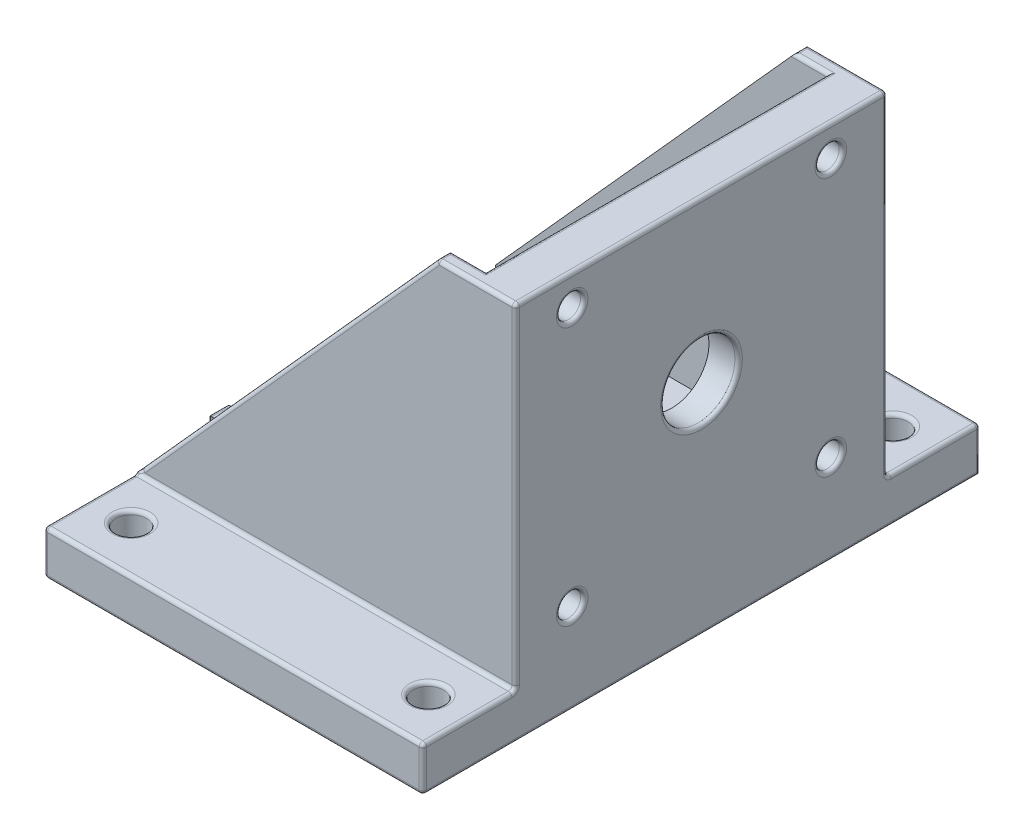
ISO-10303-21;
HEADER;
FILE_DESCRIPTION(('STEP AP214'),'2;1');
FILE_NAME('part.step','',(''),(''),'','','');
FILE_SCHEMA(('AUTOMOTIVE_DESIGN { 1 0 10303 214 1 1 1 1 }'));
ENDSEC;
DATA;
#1=APPLICATION_CONTEXT('core data for automotive mechanical design processes');
#2=APPLICATION_PROTOCOL_DEFINITION('international standard','automotive_design',2000,#1);
#3=PRODUCT_CONTEXT('',#1,'mechanical');
#4=PRODUCT('Part','Part','',(#3));
#5=PRODUCT_RELATED_PRODUCT_CATEGORY('part','',(#4));
#6=PRODUCT_DEFINITION_FORMATION('','',#4);
#7=PRODUCT_DEFINITION_CONTEXT('part definition',#1,'design');
#8=PRODUCT_DEFINITION('design','',#6,#7);
#9=PRODUCT_DEFINITION_SHAPE('','',#8);
#10=(LENGTH_UNIT() NAMED_UNIT(*) SI_UNIT(.MILLI.,.METRE.));
#11=(NAMED_UNIT(*) PLANE_ANGLE_UNIT() SI_UNIT($,.RADIAN.));
#12=(NAMED_UNIT(*) SI_UNIT($,.STERADIAN.) SOLID_ANGLE_UNIT());
#13=UNCERTAINTY_MEASURE_WITH_UNIT(LENGTH_MEASURE(1.E-05),#10,'distance_accuracy_value','');
#14=(GEOMETRIC_REPRESENTATION_CONTEXT(3) GLOBAL_UNCERTAINTY_ASSIGNED_CONTEXT((#13)) GLOBAL_UNIT_ASSIGNED_CONTEXT((#10,
#11,#12)) REPRESENTATION_CONTEXT('',''));
#15=CARTESIAN_POINT('',(0.,0.,0.));
#16=DIRECTION('',(0.,0.,1.));
#17=DIRECTION('',(1.,0.,0.));
#18=AXIS2_PLACEMENT_3D('',#15,#16,#17);
#19=CARTESIAN_POINT('',(0.,0.,0.));
#20=DIRECTION('',(1.,0.,0.));
#21=DIRECTION('',(0.,0.,-1.));
#22=AXIS2_PLACEMENT_3D('',#19,#20,#21);
#23=PLANE('',#22);
#24=CARTESIAN_POINT('',(0.,91.8000005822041,84.7999990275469));
#25=DIRECTION('',(1.,0.,0.));
#26=DIRECTION('',(0.,0.,-1.));
#27=AXIS2_PLACEMENT_3D('',#24,#25,#26);
#28=CIRCLE('',#27,3.2499986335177);
#29=CARTESIAN_POINT('',(0.,91.8000005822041,81.5500003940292));
#30=VERTEX_POINT('',#29);
#31=EDGE_CURVE('E584',#30,#30,#28,.T.);
#32=ORIENTED_EDGE('',*,*,#31,.T.);
#33=EDGE_LOOP('',(#32));
#34=FACE_BOUND('',#33,.T.);
#35=CARTESIAN_POINT('',(0.,91.7999975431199,15.20000165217));
#36=DIRECTION('',(1.,0.,0.));
#37=DIRECTION('',(0.,0.,-1.));
#38=AXIS2_PLACEMENT_3D('',#35,#36,#37);
#39=CIRCLE('',#38,3.25000278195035);
#40=CARTESIAN_POINT('',(0.,91.7999975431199,11.9499988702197));
#41=VERTEX_POINT('',#40);
#42=EDGE_CURVE('E581',#41,#41,#39,.T.);
#43=ORIENTED_EDGE('',*,*,#42,.T.);
#44=EDGE_LOOP('',(#43));
#45=FACE_BOUND('',#44,.T.);
#46=CARTESIAN_POINT('',(0.,22.2000021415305,15.1999995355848));
#47=DIRECTION('',(1.,0.,0.));
#48=DIRECTION('',(0.,0.,-1.));
#49=AXIS2_PLACEMENT_3D('',#46,#47,#48);
#50=CIRCLE('',#49,3.24999979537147);
#51=CARTESIAN_POINT('',(0.,22.2000021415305,11.9499997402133));
#52=VERTEX_POINT('',#51);
#53=EDGE_CURVE('E578',#52,#52,#50,.T.);
#54=ORIENTED_EDGE('',*,*,#53,.T.);
#55=EDGE_LOOP('',(#54));
#56=FACE_BOUND('',#55,.T.);
#57=CARTESIAN_POINT('',(0.,22.199999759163,84.800000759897));
#58=DIRECTION('',(1.,0.,0.));
#59=DIRECTION('',(0.,0.,-1.));
#60=AXIS2_PLACEMENT_3D('',#57,#58,#59);
#61=CIRCLE('',#60,3.249999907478);
#62=CARTESIAN_POINT('',(0.,22.199999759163,81.550000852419));
#63=VERTEX_POINT('',#62);
#64=EDGE_CURVE('E575',#63,#63,#61,.T.);
#65=ORIENTED_EDGE('',*,*,#64,.T.);
#66=EDGE_LOOP('',(#65));
#67=FACE_BOUND('',#66,.T.);
#68=CARTESIAN_POINT('',(0.,57.0000005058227,50.0000030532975));
#69=DIRECTION('',(-1.,0.,0.));
#70=DIRECTION('',(0.,0.,1.));
#71=AXIS2_PLACEMENT_3D('',#68,#69,#70);
#72=CIRCLE('',#71,41.);
#73=CARTESIAN_POINT('',(0.,57.0000005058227,91.0000030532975));
#74=VERTEX_POINT('',#73);
#75=EDGE_CURVE('E507',#74,#74,#72,.T.);
#76=ORIENTED_EDGE('',*,*,#75,.F.);
#77=EDGE_LOOP('',(#76));
#78=FACE_BOUND('',#77,.T.);
#79=DIRECTION('',(0.,-1.,0.));
#80=VECTOR('',#79,1.);
#81=CARTESIAN_POINT('',(0.,0.,96.));
#82=LINE('',#81,#80);
#83=CARTESIAN_POINT('',(0.,98.9999975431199,96.));
#84=VERTEX_POINT('',#83);
#85=CARTESIAN_POINT('',(0.,8.00000000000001,96.));
#86=VERTEX_POINT('',#85);
#87=EDGE_CURVE('E572',#84,#86,#82,.T.);
#88=ORIENTED_EDGE('',*,*,#87,.F.);
#89=DIRECTION('',(0.,0.,1.));
#90=VECTOR('',#89,1.);
#91=CARTESIAN_POINT('',(0.,98.9999975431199,4.));
#92=LINE('',#91,#90);
#93=CARTESIAN_POINT('',(0.,98.9999975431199,4.));
#94=VERTEX_POINT('',#93);
#95=EDGE_CURVE('E446',#84,#94,#92,.F.);
#96=ORIENTED_EDGE('',*,*,#95,.T.);
#97=DIRECTION('',(0.,-1.,0.));
#98=VECTOR('',#97,1.);
#99=CARTESIAN_POINT('',(0.,0.,4.));
#100=LINE('',#99,#98);
#101=CARTESIAN_POINT('',(0.,8.,4.));
#102=VERTEX_POINT('',#101);
#103=EDGE_CURVE('E439',#94,#102,#100,.T.);
#104=ORIENTED_EDGE('',*,*,#103,.T.);
#105=DIRECTION('',(0.,0.,-1.));
#106=VECTOR('',#105,1.);
#107=CARTESIAN_POINT('',(0.,8.,4.));
#108=LINE('',#107,#106);
#109=CARTESIAN_POINT('',(0.,8.00000000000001,20.));
#110=VERTEX_POINT('',#109);
#111=EDGE_CURVE('E444',#110,#102,#108,.T.);
#112=ORIENTED_EDGE('',*,*,#111,.F.);
#113=DIRECTION('',(0.,-1.,0.));
#114=VECTOR('',#113,1.);
#115=CARTESIAN_POINT('',(0.,13.9,20.));
#116=LINE('',#115,#114);
#117=CARTESIAN_POINT('',(0.,13.9,20.));
#118=VERTEX_POINT('',#117);
#119=EDGE_CURVE('E563',#118,#110,#116,.T.);
#120=ORIENTED_EDGE('',*,*,#119,.F.);
#121=DIRECTION('',(0.,0.,-1.));
#122=VECTOR('',#121,1.);
#123=CARTESIAN_POINT('',(0.,13.9,20.));
#124=LINE('',#123,#122);
#125=CARTESIAN_POINT('',(0.,13.9,25.));
#126=VERTEX_POINT('',#125);
#127=EDGE_CURVE('E553',#126,#118,#124,.T.);
#128=ORIENTED_EDGE('',*,*,#127,.F.);
#129=DIRECTION('',(0.,-1.,0.));
#130=VECTOR('',#129,1.);
#131=CARTESIAN_POINT('',(0.,13.9,25.));
#132=LINE('',#131,#130);
#133=CARTESIAN_POINT('',(0.,8.00000000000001,25.));
#134=VERTEX_POINT('',#133);
#135=EDGE_CURVE('E561',#126,#134,#132,.T.);
#136=ORIENTED_EDGE('',*,*,#135,.T.);
#137=DIRECTION('',(0.,0.,-1.));
#138=VECTOR('',#137,1.);
#139=CARTESIAN_POINT('',(0.,8.00000000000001,25.));
#140=LINE('',#139,#138);
#141=CARTESIAN_POINT('',(0.,8.00000000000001,38.6));
#142=VERTEX_POINT('',#141);
#143=EDGE_CURVE('E475',#142,#134,#140,.T.);
#144=ORIENTED_EDGE('',*,*,#143,.F.);
#145=DIRECTION('',(0.,-1.,0.));
#146=VECTOR('',#145,1.);
#147=CARTESIAN_POINT('',(0.,13.9,38.6));
#148=LINE('',#147,#146);
#149=CARTESIAN_POINT('',(0.,13.9,38.6));
#150=VERTEX_POINT('',#149);
#151=EDGE_CURVE('E550',#150,#142,#148,.T.);
#152=ORIENTED_EDGE('',*,*,#151,.F.);
#153=DIRECTION('',(0.,0.,-1.));
#154=VECTOR('',#153,1.);
#155=CARTESIAN_POINT('',(0.,13.9,38.6));
#156=LINE('',#155,#154);
#157=CARTESIAN_POINT('',(0.,13.9,43.6));
#158=VERTEX_POINT('',#157);
#159=EDGE_CURVE('E540',#158,#150,#156,.T.);
#160=ORIENTED_EDGE('',*,*,#159,.F.);
#161=DIRECTION('',(0.,-1.,0.));
#162=VECTOR('',#161,1.);
#163=CARTESIAN_POINT('',(0.,13.9,43.6));
#164=LINE('',#163,#162);
#165=CARTESIAN_POINT('',(0.,8.00000000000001,43.6));
#166=VERTEX_POINT('',#165);
#167=EDGE_CURVE('E548',#158,#166,#164,.T.);
#168=ORIENTED_EDGE('',*,*,#167,.T.);
#169=DIRECTION('',(0.,0.,-1.));
#170=VECTOR('',#169,1.);
#171=CARTESIAN_POINT('',(0.,8.00000000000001,43.6));
#172=LINE('',#171,#170);
#173=CARTESIAN_POINT('',(0.,8.00000000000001,57.2));
#174=VERTEX_POINT('',#173);
#175=EDGE_CURVE('E481',#174,#166,#172,.T.);
#176=ORIENTED_EDGE('',*,*,#175,.F.);
#177=DIRECTION('',(0.,-1.,0.));
#178=VECTOR('',#177,1.);
#179=CARTESIAN_POINT('',(0.,13.9,57.2));
#180=LINE('',#179,#178);
#181=CARTESIAN_POINT('',(0.,13.9,57.2));
#182=VERTEX_POINT('',#181);
#183=EDGE_CURVE('E537',#182,#174,#180,.T.);
#184=ORIENTED_EDGE('',*,*,#183,.F.);
#185=DIRECTION('',(0.,0.,-1.));
#186=VECTOR('',#185,1.);
#187=CARTESIAN_POINT('',(0.,13.9,57.2));
#188=LINE('',#187,#186);
#189=CARTESIAN_POINT('',(0.,13.9,62.2));
#190=VERTEX_POINT('',#189);
#191=EDGE_CURVE('E527',#190,#182,#188,.T.);
#192=ORIENTED_EDGE('',*,*,#191,.F.);
#193=DIRECTION('',(0.,-1.,0.));
#194=VECTOR('',#193,1.);
#195=CARTESIAN_POINT('',(0.,13.9,62.2));
#196=LINE('',#195,#194);
#197=CARTESIAN_POINT('',(0.,8.00000000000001,62.2));
#198=VERTEX_POINT('',#197);
#199=EDGE_CURVE('E535',#190,#198,#196,.T.);
#200=ORIENTED_EDGE('',*,*,#199,.T.);
#201=DIRECTION('',(0.,0.,-1.));
#202=VECTOR('',#201,1.);
#203=CARTESIAN_POINT('',(0.,8.00000000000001,62.2));
#204=LINE('',#203,#202);
#205=CARTESIAN_POINT('',(0.,8.00000000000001,75.8));
#206=VERTEX_POINT('',#205);
#207=EDGE_CURVE('E490',#206,#198,#204,.T.);
#208=ORIENTED_EDGE('',*,*,#207,.F.);
#209=DIRECTION('',(0.,-1.,0.));
#210=VECTOR('',#209,1.);
#211=CARTESIAN_POINT('',(0.,13.9,75.8));
#212=LINE('',#211,#210);
#213=CARTESIAN_POINT('',(0.,13.9,75.8));
#214=VERTEX_POINT('',#213);
#215=EDGE_CURVE('E524',#214,#206,#212,.T.);
#216=ORIENTED_EDGE('',*,*,#215,.F.);
#217=DIRECTION('',(0.,0.,-1.));
#218=VECTOR('',#217,1.);
#219=CARTESIAN_POINT('',(0.,13.9,75.8));
#220=LINE('',#219,#218);
#221=CARTESIAN_POINT('',(0.,13.9,80.8));
#222=VERTEX_POINT('',#221);
#223=EDGE_CURVE('E514',#222,#214,#220,.T.);
#224=ORIENTED_EDGE('',*,*,#223,.F.);
#225=DIRECTION('',(0.,-1.,0.));
#226=VECTOR('',#225,1.);
#227=CARTESIAN_POINT('',(0.,13.9,80.8));
#228=LINE('',#227,#226);
#229=CARTESIAN_POINT('',(0.,8.00000000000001,80.8));
#230=VERTEX_POINT('',#229);
#231=EDGE_CURVE('E522',#222,#230,#228,.T.);
#232=ORIENTED_EDGE('',*,*,#231,.T.);
#233=DIRECTION('',(0.,0.,-1.));
#234=VECTOR('',#233,1.);
#235=CARTESIAN_POINT('',(0.,8.00000000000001,96.));
#236=LINE('',#235,#234);
#237=EDGE_CURVE('E498',#86,#230,#236,.T.);
#238=ORIENTED_EDGE('',*,*,#237,.F.);
#239=EDGE_LOOP('',(#88,#96,#104,#112,#120,#128,#136,#144,#152,#160,#168,#176,#184,#192,#200,
#208,#216,#224,#232,#238));
#240=FACE_BOUND('',#239,.T.);
#241=ADVANCED_FACE('F40',(#34,#45,#56,#67,#78,#240),#23,.F.);
#242=CARTESIAN_POINT('',(12.,0.,0.));
#243=DIRECTION('',(1.,0.,0.));
#244=DIRECTION('',(0.,0.,-1.));
#245=AXIS2_PLACEMENT_3D('',#242,#243,#244);
#246=PLANE('',#245);
#247=CARTESIAN_POINT('',(12.,22.199999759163,84.800000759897));
#248=DIRECTION('',(1.,0.,0.));
#249=DIRECTION('',(0.,0.,-1.));
#250=AXIS2_PLACEMENT_3D('',#247,#248,#249);
#251=CIRCLE('',#250,4.249999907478);
#252=CARTESIAN_POINT('',(12.,22.199999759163,80.550000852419));
#253=VERTEX_POINT('',#252);
#254=EDGE_CURVE('E1246',#253,#253,#251,.F.);
#255=ORIENTED_EDGE('',*,*,#254,.T.);
#256=EDGE_LOOP('',(#255));
#257=FACE_BOUND('',#256,.T.);
#258=CARTESIAN_POINT('',(12.,91.7999975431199,15.20000165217));
#259=DIRECTION('',(1.,0.,0.));
#260=DIRECTION('',(0.,0.,-1.));
#261=AXIS2_PLACEMENT_3D('',#258,#259,#260);
#262=CIRCLE('',#261,4.25000278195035);
#263=CARTESIAN_POINT('',(12.,91.7999975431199,10.9499988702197));
#264=VERTEX_POINT('',#263);
#265=EDGE_CURVE('E1243',#264,#264,#262,.F.);
#266=ORIENTED_EDGE('',*,*,#265,.T.);
#267=EDGE_LOOP('',(#266));
#268=FACE_BOUND('',#267,.T.);
#269=CARTESIAN_POINT('',(12.,57.0000005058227,50.0000030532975));
#270=DIRECTION('',(1.,0.,0.));
#271=DIRECTION('',(0.,0.,-1.));
#272=AXIS2_PLACEMENT_3D('',#269,#270,#271);
#273=CIRCLE('',#272,11.);
#274=CARTESIAN_POINT('',(12.,57.0000005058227,39.0000030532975));
#275=VERTEX_POINT('',#274);
#276=EDGE_CURVE('E1240',#275,#275,#273,.F.);
#277=ORIENTED_EDGE('',*,*,#276,.T.);
#278=EDGE_LOOP('',(#277));
#279=FACE_BOUND('',#278,.T.);
#280=CARTESIAN_POINT('',(12.,91.8000005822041,84.7999990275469));
#281=DIRECTION('',(1.,0.,0.));
#282=DIRECTION('',(0.,0.,-1.));
#283=AXIS2_PLACEMENT_3D('',#280,#281,#282);
#284=CIRCLE('',#283,4.2499986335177);
#285=CARTESIAN_POINT('',(12.,91.8000005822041,80.5500003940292));
#286=VERTEX_POINT('',#285);
#287=EDGE_CURVE('E1237',#286,#286,#284,.F.);
#288=ORIENTED_EDGE('',*,*,#287,.T.);
#289=EDGE_LOOP('',(#288));
#290=FACE_BOUND('',#289,.T.);
#291=CARTESIAN_POINT('',(12.,22.2000021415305,15.1999995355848));
#292=DIRECTION('',(1.,0.,0.));
#293=DIRECTION('',(0.,0.,-1.));
#294=AXIS2_PLACEMENT_3D('',#291,#292,#293);
#295=CIRCLE('',#294,4.24999979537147);
#296=CARTESIAN_POINT('',(12.,22.2000021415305,10.9499997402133));
#297=VERTEX_POINT('',#296);
#298=EDGE_CURVE('E1234',#297,#297,#295,.F.);
#299=ORIENTED_EDGE('',*,*,#298,.T.);
#300=EDGE_LOOP('',(#299));
#301=FACE_BOUND('',#300,.T.);
#302=CARTESIAN_POINT('',(12.,11.,101.));
#303=DIRECTION('',(1.,0.,0.));
#304=DIRECTION('',(0.,0.,-1.));
#305=AXIS2_PLACEMENT_3D('',#302,#303,#304);
#306=CIRCLE('',#305,2.);
#307=CARTESIAN_POINT('',(12.,9.00000000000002,101.));
#308=VERTEX_POINT('',#307);
#309=CARTESIAN_POINT('',(12.,11.,99.));
#310=VERTEX_POINT('',#309);
#311=EDGE_CURVE('E1227',#308,#310,#306,.T.);
#312=ORIENTED_EDGE('',*,*,#311,.F.);
#313=DIRECTION('',(0.,0.,-1.));
#314=VECTOR('',#313,1.);
#315=CARTESIAN_POINT('',(12.,9.,0.));
#316=LINE('',#315,#314);
#317=CARTESIAN_POINT('',(12.,9.00000000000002,124.));
#318=VERTEX_POINT('',#317);
#319=EDGE_CURVE('E1232',#308,#318,#316,.F.);
#320=ORIENTED_EDGE('',*,*,#319,.T.);
#321=DIRECTION('',(0.,1.,0.));
#322=VECTOR('',#321,1.);
#323=CARTESIAN_POINT('',(12.,0.,124.));
#324=LINE('',#323,#322);
#325=CARTESIAN_POINT('',(12.,-1.,124.));
#326=VERTEX_POINT('',#325);
#327=EDGE_CURVE('E1230',#318,#326,#324,.F.);
#328=ORIENTED_EDGE('',*,*,#327,.T.);
#329=DIRECTION('',(0.,0.,1.));
#330=VECTOR('',#329,1.);
#331=CARTESIAN_POINT('',(12.,-1.,-25.));
#332=LINE('',#331,#330);
#333=CARTESIAN_POINT('',(12.,-1.,-24.));
#334=VERTEX_POINT('',#333);
#335=EDGE_CURVE('E1225',#326,#334,#332,.F.);
#336=ORIENTED_EDGE('',*,*,#335,.T.);
#337=DIRECTION('',(0.,-1.,0.));
#338=VECTOR('',#337,1.);
#339=CARTESIAN_POINT('',(12.,0.,-24.));
#340=LINE('',#339,#338);
#341=CARTESIAN_POINT('',(12.,9.,-24.));
#342=VERTEX_POINT('',#341);
#343=EDGE_CURVE('E1220',#334,#342,#340,.F.);
#344=ORIENTED_EDGE('',*,*,#343,.T.);
#345=DIRECTION('',(0.,0.,-1.));
#346=VECTOR('',#345,1.);
#347=CARTESIAN_POINT('',(12.,9.,0.));
#348=LINE('',#347,#346);
#349=CARTESIAN_POINT('',(12.,9.,-1.));
#350=VERTEX_POINT('',#349);
#351=EDGE_CURVE('E1214',#342,#350,#348,.F.);
#352=ORIENTED_EDGE('',*,*,#351,.T.);
#353=CARTESIAN_POINT('',(12.,11.,-1.));
#354=DIRECTION('',(1.,0.,0.));
#355=DIRECTION('',(0.,0.,-1.));
#356=AXIS2_PLACEMENT_3D('',#353,#354,#355);
#357=CIRCLE('',#356,2.);
#358=CARTESIAN_POINT('',(12.,11.,1.));
#359=VERTEX_POINT('',#358);
#360=EDGE_CURVE('E1211',#359,#350,#357,.T.);
#361=ORIENTED_EDGE('',*,*,#360,.F.);
#362=DIRECTION('',(0.,1.,0.));
#363=VECTOR('',#362,1.);
#364=CARTESIAN_POINT('',(12.,99.9999975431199,1.));
#365=LINE('',#364,#363);
#366=CARTESIAN_POINT('',(12.,98.9999975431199,1.));
#367=VERTEX_POINT('',#366);
#368=EDGE_CURVE('E1216',#359,#367,#365,.T.);
#369=ORIENTED_EDGE('',*,*,#368,.T.);
#370=DIRECTION('',(0.,0.,1.));
#371=VECTOR('',#370,1.);
#372=CARTESIAN_POINT('',(12.,98.9999975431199,0.));
#373=LINE('',#372,#371);
#374=CARTESIAN_POINT('',(12.,98.9999975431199,99.));
#375=VERTEX_POINT('',#374);
#376=EDGE_CURVE('E1218',#367,#375,#373,.T.);
#377=ORIENTED_EDGE('',*,*,#376,.T.);
#378=DIRECTION('',(0.,-1.,0.));
#379=VECTOR('',#378,1.);
#380=CARTESIAN_POINT('',(12.,10.,99.));
#381=LINE('',#380,#379);
#382=EDGE_CURVE('E1223',#375,#310,#381,.T.);
#383=ORIENTED_EDGE('',*,*,#382,.T.);
#384=EDGE_LOOP('',(#312,#320,#328,#336,#344,#352,#361,#369,#377,#383));
#385=FACE_BOUND('',#384,.T.);
#386=ADVANCED_FACE('F974',(#257,#268,#279,#290,#301,#385),#246,.T.);
#387=CARTESIAN_POINT('',(12.,0.,0.));
#388=DIRECTION('',(0.,0.,1.));
#389=DIRECTION('',(1.,0.,0.));
#390=AXIS2_PLACEMENT_3D('',#387,#388,#389);
#391=PLANE('',#390);
#392=DIRECTION('',(0.66896473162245,0.743294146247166,0.));
#393=VECTOR('',#392,1.);
#394=CARTESIAN_POINT('',(0.,110.,0.));
#395=LINE('',#394,#393);
#396=CARTESIAN_POINT('',(-89.0526143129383,11.0526507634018,0.));
#397=VERTEX_POINT('',#396);
#398=CARTESIAN_POINT('',(-9.90000221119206,98.9999975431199,0.));
#399=VERTEX_POINT('',#398);
#400=EDGE_CURVE('E565',#397,#399,#395,.T.);
#401=ORIENTED_EDGE('',*,*,#400,.T.);
#402=DIRECTION('',(-1.,0.,0.));
#403=VECTOR('',#402,1.);
#404=CARTESIAN_POINT('',(12.,98.9999975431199,0.));
#405=LINE('',#404,#403);
#406=CARTESIAN_POINT('',(11.,98.9999975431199,0.));
#407=VERTEX_POINT('',#406);
#408=EDGE_CURVE('E666',#399,#407,#405,.F.);
#409=ORIENTED_EDGE('',*,*,#408,.T.);
#410=DIRECTION('',(0.,1.,0.));
#411=VECTOR('',#410,1.);
#412=CARTESIAN_POINT('',(11.,10.,0.));
#413=LINE('',#412,#411);
#414=CARTESIAN_POINT('',(11.,11.,0.));
#415=VERTEX_POINT('',#414);
#416=EDGE_CURVE('E667',#407,#415,#413,.F.);
#417=ORIENTED_EDGE('',*,*,#416,.T.);
#418=DIRECTION('',(-1.,0.,0.));
#419=VECTOR('',#418,1.);
#420=CARTESIAN_POINT('',(12.,11.,0.));
#421=LINE('',#420,#419);
#422=CARTESIAN_POINT('',(-89.,11.,0.));
#423=VERTEX_POINT('',#422);
#424=EDGE_CURVE('E1790',#415,#423,#421,.T.);
#425=ORIENTED_EDGE('',*,*,#424,.T.);
#426=CARTESIAN_POINT('',(-89.0526143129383,11.0526507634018,0.));
#427=CARTESIAN_POINT('',(-89.0365724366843,11.0365857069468,0.));
#428=CARTESIAN_POINT('',(-89.0205250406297,11.0205261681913,0.));
#429=CARTESIAN_POINT('',(-89.0029814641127,11.0029813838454,0.));
#430=CARTESIAN_POINT('',(-89.0014907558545,11.0014906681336,0.));
#431=CARTESIAN_POINT('',(-89.,11.,0.));
#432=B_SPLINE_CURVE_WITH_KNOTS('',3,(#426,#427,#428,#429,#430,#431),.UNSPECIFIED.,.F.,.F.,(4,2,
4),(0.,0.0681090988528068,0.0744336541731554),.UNSPECIFIED.);
#433=EDGE_CURVE('E658',#423,#397,#432,.F.);
#434=ORIENTED_EDGE('',*,*,#433,.T.);
#435=EDGE_LOOP('',(#401,#409,#417,#425,#434));
#436=FACE_BOUND('',#435,.T.);
#437=ADVANCED_FACE('F980',(#436),#391,.F.);
#438=CARTESIAN_POINT('',(12.,0.,100.));
#439=DIRECTION('',(0.,0.,-1.));
#440=DIRECTION('',(-1.,0.,0.));
#441=AXIS2_PLACEMENT_3D('',#438,#439,#440);
#442=PLANE('',#441);
#443=DIRECTION('',(0.,-1.,0.));
#444=VECTOR('',#443,1.);
#445=CARTESIAN_POINT('',(11.,99.9999975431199,100.));
#446=LINE('',#445,#444);
#447=CARTESIAN_POINT('',(11.,11.,100.));
#448=VERTEX_POINT('',#447);
#449=CARTESIAN_POINT('',(11.,98.9999975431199,100.));
#450=VERTEX_POINT('',#449);
#451=EDGE_CURVE('E1268',#448,#450,#446,.F.);
#452=ORIENTED_EDGE('',*,*,#451,.T.);
#453=DIRECTION('',(1.,0.,0.));
#454=VECTOR('',#453,1.);
#455=CARTESIAN_POINT('',(-9.00000221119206,98.9999975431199,100.));
#456=LINE('',#455,#454);
#457=CARTESIAN_POINT('',(-8.55463980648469,98.9999975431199,100.));
#458=VERTEX_POINT('',#457);
#459=EDGE_CURVE('E1271',#450,#458,#456,.F.);
#460=ORIENTED_EDGE('',*,*,#459,.T.);
#461=DIRECTION('',(-0.66896473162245,-0.743294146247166,0.));
#462=VECTOR('',#461,1.);
#463=CARTESIAN_POINT('',(-89.2567058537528,9.33103526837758,100.));
#464=LINE('',#463,#462);
#465=CARTESIAN_POINT('',(-87.7546375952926,11.,100.));
#466=VERTEX_POINT('',#465);
#467=EDGE_CURVE('E1266',#458,#466,#464,.T.);
#468=ORIENTED_EDGE('',*,*,#467,.T.);
#469=DIRECTION('',(1.,0.,0.));
#470=VECTOR('',#469,1.);
#471=CARTESIAN_POINT('',(12.,11.,100.));
#472=LINE('',#471,#470);
#473=EDGE_CURVE('E1264',#466,#448,#472,.T.);
#474=ORIENTED_EDGE('',*,*,#473,.T.);
#475=EDGE_LOOP('',(#452,#460,#468,#474));
#476=FACE_BOUND('',#475,.T.);
#477=ADVANCED_FACE('F707',(#476),#442,.F.);
#478=CARTESIAN_POINT('',(0.,0.,96.));
#479=DIRECTION('',(0.,0.,1.));
#480=DIRECTION('',(1.,0.,0.));
#481=AXIS2_PLACEMENT_3D('',#478,#479,#480);
#482=PLANE('',#481);
#483=DIRECTION('',(-0.66896473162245,-0.743294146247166,0.));
#484=VECTOR('',#483,1.);
#485=CARTESIAN_POINT('',(0.,110.,96.));
#486=LINE('',#485,#484);
#487=CARTESIAN_POINT('',(-9.90000221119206,98.9999975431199,96.));
#488=VERTEX_POINT('',#487);
#489=CARTESIAN_POINT('',(-89.,11.1111111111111,96.));
#490=VERTEX_POINT('',#489);
#491=EDGE_CURVE('E449',#488,#490,#486,.T.);
#492=ORIENTED_EDGE('',*,*,#491,.F.);
#493=DIRECTION('',(-1.,0.,0.));
#494=VECTOR('',#493,1.);
#495=CARTESIAN_POINT('',(0.,98.9999975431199,96.));
#496=LINE('',#495,#494);
#497=EDGE_CURVE('E1379',#488,#84,#496,.F.);
#498=ORIENTED_EDGE('',*,*,#497,.T.);
#499=ORIENTED_EDGE('',*,*,#87,.T.);
#500=DIRECTION('',(1.,0.,0.));
#501=VECTOR('',#500,1.);
#502=CARTESIAN_POINT('',(0.,8.00000000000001,96.));
#503=LINE('',#502,#501);
#504=CARTESIAN_POINT('',(-89.,8.00000000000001,96.));
#505=VERTEX_POINT('',#504);
#506=EDGE_CURVE('E494',#505,#86,#503,.T.);
#507=ORIENTED_EDGE('',*,*,#506,.F.);
#508=DIRECTION('',(0.,1.,0.));
#509=VECTOR('',#508,1.);
#510=CARTESIAN_POINT('',(-89.,10.,96.));
#511=LINE('',#510,#509);
#512=EDGE_CURVE('E1377',#505,#490,#511,.T.);
#513=ORIENTED_EDGE('',*,*,#512,.T.);
#514=EDGE_LOOP('',(#492,#498,#499,#507,#513));
#515=FACE_BOUND('',#514,.T.);
#516=ADVANCED_FACE('F703',(#515),#482,.F.);
#517=CARTESIAN_POINT('',(0.,110.,96.));
#518=DIRECTION('',(-0.743294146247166,0.66896473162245,0.));
#519=DIRECTION('',(-0.66896473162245,-0.743294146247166,0.));
#520=AXIS2_PLACEMENT_3D('',#517,#518,#519);
#521=PLANE('',#520);
#522=DIRECTION('',(0.,0.,-1.));
#523=VECTOR('',#522,1.);
#524=CARTESIAN_POINT('',(-9.29793395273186,99.6689622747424,96.));
#525=LINE('',#524,#523);
#526=CARTESIAN_POINT('',(-9.29793395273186,99.6689622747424,99.));
#527=VERTEX_POINT('',#526);
#528=CARTESIAN_POINT('',(-9.29793395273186,99.6689622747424,96.2567058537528));
#529=VERTEX_POINT('',#528);
#530=EDGE_CURVE('E1356',#527,#529,#525,.T.);
#531=ORIENTED_EDGE('',*,*,#530,.T.);
#532=CARTESIAN_POINT('',(-9.90000221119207,98.9999975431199,97.));
#533=DIRECTION('',(-0.743294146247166,0.66896473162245,0.));
#534=DIRECTION('',(0.66896473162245,0.743294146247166,0.));
#535=AXIS2_PLACEMENT_3D('',#532,#533,#534);
#536=ELLIPSE('',#535,1.34536240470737,1.);
#537=EDGE_CURVE('E1358',#529,#488,#536,.T.);
#538=ORIENTED_EDGE('',*,*,#537,.T.);
#539=ORIENTED_EDGE('',*,*,#491,.T.);
#540=CARTESIAN_POINT('',(-89.,11.1111111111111,97.));
#541=DIRECTION('',(-0.743294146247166,0.66896473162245,0.));
#542=DIRECTION('',(-0.66896473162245,-0.743294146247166,0.));
#543=AXIS2_PLACEMENT_3D('',#540,#541,#542);
#544=ELLIPSE('',#543,1.49484711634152,1.);
#545=CARTESIAN_POINT('',(-89.7432941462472,10.285228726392,96.3310352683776));
#546=VERTEX_POINT('',#545);
#547=EDGE_CURVE('E1352',#490,#546,#544,.T.);
#548=ORIENTED_EDGE('',*,*,#547,.T.);
#549=DIRECTION('',(0.,0.,1.));
#550=VECTOR('',#549,1.);
#551=CARTESIAN_POINT('',(-89.7432941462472,10.285228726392,96.));
#552=LINE('',#551,#550);
#553=CARTESIAN_POINT('',(-89.7432941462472,10.285228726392,99.5559519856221));
#554=VERTEX_POINT('',#553);
#555=EDGE_CURVE('E1351',#546,#554,#552,.T.);
#556=ORIENTED_EDGE('',*,*,#555,.T.);
#557=CARTESIAN_POINT('',(-88.4979317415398,11.6689647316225,101.));
#558=DIRECTION('',(-0.743294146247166,0.66896473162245,0.));
#559=DIRECTION('',(0.66896473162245,0.743294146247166,0.));
#560=AXIS2_PLACEMENT_3D('',#557,#558,#559);
#561=ELLIPSE('',#560,2.69072480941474,2.);
#562=CARTESIAN_POINT('',(-88.4979317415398,11.6689647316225,99.));
#563=VERTEX_POINT('',#562);
#564=EDGE_CURVE('E1350',#554,#563,#561,.F.);
#565=ORIENTED_EDGE('',*,*,#564,.T.);
#566=DIRECTION('',(-0.66896473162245,-0.743294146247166,0.));
#567=VECTOR('',#566,1.);
#568=CARTESIAN_POINT('',(-9.00000221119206,99.9999975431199,99.));
#569=LINE('',#568,#567);
#570=EDGE_CURVE('E627',#563,#527,#569,.F.);
#571=ORIENTED_EDGE('',*,*,#570,.T.);
#572=EDGE_LOOP('',(#531,#538,#539,#548,#556,#565,#571));
#573=FACE_BOUND('',#572,.T.);
#574=ADVANCED_FACE('F706',(#573),#521,.T.);
#575=CARTESIAN_POINT('',(0.,0.,4.));
#576=DIRECTION('',(0.,0.,1.));
#577=DIRECTION('',(1.,0.,0.));
#578=AXIS2_PLACEMENT_3D('',#575,#576,#577);
#579=PLANE('',#578);
#580=ORIENTED_EDGE('',*,*,#103,.F.);
#581=DIRECTION('',(-1.,0.,0.));
#582=VECTOR('',#581,1.);
#583=CARTESIAN_POINT('',(0.,98.9999975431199,4.));
#584=LINE('',#583,#582);
#585=CARTESIAN_POINT('',(-9.90000221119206,98.9999975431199,4.));
#586=VERTEX_POINT('',#585);
#587=EDGE_CURVE('E1383',#94,#586,#584,.T.);
#588=ORIENTED_EDGE('',*,*,#587,.T.);
#589=DIRECTION('',(0.66896473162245,0.743294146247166,0.));
#590=VECTOR('',#589,1.);
#591=CARTESIAN_POINT('',(0.,110.,4.));
#592=LINE('',#591,#590);
#593=CARTESIAN_POINT('',(-89.,11.1111111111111,4.));
#594=VERTEX_POINT('',#593);
#595=EDGE_CURVE('E450',#594,#586,#592,.T.);
#596=ORIENTED_EDGE('',*,*,#595,.F.);
#597=DIRECTION('',(0.,1.,0.));
#598=VECTOR('',#597,1.);
#599=CARTESIAN_POINT('',(-89.,0.,4.));
#600=LINE('',#599,#598);
#601=CARTESIAN_POINT('',(-89.,8.,4.));
#602=VERTEX_POINT('',#601);
#603=EDGE_CURVE('E457',#594,#602,#600,.F.);
#604=ORIENTED_EDGE('',*,*,#603,.T.);
#605=DIRECTION('',(-1.,0.,0.));
#606=VECTOR('',#605,1.);
#607=CARTESIAN_POINT('',(0.,8.,4.));
#608=LINE('',#607,#606);
#609=EDGE_CURVE('E453',#102,#602,#608,.T.);
#610=ORIENTED_EDGE('',*,*,#609,.F.);
#611=EDGE_LOOP('',(#580,#588,#596,#604,#610));
#612=FACE_BOUND('',#611,.T.);
#613=ADVANCED_FACE('F454',(#612),#579,.T.);
#614=CARTESIAN_POINT('',(0.,110.,4.));
#615=DIRECTION('',(-0.743294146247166,0.66896473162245,0.));
#616=DIRECTION('',(-0.66896473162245,-0.743294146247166,0.));
#617=AXIS2_PLACEMENT_3D('',#614,#615,#616);
#618=PLANE('',#617);
#619=ORIENTED_EDGE('',*,*,#595,.T.);
#620=CARTESIAN_POINT('',(-9.90000221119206,98.9999975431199,3.));
#621=DIRECTION('',(-0.743294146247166,0.66896473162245,0.));
#622=DIRECTION('',(-0.66896473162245,-0.743294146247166,0.));
#623=AXIS2_PLACEMENT_3D('',#620,#621,#622);
#624=ELLIPSE('',#623,1.34536240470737,1.);
#625=CARTESIAN_POINT('',(-9.29793395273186,99.6689622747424,3.74329414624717));
#626=VERTEX_POINT('',#625);
#627=EDGE_CURVE('E1786',#586,#626,#624,.T.);
#628=ORIENTED_EDGE('',*,*,#627,.T.);
#629=DIRECTION('',(0.,0.,-1.));
#630=VECTOR('',#629,1.);
#631=CARTESIAN_POINT('',(-9.29793395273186,99.6689622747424,4.));
#632=LINE('',#631,#630);
#633=CARTESIAN_POINT('',(-9.29793395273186,99.6689622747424,0.256705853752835));
#634=VERTEX_POINT('',#633);
#635=EDGE_CURVE('E1788',#626,#634,#632,.T.);
#636=ORIENTED_EDGE('',*,*,#635,.T.);
#637=CARTESIAN_POINT('',(-9.90000221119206,98.9999975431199,1.));
#638=DIRECTION('',(-0.743294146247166,0.66896473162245,0.));
#639=DIRECTION('',(0.66896473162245,0.743294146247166,0.));
#640=AXIS2_PLACEMENT_3D('',#637,#638,#639);
#641=ELLIPSE('',#640,1.34536240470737,1.);
#642=EDGE_CURVE('E691',#634,#399,#641,.T.);
#643=ORIENTED_EDGE('',*,*,#642,.T.);
#644=ORIENTED_EDGE('',*,*,#400,.F.);
#645=CARTESIAN_POINT('',(-89.0526143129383,11.0526507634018,0.));
#646=CARTESIAN_POINT('',(-89.081573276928,11.0204741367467,0.00324424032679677));
#647=CARTESIAN_POINT('',(-89.1105474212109,10.988280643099,0.00614683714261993));
#648=CARTESIAN_POINT('',(-89.1684901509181,10.9238998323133,0.0115040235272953));
#649=CARTESIAN_POINT('',(-89.1974587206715,10.8917125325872,0.0139589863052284));
#650=CARTESIAN_POINT('',(-89.2553012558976,10.8274430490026,0.0186525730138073));
#651=CARTESIAN_POINT('',(-89.2841751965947,10.7953608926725,0.0208919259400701));
#652=CARTESIAN_POINT('',(-89.3419153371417,10.7312051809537,0.0255830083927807));
#653=CARTESIAN_POINT('',(-89.3707815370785,10.6991316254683,0.028034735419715));
#654=CARTESIAN_POINT('',(-89.4287071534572,10.634769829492,0.0337857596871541));
#655=CARTESIAN_POINT('',(-89.4577663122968,10.6024818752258,0.0370915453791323));
#656=CARTESIAN_POINT('',(-89.5157258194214,10.5380824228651,0.045451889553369));
#657=CARTESIAN_POINT('',(-89.5446263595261,10.5059707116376,0.0505032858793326));
#658=CARTESIAN_POINT('',(-89.6022672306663,10.4419252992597,0.0636933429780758));
#659=CARTESIAN_POINT('',(-89.6310064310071,10.4099928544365,0.0718444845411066));
#660=CARTESIAN_POINT('',(-89.6736062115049,10.3626597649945,0.087751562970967));
#661=CARTESIAN_POINT('',(-89.6877645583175,10.3469282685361,0.0936916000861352));
#662=CARTESIAN_POINT('',(-89.7157871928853,10.3157920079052,0.107072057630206));
#663=CARTESIAN_POINT('',(-89.7296508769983,10.3003879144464,0.114515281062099));
#664=CARTESIAN_POINT('',(-89.7432941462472,10.285228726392,0.122834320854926));
#665=B_SPLINE_CURVE_WITH_KNOTS('',3,(#645,#646,#647,#648,#649,#650,#651,#652,#653,#654,#655,
#656,#657,#658,#659,#660,#661,#662,#663,#664),.UNSPECIFIED.,.F.,.F.,(4,2,2,2,2,2,2,2,2,4),(0.,
0.13022651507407,0.260343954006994,0.390004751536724,0.519664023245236,0.650338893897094,
0.780778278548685,0.911748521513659,0.977645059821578,1.04366562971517),.UNSPECIFIED.);
#666=CARTESIAN_POINT('',(-89.7432941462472,10.285228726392,0.122834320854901));
#667=VERTEX_POINT('',#666);
#668=EDGE_CURVE('E683',#397,#667,#665,.T.);
#669=ORIENTED_EDGE('',*,*,#668,.T.);
#670=DIRECTION('',(0.,0.,-1.));
#671=VECTOR('',#670,1.);
#672=CARTESIAN_POINT('',(-89.7432941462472,10.285228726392,4.));
#673=LINE('',#672,#671);
#674=CARTESIAN_POINT('',(-89.7432941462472,10.285228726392,3.66896473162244));
#675=VERTEX_POINT('',#674);
#676=EDGE_CURVE('E692',#667,#675,#673,.F.);
#677=ORIENTED_EDGE('',*,*,#676,.T.);
#678=CARTESIAN_POINT('',(-89.,11.1111111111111,3.));
#679=DIRECTION('',(-0.743294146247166,0.66896473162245,0.));
#680=DIRECTION('',(0.66896473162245,0.743294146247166,0.));
#681=AXIS2_PLACEMENT_3D('',#678,#679,#680);
#682=ELLIPSE('',#681,1.49484711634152,1.);
#683=EDGE_CURVE('E1384',#675,#594,#682,.T.);
#684=ORIENTED_EDGE('',*,*,#683,.T.);
#685=EDGE_LOOP('',(#619,#628,#636,#643,#644,#669,#677,#684));
#686=FACE_BOUND('',#685,.T.);
#687=ADVANCED_FACE('F695',(#686),#618,.T.);
#688=CARTESIAN_POINT('',(12.,57.0000005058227,50.0000030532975));
#689=DIRECTION('',(-1.,0.,0.));
#690=DIRECTION('',(0.,0.,1.));
#691=AXIS2_PLACEMENT_3D('',#688,#689,#690);
#692=CYLINDRICAL_SURFACE('',#691,10.);
#693=CARTESIAN_POINT('',(11.,57.0000005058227,50.0000030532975));
#694=DIRECTION('',(1.,0.,0.));
#695=DIRECTION('',(0.,0.,-1.));
#696=AXIS2_PLACEMENT_3D('',#693,#694,#695);
#697=CIRCLE('',#696,10.);
#698=CARTESIAN_POINT('',(11.,57.0000005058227,40.0000030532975));
#699=VERTEX_POINT('',#698);
#700=EDGE_CURVE('E1255',#699,#699,#697,.T.);
#701=ORIENTED_EDGE('',*,*,#700,.T.);
#702=EDGE_LOOP('',(#701));
#703=FACE_BOUND('',#702,.T.);
#704=CARTESIAN_POINT('',(4.,57.0000005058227,50.0000030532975));
#705=DIRECTION('',(-1.,0.,0.));
#706=DIRECTION('',(0.,0.,1.));
#707=AXIS2_PLACEMENT_3D('',#704,#705,#706);
#708=CIRCLE('',#707,10.);
#709=CARTESIAN_POINT('',(4.,57.0000005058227,60.0000030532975));
#710=VERTEX_POINT('',#709);
#711=EDGE_CURVE('E511',#710,#710,#708,.T.);
#712=ORIENTED_EDGE('',*,*,#711,.T.);
#713=EDGE_LOOP('',(#712));
#714=FACE_BOUND('',#713,.T.);
#715=ADVANCED_FACE('F700',(#703,#714),#692,.F.);
#716=CARTESIAN_POINT('',(162.332963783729,10.,-25.));
#717=DIRECTION('',(0.,1.,0.));
#718=DIRECTION('',(0.,0.,1.));
#719=AXIS2_PLACEMENT_3D('',#716,#717,#718);
#720=PLANE('',#719);
#721=DIRECTION('',(0.,0.,-1.));
#722=VECTOR('',#721,1.);
#723=CARTESIAN_POINT('',(11.,10.,-25.));
#724=LINE('',#723,#722);
#725=CARTESIAN_POINT('',(11.,10.,-1.));
#726=VERTEX_POINT('',#725);
#727=CARTESIAN_POINT('',(11.,10.,-24.));
#728=VERTEX_POINT('',#727);
#729=EDGE_CURVE('E58',#726,#728,#724,.T.);
#730=ORIENTED_EDGE('',*,*,#729,.T.);
#731=DIRECTION('',(-1.,0.,0.));
#732=VECTOR('',#731,1.);
#733=CARTESIAN_POINT('',(162.332963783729,10.,-24.));
#734=LINE('',#733,#732);
#735=CARTESIAN_POINT('',(-89.,10.,-24.));
#736=VERTEX_POINT('',#735);
#737=EDGE_CURVE('E1305',#728,#736,#734,.T.);
#738=ORIENTED_EDGE('',*,*,#737,.T.);
#739=DIRECTION('',(0.,0.,-1.));
#740=VECTOR('',#739,1.);
#741=CARTESIAN_POINT('',(-89.,10.,-25.));
#742=LINE('',#741,#740);
#743=CARTESIAN_POINT('',(-89.,10.,-1.));
#744=VERTEX_POINT('',#743);
#745=EDGE_CURVE('E1300',#736,#744,#742,.F.);
#746=ORIENTED_EDGE('',*,*,#745,.T.);
#747=DIRECTION('',(-1.,0.,0.));
#748=VECTOR('',#747,1.);
#749=CARTESIAN_POINT('',(162.332963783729,10.,-1.));
#750=LINE('',#749,#748);
#751=EDGE_CURVE('E1302',#744,#726,#750,.F.);
#752=ORIENTED_EDGE('',*,*,#751,.T.);
#753=EDGE_LOOP('',(#730,#738,#746,#752));
#754=FACE_BOUND('',#753,.T.);
#755=CARTESIAN_POINT('',(0.999999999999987,10.,-12.5));
#756=DIRECTION('',(0.,1.,0.));
#757=DIRECTION('',(0.,0.,1.));
#758=AXIS2_PLACEMENT_3D('',#755,#756,#757);
#759=CIRCLE('',#758,5.1);
#760=CARTESIAN_POINT('',(0.999999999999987,10.,-7.40000000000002));
#761=VERTEX_POINT('',#760);
#762=EDGE_CURVE('E1297',#761,#761,#759,.F.);
#763=ORIENTED_EDGE('',*,*,#762,.T.);
#764=EDGE_LOOP('',(#763));
#765=FACE_BOUND('',#764,.T.);
#766=CARTESIAN_POINT('',(-79.,10.,-12.5));
#767=DIRECTION('',(0.,1.,0.));
#768=DIRECTION('',(0.,0.,1.));
#769=AXIS2_PLACEMENT_3D('',#766,#767,#768);
#770=CIRCLE('',#769,5.09999999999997);
#771=CARTESIAN_POINT('',(-79.,10.,-7.40000000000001));
#772=VERTEX_POINT('',#771);
#773=EDGE_CURVE('E1294',#772,#772,#770,.F.);
#774=ORIENTED_EDGE('',*,*,#773,.T.);
#775=EDGE_LOOP('',(#774));
#776=FACE_BOUND('',#775,.T.);
#777=ADVANCED_FACE('F1615',(#754,#765,#776),#720,.T.);
#778=CARTESIAN_POINT('',(12.,91.8000005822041,84.7999990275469));
#779=DIRECTION('',(-1.,0.,0.));
#780=DIRECTION('',(0.,0.,1.));
#781=AXIS2_PLACEMENT_3D('',#778,#779,#780);
#782=CYLINDRICAL_SURFACE('',#781,3.2499986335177);
#783=CARTESIAN_POINT('',(11.,91.8000005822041,84.7999990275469));
#784=DIRECTION('',(1.,0.,0.));
#785=DIRECTION('',(0.,0.,-1.));
#786=AXIS2_PLACEMENT_3D('',#783,#784,#785);
#787=CIRCLE('',#786,3.2499986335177);
#788=CARTESIAN_POINT('',(11.,91.8000005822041,81.5500003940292));
#789=VERTEX_POINT('',#788);
#790=EDGE_CURVE('E1258',#789,#789,#787,.T.);
#791=ORIENTED_EDGE('',*,*,#790,.T.);
#792=EDGE_LOOP('',(#791));
#793=FACE_BOUND('',#792,.T.);
#794=ORIENTED_EDGE('',*,*,#31,.F.);
#795=EDGE_LOOP('',(#794));
#796=FACE_BOUND('',#795,.T.);
#797=ADVANCED_FACE('F1627',(#793,#796),#782,.F.);
#798=CARTESIAN_POINT('',(12.,91.7999975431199,15.20000165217));
#799=DIRECTION('',(-1.,0.,0.));
#800=DIRECTION('',(0.,0.,1.));
#801=AXIS2_PLACEMENT_3D('',#798,#799,#800);
#802=CYLINDRICAL_SURFACE('',#801,3.25000278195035);
#803=CARTESIAN_POINT('',(11.,91.7999975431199,15.20000165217));
#804=DIRECTION('',(1.,0.,0.));
#805=DIRECTION('',(0.,0.,-1.));
#806=AXIS2_PLACEMENT_3D('',#803,#804,#805);
#807=CIRCLE('',#806,3.25000278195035);
#808=CARTESIAN_POINT('',(11.,91.7999975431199,11.9499988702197));
#809=VERTEX_POINT('',#808);
#810=EDGE_CURVE('E1252',#809,#809,#807,.T.);
#811=ORIENTED_EDGE('',*,*,#810,.T.);
#812=EDGE_LOOP('',(#811));
#813=FACE_BOUND('',#812,.T.);
#814=ORIENTED_EDGE('',*,*,#42,.F.);
#815=EDGE_LOOP('',(#814));
#816=FACE_BOUND('',#815,.T.);
#817=ADVANCED_FACE('F1623',(#813,#816),#802,.F.);
#818=CARTESIAN_POINT('',(12.,22.2000021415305,15.1999995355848));
#819=DIRECTION('',(-1.,0.,0.));
#820=DIRECTION('',(0.,0.,1.));
#821=AXIS2_PLACEMENT_3D('',#818,#819,#820);
#822=CYLINDRICAL_SURFACE('',#821,3.24999979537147);
#823=CARTESIAN_POINT('',(11.,22.2000021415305,15.1999995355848));
#824=DIRECTION('',(1.,0.,0.));
#825=DIRECTION('',(0.,0.,-1.));
#826=AXIS2_PLACEMENT_3D('',#823,#824,#825);
#827=CIRCLE('',#826,3.24999979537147);
#828=CARTESIAN_POINT('',(11.,22.2000021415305,11.9499997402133));
#829=VERTEX_POINT('',#828);
#830=EDGE_CURVE('E1261',#829,#829,#827,.T.);
#831=ORIENTED_EDGE('',*,*,#830,.T.);
#832=EDGE_LOOP('',(#831));
#833=FACE_BOUND('',#832,.T.);
#834=ORIENTED_EDGE('',*,*,#53,.F.);
#835=EDGE_LOOP('',(#834));
#836=FACE_BOUND('',#835,.T.);
#837=ADVANCED_FACE('F1619',(#833,#836),#822,.F.);
#838=CARTESIAN_POINT('',(12.,22.199999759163,84.800000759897));
#839=DIRECTION('',(-1.,0.,0.));
#840=DIRECTION('',(0.,0.,1.));
#841=AXIS2_PLACEMENT_3D('',#838,#839,#840);
#842=CYLINDRICAL_SURFACE('',#841,3.249999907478);
#843=CARTESIAN_POINT('',(11.,22.199999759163,84.800000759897));
#844=DIRECTION('',(1.,0.,0.));
#845=DIRECTION('',(0.,0.,-1.));
#846=AXIS2_PLACEMENT_3D('',#843,#844,#845);
#847=CIRCLE('',#846,3.249999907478);
#848=CARTESIAN_POINT('',(11.,22.199999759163,81.550000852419));
#849=VERTEX_POINT('',#848);
#850=EDGE_CURVE('E1249',#849,#849,#847,.T.);
#851=ORIENTED_EDGE('',*,*,#850,.T.);
#852=EDGE_LOOP('',(#851));
#853=FACE_BOUND('',#852,.T.);
#854=ORIENTED_EDGE('',*,*,#64,.F.);
#855=EDGE_LOOP('',(#854));
#856=FACE_BOUND('',#855,.T.);
#857=ADVANCED_FACE('F1613',(#853,#856),#842,.F.);
#858=DIRECTION('',(-1.,0.,0.));
#859=VECTOR('',#858,1.);
#860=CARTESIAN_POINT('',(162.332963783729,10.,124.));
#861=LINE('',#860,#859);
#862=CARTESIAN_POINT('',(-89.,10.,124.));
#863=VERTEX_POINT('',#862);
#864=CARTESIAN_POINT('',(11.,10.,124.));
#865=VERTEX_POINT('',#864);
#866=EDGE_CURVE('E1283',#863,#865,#861,.F.);
#867=ORIENTED_EDGE('',*,*,#866,.T.);
#868=DIRECTION('',(0.,0.,-1.));
#869=VECTOR('',#868,1.);
#870=CARTESIAN_POINT('',(11.,10.,-25.));
#871=LINE('',#870,#869);
#872=CARTESIAN_POINT('',(11.,10.,101.));
#873=VERTEX_POINT('',#872);
#874=EDGE_CURVE('E1285',#865,#873,#871,.T.);
#875=ORIENTED_EDGE('',*,*,#874,.T.);
#876=DIRECTION('',(1.,0.,0.));
#877=VECTOR('',#876,1.);
#878=CARTESIAN_POINT('',(162.332963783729,10.,101.));
#879=LINE('',#878,#877);
#880=CARTESIAN_POINT('',(-89.,10.,101.));
#881=VERTEX_POINT('',#880);
#882=EDGE_CURVE('E1279',#873,#881,#879,.F.);
#883=ORIENTED_EDGE('',*,*,#882,.T.);
#884=DIRECTION('',(0.,0.,-1.));
#885=VECTOR('',#884,1.);
#886=CARTESIAN_POINT('',(-89.,10.,-25.));
#887=LINE('',#886,#885);
#888=EDGE_CURVE('E1281',#881,#863,#887,.F.);
#889=ORIENTED_EDGE('',*,*,#888,.T.);
#890=EDGE_LOOP('',(#867,#875,#883,#889));
#891=FACE_BOUND('',#890,.T.);
#892=CARTESIAN_POINT('',(-79.,10.,112.5));
#893=DIRECTION('',(0.,1.,0.));
#894=DIRECTION('',(0.,0.,1.));
#895=AXIS2_PLACEMENT_3D('',#892,#893,#894);
#896=CIRCLE('',#895,5.09999999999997);
#897=CARTESIAN_POINT('',(-79.,10.,117.6));
#898=VERTEX_POINT('',#897);
#899=EDGE_CURVE('E1276',#898,#898,#896,.F.);
#900=ORIENTED_EDGE('',*,*,#899,.T.);
#901=EDGE_LOOP('',(#900));
#902=FACE_BOUND('',#901,.T.);
#903=CARTESIAN_POINT('',(1.00000000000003,10.,112.5));
#904=DIRECTION('',(0.,1.,0.));
#905=DIRECTION('',(0.,0.,1.));
#906=AXIS2_PLACEMENT_3D('',#903,#904,#905);
#907=CIRCLE('',#906,5.1);
#908=CARTESIAN_POINT('',(1.00000000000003,10.,117.6));
#909=VERTEX_POINT('',#908);
#910=EDGE_CURVE('E1273',#909,#909,#907,.F.);
#911=ORIENTED_EDGE('',*,*,#910,.T.);
#912=EDGE_LOOP('',(#911));
#913=FACE_BOUND('',#912,.T.);
#914=ADVANCED_FACE('F1607',(#891,#902,#913),#720,.T.);
#915=CARTESIAN_POINT('',(162.332963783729,10.,125.));
#916=DIRECTION('',(0.,0.,1.));
#917=DIRECTION('',(1.,0.,0.));
#918=AXIS2_PLACEMENT_3D('',#915,#916,#917);
#919=PLANE('',#918);
#920=DIRECTION('',(0.,1.,0.));
#921=VECTOR('',#920,1.);
#922=CARTESIAN_POINT('',(-89.,10.,125.));
#923=LINE('',#922,#921);
#924=CARTESIAN_POINT('',(-89.,9.00000000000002,125.));
#925=VERTEX_POINT('',#924);
#926=CARTESIAN_POINT('',(-89.,-1.,125.));
#927=VERTEX_POINT('',#926);
#928=EDGE_CURVE('E1206',#925,#927,#923,.F.);
#929=ORIENTED_EDGE('',*,*,#928,.T.);
#930=DIRECTION('',(-1.,0.,0.));
#931=VECTOR('',#930,1.);
#932=CARTESIAN_POINT('',(12.,-1.,125.));
#933=LINE('',#932,#931);
#934=CARTESIAN_POINT('',(11.,-1.,125.));
#935=VERTEX_POINT('',#934);
#936=EDGE_CURVE('E1208',#927,#935,#933,.F.);
#937=ORIENTED_EDGE('',*,*,#936,.T.);
#938=DIRECTION('',(0.,1.,0.));
#939=VECTOR('',#938,1.);
#940=CARTESIAN_POINT('',(11.,10.,125.));
#941=LINE('',#940,#939);
#942=CARTESIAN_POINT('',(11.,9.00000000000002,125.));
#943=VERTEX_POINT('',#942);
#944=EDGE_CURVE('E1204',#935,#943,#941,.T.);
#945=ORIENTED_EDGE('',*,*,#944,.T.);
#946=DIRECTION('',(-1.,0.,0.));
#947=VECTOR('',#946,1.);
#948=CARTESIAN_POINT('',(162.332963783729,9.00000000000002,125.));
#949=LINE('',#948,#947);
#950=EDGE_CURVE('E1202',#943,#925,#949,.T.);
#951=ORIENTED_EDGE('',*,*,#950,.T.);
#952=EDGE_LOOP('',(#929,#937,#945,#951));
#953=FACE_BOUND('',#952,.T.);
#954=ADVANCED_FACE('F1602',(#953),#919,.T.);
#955=CARTESIAN_POINT('',(162.332963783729,10.,-25.));
#956=DIRECTION('',(0.,0.,-1.));
#957=DIRECTION('',(-1.,0.,0.));
#958=AXIS2_PLACEMENT_3D('',#955,#956,#957);
#959=PLANE('',#958);
#960=DIRECTION('',(1.,0.,0.));
#961=VECTOR('',#960,1.);
#962=CARTESIAN_POINT('',(-90.,-2.,-25.));
#963=LINE('',#962,#961);
#964=CARTESIAN_POINT('',(-89.,-2.,-25.));
#965=VERTEX_POINT('',#964);
#966=CARTESIAN_POINT('',(11.,-2.,-25.));
#967=VERTEX_POINT('',#966);
#968=EDGE_CURVE('E474',#965,#967,#963,.T.);
#969=ORIENTED_EDGE('',*,*,#968,.F.);
#970=DIRECTION('',(0.,-1.,0.));
#971=VECTOR('',#970,1.);
#972=CARTESIAN_POINT('',(-89.,10.,-25.));
#973=LINE('',#972,#971);
#974=CARTESIAN_POINT('',(-89.,9.,-25.));
#975=VERTEX_POINT('',#974);
#976=EDGE_CURVE('E1196',#965,#975,#973,.F.);
#977=ORIENTED_EDGE('',*,*,#976,.T.);
#978=DIRECTION('',(-1.,0.,0.));
#979=VECTOR('',#978,1.);
#980=CARTESIAN_POINT('',(162.332963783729,9.,-25.));
#981=LINE('',#980,#979);
#982=CARTESIAN_POINT('',(11.,9.,-25.));
#983=VERTEX_POINT('',#982);
#984=EDGE_CURVE('E1192',#975,#983,#981,.F.);
#985=ORIENTED_EDGE('',*,*,#984,.T.);
#986=DIRECTION('',(0.,-1.,0.));
#987=VECTOR('',#986,1.);
#988=CARTESIAN_POINT('',(11.,10.,-25.));
#989=LINE('',#988,#987);
#990=EDGE_CURVE('E1194',#983,#967,#989,.T.);
#991=ORIENTED_EDGE('',*,*,#990,.T.);
#992=EDGE_LOOP('',(#969,#977,#985,#991));
#993=FACE_BOUND('',#992,.T.);
#994=ADVANCED_FACE('F1598',(#993),#959,.T.);
#995=CARTESIAN_POINT('',(-90.,0.,0.));
#996=DIRECTION('',(-1.,0.,0.));
#997=DIRECTION('',(0.,0.,1.));
#998=AXIS2_PLACEMENT_3D('',#995,#996,#997);
#999=PLANE('',#998);
#1000=DIRECTION('',(0.,-1.,0.));
#1001=VECTOR('',#1000,1.);
#1002=CARTESIAN_POINT('',(-90.,13.9,24.));
#1003=LINE('',#1002,#1001);
#1004=CARTESIAN_POINT('',(-90.,7.00000000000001,24.));
#1005=VERTEX_POINT('',#1004);
#1006=CARTESIAN_POINT('',(-90.,12.9,24.));
#1007=VERTEX_POINT('',#1006);
#1008=EDGE_CURVE('E1154',#1005,#1007,#1003,.F.);
#1009=ORIENTED_EDGE('',*,*,#1008,.T.);
#1010=DIRECTION('',(0.,0.,1.));
#1011=VECTOR('',#1010,1.);
#1012=CARTESIAN_POINT('',(-90.,12.9,20.));
#1013=LINE('',#1012,#1011);
#1014=CARTESIAN_POINT('',(-90.,12.9,21.));
#1015=VERTEX_POINT('',#1014);
#1016=EDGE_CURVE('E1156',#1007,#1015,#1013,.F.);
#1017=ORIENTED_EDGE('',*,*,#1016,.T.);
#1018=DIRECTION('',(0.,-1.,0.));
#1019=VECTOR('',#1018,1.);
#1020=CARTESIAN_POINT('',(-90.,8.00000000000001,21.));
#1021=LINE('',#1020,#1019);
#1022=CARTESIAN_POINT('',(-90.,7.00000000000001,21.));
#1023=VERTEX_POINT('',#1022);
#1024=EDGE_CURVE('E1419',#1015,#1023,#1021,.T.);
#1025=ORIENTED_EDGE('',*,*,#1024,.T.);
#1026=DIRECTION('',(0.,0.,1.));
#1027=VECTOR('',#1026,1.);
#1028=CARTESIAN_POINT('',(-90.,7.,4.));
#1029=LINE('',#1028,#1027);
#1030=CARTESIAN_POINT('',(-90.,7.,3.));
#1031=VERTEX_POINT('',#1030);
#1032=EDGE_CURVE('E1415',#1023,#1031,#1029,.F.);
#1033=ORIENTED_EDGE('',*,*,#1032,.T.);
#1034=DIRECTION('',(0.,1.,0.));
#1035=VECTOR('',#1034,1.);
#1036=CARTESIAN_POINT('',(-90.,0.,3.));
#1037=LINE('',#1036,#1035);
#1038=CARTESIAN_POINT('',(-90.,9.,3.));
#1039=VERTEX_POINT('',#1038);
#1040=EDGE_CURVE('E1411',#1031,#1039,#1037,.T.);
#1041=ORIENTED_EDGE('',*,*,#1040,.T.);
#1042=DIRECTION('',(0.,1.,0.));
#1043=VECTOR('',#1042,1.);
#1044=CARTESIAN_POINT('',(-90.,0.,3.));
#1045=LINE('',#1044,#1043);
#1046=CARTESIAN_POINT('',(-90.,9.61626399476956,3.));
#1047=VERTEX_POINT('',#1046);
#1048=EDGE_CURVE('E1409',#1039,#1047,#1045,.T.);
#1049=ORIENTED_EDGE('',*,*,#1048,.T.);
#1050=DIRECTION('',(0.,0.,-1.));
#1051=VECTOR('',#1050,1.);
#1052=CARTESIAN_POINT('',(-90.,9.61626399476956,0.));
#1053=LINE('',#1052,#1051);
#1054=CARTESIAN_POINT('',(-90.,9.61626399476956,0.444048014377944));
#1055=VERTEX_POINT('',#1054);
#1056=EDGE_CURVE('E1395',#1047,#1055,#1053,.T.);
#1057=ORIENTED_EDGE('',*,*,#1056,.T.);
#1058=CARTESIAN_POINT('',(-90.,11.,-1.));
#1059=DIRECTION('',(-1.,0.,0.));
#1060=DIRECTION('',(0.,0.,1.));
#1061=AXIS2_PLACEMENT_3D('',#1058,#1059,#1060);
#1062=CIRCLE('',#1061,2.);
#1063=CARTESIAN_POINT('',(-90.,9.00000000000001,-1.));
#1064=VERTEX_POINT('',#1063);
#1065=EDGE_CURVE('E1398',#1055,#1064,#1062,.F.);
#1066=ORIENTED_EDGE('',*,*,#1065,.T.);
#1067=DIRECTION('',(0.,0.,-1.));
#1068=VECTOR('',#1067,1.);
#1069=CARTESIAN_POINT('',(-90.,9.,0.));
#1070=LINE('',#1069,#1068);
#1071=CARTESIAN_POINT('',(-90.,9.,-24.));
#1072=VERTEX_POINT('',#1071);
#1073=EDGE_CURVE('E1402',#1064,#1072,#1070,.T.);
#1074=ORIENTED_EDGE('',*,*,#1073,.T.);
#1075=DIRECTION('',(0.,-1.,0.));
#1076=VECTOR('',#1075,1.);
#1077=CARTESIAN_POINT('',(-90.,0.,-24.));
#1078=LINE('',#1077,#1076);
#1079=CARTESIAN_POINT('',(-90.,-1.,-24.));
#1080=VERTEX_POINT('',#1079);
#1081=EDGE_CURVE('E1397',#1072,#1080,#1078,.T.);
#1082=ORIENTED_EDGE('',*,*,#1081,.T.);
#1083=DIRECTION('',(0.,0.,-1.));
#1084=VECTOR('',#1083,1.);
#1085=CARTESIAN_POINT('',(-90.,-1.,125.));
#1086=LINE('',#1085,#1084);
#1087=CARTESIAN_POINT('',(-90.,-1.,124.));
#1088=VERTEX_POINT('',#1087);
#1089=EDGE_CURVE('E1400',#1080,#1088,#1086,.F.);
#1090=ORIENTED_EDGE('',*,*,#1089,.T.);
#1091=DIRECTION('',(0.,1.,0.));
#1092=VECTOR('',#1091,1.);
#1093=CARTESIAN_POINT('',(-90.,0.,124.));
#1094=LINE('',#1093,#1092);
#1095=CARTESIAN_POINT('',(-90.,9.00000000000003,124.));
#1096=VERTEX_POINT('',#1095);
#1097=EDGE_CURVE('E1407',#1088,#1096,#1094,.T.);
#1098=ORIENTED_EDGE('',*,*,#1097,.T.);
#1099=DIRECTION('',(0.,0.,-1.));
#1100=VECTOR('',#1099,1.);
#1101=CARTESIAN_POINT('',(-90.,9.,0.));
#1102=LINE('',#1101,#1100);
#1103=CARTESIAN_POINT('',(-90.,9.00000000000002,101.));
#1104=VERTEX_POINT('',#1103);
#1105=EDGE_CURVE('E1413',#1096,#1104,#1102,.T.);
#1106=ORIENTED_EDGE('',*,*,#1105,.T.);
#1107=CARTESIAN_POINT('',(-90.,11.,101.));
#1108=DIRECTION('',(-1.,0.,0.));
#1109=DIRECTION('',(0.,0.,1.));
#1110=AXIS2_PLACEMENT_3D('',#1107,#1108,#1109);
#1111=CIRCLE('',#1110,2.);
#1112=CARTESIAN_POINT('',(-90.,9.61626399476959,99.555951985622));
#1113=VERTEX_POINT('',#1112);
#1114=EDGE_CURVE('E1417',#1104,#1113,#1111,.F.);
#1115=ORIENTED_EDGE('',*,*,#1114,.T.);
#1116=DIRECTION('',(0.,0.,1.));
#1117=VECTOR('',#1116,1.);
#1118=CARTESIAN_POINT('',(-90.,9.61626399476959,0.));
#1119=LINE('',#1118,#1117);
#1120=CARTESIAN_POINT('',(-90.,9.61626399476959,97.));
#1121=VERTEX_POINT('',#1120);
#1122=EDGE_CURVE('E1421',#1113,#1121,#1119,.F.);
#1123=ORIENTED_EDGE('',*,*,#1122,.T.);
#1124=DIRECTION('',(0.,1.,0.));
#1125=VECTOR('',#1124,1.);
#1126=CARTESIAN_POINT('',(-90.,8.00000000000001,97.));
#1127=LINE('',#1126,#1125);
#1128=CARTESIAN_POINT('',(-90.,7.00000000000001,97.));
#1129=VERTEX_POINT('',#1128);
#1130=EDGE_CURVE('E1423',#1121,#1129,#1127,.F.);
#1131=ORIENTED_EDGE('',*,*,#1130,.T.);
#1132=DIRECTION('',(0.,0.,1.));
#1133=VECTOR('',#1132,1.);
#1134=CARTESIAN_POINT('',(-90.,7.00000000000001,0.));
#1135=LINE('',#1134,#1133);
#1136=CARTESIAN_POINT('',(-90.,7.00000000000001,79.8));
#1137=VERTEX_POINT('',#1136);
#1138=EDGE_CURVE('E1425',#1129,#1137,#1135,.F.);
#1139=ORIENTED_EDGE('',*,*,#1138,.T.);
#1140=DIRECTION('',(0.,-1.,0.));
#1141=VECTOR('',#1140,1.);
#1142=CARTESIAN_POINT('',(-90.,13.9,79.8));
#1143=LINE('',#1142,#1141);
#1144=CARTESIAN_POINT('',(-90.,12.9,79.8));
#1145=VERTEX_POINT('',#1144);
#1146=EDGE_CURVE('E1427',#1137,#1145,#1143,.F.);
#1147=ORIENTED_EDGE('',*,*,#1146,.T.);
#1148=DIRECTION('',(0.,0.,1.));
#1149=VECTOR('',#1148,1.);
#1150=CARTESIAN_POINT('',(-90.,12.9,75.8));
#1151=LINE('',#1150,#1149);
#1152=CARTESIAN_POINT('',(-90.,12.9,76.8));
#1153=VERTEX_POINT('',#1152);
#1154=EDGE_CURVE('E1137',#1145,#1153,#1151,.F.);
#1155=ORIENTED_EDGE('',*,*,#1154,.T.);
#1156=DIRECTION('',(0.,-1.,0.));
#1157=VECTOR('',#1156,1.);
#1158=CARTESIAN_POINT('',(-90.,8.00000000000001,76.8));
#1159=LINE('',#1158,#1157);
#1160=CARTESIAN_POINT('',(-90.,7.00000000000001,76.8));
#1161=VERTEX_POINT('',#1160);
#1162=EDGE_CURVE('E1123',#1153,#1161,#1159,.T.);
#1163=ORIENTED_EDGE('',*,*,#1162,.T.);
#1164=DIRECTION('',(0.,0.,1.));
#1165=VECTOR('',#1164,1.);
#1166=CARTESIAN_POINT('',(-90.,7.00000000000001,62.2));
#1167=LINE('',#1166,#1165);
#1168=CARTESIAN_POINT('',(-90.,7.00000000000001,61.2));
#1169=VERTEX_POINT('',#1168);
#1170=EDGE_CURVE('E1129',#1161,#1169,#1167,.F.);
#1171=ORIENTED_EDGE('',*,*,#1170,.T.);
#1172=DIRECTION('',(0.,-1.,0.));
#1173=VECTOR('',#1172,1.);
#1174=CARTESIAN_POINT('',(-90.,13.9,61.2));
#1175=LINE('',#1174,#1173);
#1176=CARTESIAN_POINT('',(-90.,12.9,61.2));
#1177=VERTEX_POINT('',#1176);
#1178=EDGE_CURVE('E1133',#1169,#1177,#1175,.F.);
#1179=ORIENTED_EDGE('',*,*,#1178,.T.);
#1180=DIRECTION('',(0.,0.,1.));
#1181=VECTOR('',#1180,1.);
#1182=CARTESIAN_POINT('',(-90.,12.9,57.2));
#1183=LINE('',#1182,#1181);
#1184=CARTESIAN_POINT('',(-90.,12.9,58.2));
#1185=VERTEX_POINT('',#1184);
#1186=EDGE_CURVE('E1135',#1177,#1185,#1183,.F.);
#1187=ORIENTED_EDGE('',*,*,#1186,.T.);
#1188=DIRECTION('',(0.,-1.,0.));
#1189=VECTOR('',#1188,1.);
#1190=CARTESIAN_POINT('',(-90.,8.00000000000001,58.2));
#1191=LINE('',#1190,#1189);
#1192=CARTESIAN_POINT('',(-90.,7.00000000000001,58.2));
#1193=VERTEX_POINT('',#1192);
#1194=EDGE_CURVE('E1142',#1185,#1193,#1191,.T.);
#1195=ORIENTED_EDGE('',*,*,#1194,.T.);
#1196=DIRECTION('',(0.,0.,1.));
#1197=VECTOR('',#1196,1.);
#1198=CARTESIAN_POINT('',(-90.,7.00000000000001,43.6));
#1199=LINE('',#1198,#1197);
#1200=CARTESIAN_POINT('',(-90.,7.00000000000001,42.6));
#1201=VERTEX_POINT('',#1200);
#1202=EDGE_CURVE('E1144',#1193,#1201,#1199,.F.);
#1203=ORIENTED_EDGE('',*,*,#1202,.T.);
#1204=DIRECTION('',(0.,-1.,0.));
#1205=VECTOR('',#1204,1.);
#1206=CARTESIAN_POINT('',(-90.,13.9,42.6));
#1207=LINE('',#1206,#1205);
#1208=CARTESIAN_POINT('',(-90.,12.9,42.6));
#1209=VERTEX_POINT('',#1208);
#1210=EDGE_CURVE('E1146',#1201,#1209,#1207,.F.);
#1211=ORIENTED_EDGE('',*,*,#1210,.T.);
#1212=DIRECTION('',(0.,0.,1.));
#1213=VECTOR('',#1212,1.);
#1214=CARTESIAN_POINT('',(-90.,12.9,38.6));
#1215=LINE('',#1214,#1213);
#1216=CARTESIAN_POINT('',(-90.,12.9,39.6));
#1217=VERTEX_POINT('',#1216);
#1218=EDGE_CURVE('E1148',#1209,#1217,#1215,.F.);
#1219=ORIENTED_EDGE('',*,*,#1218,.T.);
#1220=DIRECTION('',(0.,-1.,0.));
#1221=VECTOR('',#1220,1.);
#1222=CARTESIAN_POINT('',(-90.,8.00000000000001,39.6));
#1223=LINE('',#1222,#1221);
#1224=CARTESIAN_POINT('',(-90.,7.00000000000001,39.6));
#1225=VERTEX_POINT('',#1224);
#1226=EDGE_CURVE('E1150',#1217,#1225,#1223,.T.);
#1227=ORIENTED_EDGE('',*,*,#1226,.T.);
#1228=DIRECTION('',(0.,0.,1.));
#1229=VECTOR('',#1228,1.);
#1230=CARTESIAN_POINT('',(-90.,7.00000000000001,25.));
#1231=LINE('',#1230,#1229);
#1232=EDGE_CURVE('E1152',#1225,#1005,#1231,.F.);
#1233=ORIENTED_EDGE('',*,*,#1232,.T.);
#1234=EDGE_LOOP('',(#1009,#1017,#1025,#1033,#1041,#1049,#1057,#1066,#1074,#1082,#1090,#1098,
#1106,#1115,#1123,#1131,#1139,#1147,#1155,#1163,#1171,#1179,#1187,#1195,#1203,#1211,#1219,#1227,#1233));
#1235=FACE_BOUND('',#1234,.T.);
#1236=ADVANCED_FACE('F713',(#1235),#999,.T.);
#1237=CARTESIAN_POINT('',(0.,13.9,20.));
#1238=DIRECTION('',(0.,0.,1.));
#1239=DIRECTION('',(1.,0.,0.));
#1240=AXIS2_PLACEMENT_3D('',#1237,#1238,#1239);
#1241=PLANE('',#1240);
#1242=DIRECTION('',(1.,0.,0.));
#1243=VECTOR('',#1242,1.);
#1244=CARTESIAN_POINT('',(0.,8.00000000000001,20.));
#1245=LINE('',#1244,#1243);
#1246=CARTESIAN_POINT('',(-89.,8.00000000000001,20.));
#1247=VERTEX_POINT('',#1246);
#1248=EDGE_CURVE('E460',#1247,#110,#1245,.T.);
#1249=ORIENTED_EDGE('',*,*,#1248,.F.);
#1250=DIRECTION('',(0.,-1.,0.));
#1251=VECTOR('',#1250,1.);
#1252=CARTESIAN_POINT('',(-89.,13.9,20.));
#1253=LINE('',#1252,#1251);
#1254=CARTESIAN_POINT('',(-89.,13.9,20.));
#1255=VERTEX_POINT('',#1254);
#1256=EDGE_CURVE('E1200',#1247,#1255,#1253,.F.);
#1257=ORIENTED_EDGE('',*,*,#1256,.T.);
#1258=DIRECTION('',(-1.,0.,0.));
#1259=VECTOR('',#1258,1.);
#1260=CARTESIAN_POINT('',(0.,13.9,20.));
#1261=LINE('',#1260,#1259);
#1262=EDGE_CURVE('E556',#118,#1255,#1261,.T.);
#1263=ORIENTED_EDGE('',*,*,#1262,.F.);
#1264=ORIENTED_EDGE('',*,*,#119,.T.);
#1265=EDGE_LOOP('',(#1249,#1257,#1263,#1264));
#1266=FACE_BOUND('',#1265,.T.);
#1267=ADVANCED_FACE('F1523',(#1266),#1241,.F.);
#1268=CARTESIAN_POINT('',(0.,13.9,25.));
#1269=DIRECTION('',(0.,0.,-1.));
#1270=DIRECTION('',(0.,1.,0.));
#1271=AXIS2_PLACEMENT_3D('',#1268,#1269,#1270);
#1272=PLANE('',#1271);
#1273=DIRECTION('',(1.,0.,0.));
#1274=VECTOR('',#1273,1.);
#1275=CARTESIAN_POINT('',(0.,13.9,25.));
#1276=LINE('',#1275,#1274);
#1277=CARTESIAN_POINT('',(-89.,13.9,25.));
#1278=VERTEX_POINT('',#1277);
#1279=EDGE_CURVE('E559',#1278,#126,#1276,.T.);
#1280=ORIENTED_EDGE('',*,*,#1279,.F.);
#1281=DIRECTION('',(0.,-1.,0.));
#1282=VECTOR('',#1281,1.);
#1283=CARTESIAN_POINT('',(-89.,8.00000000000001,25.));
#1284=LINE('',#1283,#1282);
#1285=CARTESIAN_POINT('',(-89.,8.00000000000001,25.));
#1286=VERTEX_POINT('',#1285);
#1287=EDGE_CURVE('E1159',#1278,#1286,#1284,.T.);
#1288=ORIENTED_EDGE('',*,*,#1287,.T.);
#1289=DIRECTION('',(-1.,0.,0.));
#1290=VECTOR('',#1289,1.);
#1291=CARTESIAN_POINT('',(0.,8.00000000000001,25.));
#1292=LINE('',#1291,#1290);
#1293=EDGE_CURVE('E467',#134,#1286,#1292,.T.);
#1294=ORIENTED_EDGE('',*,*,#1293,.F.);
#1295=ORIENTED_EDGE('',*,*,#135,.F.);
#1296=EDGE_LOOP('',(#1280,#1288,#1294,#1295));
#1297=FACE_BOUND('',#1296,.T.);
#1298=ADVANCED_FACE('F1532',(#1297),#1272,.F.);
#1299=CARTESIAN_POINT('',(0.,13.9,0.));
#1300=DIRECTION('',(0.,-1.,0.));
#1301=DIRECTION('',(0.,0.,-1.));
#1302=AXIS2_PLACEMENT_3D('',#1299,#1300,#1301);
#1303=PLANE('',#1302);
#1304=ORIENTED_EDGE('',*,*,#1262,.T.);
#1305=DIRECTION('',(0.,0.,1.));
#1306=VECTOR('',#1305,1.);
#1307=CARTESIAN_POINT('',(-89.,13.9,25.));
#1308=LINE('',#1307,#1306);
#1309=EDGE_CURVE('E1530',#1255,#1278,#1308,.T.);
#1310=ORIENTED_EDGE('',*,*,#1309,.T.);
#1311=ORIENTED_EDGE('',*,*,#1279,.T.);
#1312=ORIENTED_EDGE('',*,*,#127,.T.);
#1313=EDGE_LOOP('',(#1304,#1310,#1311,#1312));
#1314=FACE_BOUND('',#1313,.T.);
#1315=ADVANCED_FACE('F1528',(#1314),#1303,.F.);
#1316=CARTESIAN_POINT('',(0.,13.9,38.6));
#1317=DIRECTION('',(0.,0.,1.));
#1318=DIRECTION('',(1.,0.,0.));
#1319=AXIS2_PLACEMENT_3D('',#1316,#1317,#1318);
#1320=PLANE('',#1319);
#1321=DIRECTION('',(1.,0.,0.));
#1322=VECTOR('',#1321,1.);
#1323=CARTESIAN_POINT('',(0.,8.00000000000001,38.6));
#1324=LINE('',#1323,#1322);
#1325=CARTESIAN_POINT('',(-89.,8.00000000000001,38.6));
#1326=VERTEX_POINT('',#1325);
#1327=EDGE_CURVE('E465',#1326,#142,#1324,.T.);
#1328=ORIENTED_EDGE('',*,*,#1327,.F.);
#1329=DIRECTION('',(0.,-1.,0.));
#1330=VECTOR('',#1329,1.);
#1331=CARTESIAN_POINT('',(-89.,13.9,38.6));
#1332=LINE('',#1331,#1330);
#1333=CARTESIAN_POINT('',(-89.,13.9,38.6));
#1334=VERTEX_POINT('',#1333);
#1335=EDGE_CURVE('E1163',#1326,#1334,#1332,.F.);
#1336=ORIENTED_EDGE('',*,*,#1335,.T.);
#1337=DIRECTION('',(-1.,0.,0.));
#1338=VECTOR('',#1337,1.);
#1339=CARTESIAN_POINT('',(0.,13.9,38.6));
#1340=LINE('',#1339,#1338);
#1341=EDGE_CURVE('E543',#150,#1334,#1340,.T.);
#1342=ORIENTED_EDGE('',*,*,#1341,.F.);
#1343=ORIENTED_EDGE('',*,*,#151,.T.);
#1344=EDGE_LOOP('',(#1328,#1336,#1342,#1343));
#1345=FACE_BOUND('',#1344,.T.);
#1346=ADVANCED_FACE('F1497',(#1345),#1320,.F.);
#1347=CARTESIAN_POINT('',(0.,13.9,43.6));
#1348=DIRECTION('',(0.,0.,-1.));
#1349=DIRECTION('',(0.,1.,0.));
#1350=AXIS2_PLACEMENT_3D('',#1347,#1348,#1349);
#1351=PLANE('',#1350);
#1352=DIRECTION('',(1.,0.,0.));
#1353=VECTOR('',#1352,1.);
#1354=CARTESIAN_POINT('',(0.,13.9,43.6));
#1355=LINE('',#1354,#1353);
#1356=CARTESIAN_POINT('',(-89.,13.9,43.6));
#1357=VERTEX_POINT('',#1356);
#1358=EDGE_CURVE('E546',#1357,#158,#1355,.T.);
#1359=ORIENTED_EDGE('',*,*,#1358,.F.);
#1360=DIRECTION('',(0.,-1.,0.));
#1361=VECTOR('',#1360,1.);
#1362=CARTESIAN_POINT('',(-89.,8.00000000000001,43.6));
#1363=LINE('',#1362,#1361);
#1364=CARTESIAN_POINT('',(-89.,8.00000000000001,43.6));
#1365=VERTEX_POINT('',#1364);
#1366=EDGE_CURVE('E1167',#1357,#1365,#1363,.T.);
#1367=ORIENTED_EDGE('',*,*,#1366,.T.);
#1368=DIRECTION('',(-1.,0.,0.));
#1369=VECTOR('',#1368,1.);
#1370=CARTESIAN_POINT('',(0.,8.00000000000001,43.6));
#1371=LINE('',#1370,#1369);
#1372=CARTESIAN_POINT('',(-47.1453437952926,8.00000000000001,43.6));
#1373=VERTEX_POINT('',#1372);
#1374=EDGE_CURVE('E484',#1373,#1365,#1371,.T.);
#1375=ORIENTED_EDGE('',*,*,#1374,.F.);
#1376=CARTESIAN_POINT('',(-47.1453437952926,8.00000000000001,43.6));
#1377=CARTESIAN_POINT('',(-46.9846949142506,7.94890765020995,43.6));
#1378=CARTESIAN_POINT('',(-46.8224625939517,7.90253155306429,43.6));
#1379=CARTESIAN_POINT('',(-46.4951469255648,7.82042322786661,43.6));
#1380=CARTESIAN_POINT('',(-46.3300606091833,7.78470288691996,43.6));
#1381=CARTESIAN_POINT('',(-46.0016223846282,7.72593627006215,43.6));
#1382=CARTESIAN_POINT('',(-45.8383210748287,7.70261153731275,43.6));
#1383=CARTESIAN_POINT('',(-45.5105066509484,7.66826008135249,43.6));
#1384=CARTESIAN_POINT('',(-45.3459941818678,7.65722723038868,43.6));
#1385=CARTESIAN_POINT('',(-44.9871850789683,7.64707520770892,43.6));
#1386=CARTESIAN_POINT('',(-44.7928122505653,7.65043336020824,43.6));
#1387=CARTESIAN_POINT('',(-44.4050340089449,7.67467679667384,43.6));
#1388=CARTESIAN_POINT('',(-44.2116295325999,7.69557662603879,43.6));
#1389=CARTESIAN_POINT('',(-43.8218713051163,7.75460057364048,43.6));
#1390=CARTESIAN_POINT('',(-43.625589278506,7.79319598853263,43.6));
#1391=CARTESIAN_POINT('',(-43.3341231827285,7.86258106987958,43.6));
#1392=CARTESIAN_POINT('',(-43.2375171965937,7.88760647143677,43.6));
#1393=CARTESIAN_POINT('',(-43.0453204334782,7.94120803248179,43.6));
#1394=CARTESIAN_POINT('',(-42.9497294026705,7.96978328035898,43.6));
#1395=CARTESIAN_POINT('',(-42.8546562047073,8.00000000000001,43.6));
#1396=B_SPLINE_CURVE_WITH_KNOTS('',3,(#1376,#1377,#1378,#1379,#1380,#1381,#1382,#1383,#1384,
#1385,#1386,#1387,#1388,#1389,#1390,#1391,#1392,#1393,#1394,#1395),.UNSPECIFIED.,.F.,.F.,(4,2,2,
2,2,2,2,2,2,4),(0.,0.505780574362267,1.01212328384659,1.5065511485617,2.0007324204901,
2.5831001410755,3.16595123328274,3.76531836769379,4.06464624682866,4.36389741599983),.UNSPECIFIED.);
#1397=CARTESIAN_POINT('',(-42.8546562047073,8.00000000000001,43.6));
#1398=VERTEX_POINT('',#1397);
#1399=EDGE_CURVE('E619',#1373,#1398,#1396,.T.);
#1400=ORIENTED_EDGE('',*,*,#1399,.T.);
#1401=EDGE_CURVE('E486',#166,#1398,#1371,.T.);
#1402=ORIENTED_EDGE('',*,*,#1401,.F.);
#1403=ORIENTED_EDGE('',*,*,#167,.F.);
#1404=EDGE_LOOP('',(#1359,#1367,#1375,#1400,#1402,#1403));
#1405=FACE_BOUND('',#1404,.T.);
#1406=ADVANCED_FACE('F629',(#1405),#1351,.F.);
#1407=CARTESIAN_POINT('',(0.,13.9,18.6));
#1408=DIRECTION('',(0.,-1.,0.));
#1409=DIRECTION('',(0.,0.,-1.));
#1410=AXIS2_PLACEMENT_3D('',#1407,#1408,#1409);
#1411=PLANE('',#1410);
#1412=ORIENTED_EDGE('',*,*,#1341,.T.);
#1413=DIRECTION('',(0.,0.,1.));
#1414=VECTOR('',#1413,1.);
#1415=CARTESIAN_POINT('',(-89.,13.9,43.6));
#1416=LINE('',#1415,#1414);
#1417=EDGE_CURVE('E1165',#1334,#1357,#1416,.T.);
#1418=ORIENTED_EDGE('',*,*,#1417,.T.);
#1419=ORIENTED_EDGE('',*,*,#1358,.T.);
#1420=ORIENTED_EDGE('',*,*,#159,.T.);
#1421=EDGE_LOOP('',(#1412,#1418,#1419,#1420));
#1422=FACE_BOUND('',#1421,.T.);
#1423=ADVANCED_FACE('F1485',(#1422),#1411,.F.);
#1424=CARTESIAN_POINT('',(0.,13.9,57.2));
#1425=DIRECTION('',(0.,0.,1.));
#1426=DIRECTION('',(1.,0.,0.));
#1427=AXIS2_PLACEMENT_3D('',#1424,#1425,#1426);
#1428=PLANE('',#1427);
#1429=DIRECTION('',(1.,0.,0.));
#1430=VECTOR('',#1429,1.);
#1431=CARTESIAN_POINT('',(0.,8.00000000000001,57.2));
#1432=LINE('',#1431,#1430);
#1433=CARTESIAN_POINT('',(-89.,8.00000000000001,57.2));
#1434=VERTEX_POINT('',#1433);
#1435=EDGE_CURVE('E478',#1434,#174,#1432,.T.);
#1436=ORIENTED_EDGE('',*,*,#1435,.F.);
#1437=DIRECTION('',(0.,-1.,0.));
#1438=VECTOR('',#1437,1.);
#1439=CARTESIAN_POINT('',(-89.,13.9,57.2));
#1440=LINE('',#1439,#1438);
#1441=CARTESIAN_POINT('',(-89.,13.9,57.2));
#1442=VERTEX_POINT('',#1441);
#1443=EDGE_CURVE('E1171',#1434,#1442,#1440,.F.);
#1444=ORIENTED_EDGE('',*,*,#1443,.T.);
#1445=DIRECTION('',(-1.,0.,0.));
#1446=VECTOR('',#1445,1.);
#1447=CARTESIAN_POINT('',(0.,13.9,57.2));
#1448=LINE('',#1447,#1446);
#1449=EDGE_CURVE('E530',#182,#1442,#1448,.T.);
#1450=ORIENTED_EDGE('',*,*,#1449,.F.);
#1451=ORIENTED_EDGE('',*,*,#183,.T.);
#1452=EDGE_LOOP('',(#1436,#1444,#1450,#1451));
#1453=FACE_BOUND('',#1452,.T.);
#1454=ADVANCED_FACE('F1578',(#1453),#1428,.F.);
#1455=CARTESIAN_POINT('',(0.,13.9,62.2));
#1456=DIRECTION('',(0.,0.,-1.));
#1457=DIRECTION('',(0.,1.,0.));
#1458=AXIS2_PLACEMENT_3D('',#1455,#1456,#1457);
#1459=PLANE('',#1458);
#1460=DIRECTION('',(1.,0.,0.));
#1461=VECTOR('',#1460,1.);
#1462=CARTESIAN_POINT('',(0.,13.9,62.2));
#1463=LINE('',#1462,#1461);
#1464=CARTESIAN_POINT('',(-89.,13.9,62.2));
#1465=VERTEX_POINT('',#1464);
#1466=EDGE_CURVE('E533',#1465,#190,#1463,.T.);
#1467=ORIENTED_EDGE('',*,*,#1466,.F.);
#1468=DIRECTION('',(0.,-1.,0.));
#1469=VECTOR('',#1468,1.);
#1470=CARTESIAN_POINT('',(-89.,8.00000000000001,62.2));
#1471=LINE('',#1470,#1469);
#1472=CARTESIAN_POINT('',(-89.,8.00000000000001,62.2));
#1473=VERTEX_POINT('',#1472);
#1474=EDGE_CURVE('E1175',#1465,#1473,#1471,.T.);
#1475=ORIENTED_EDGE('',*,*,#1474,.T.);
#1476=DIRECTION('',(-1.,0.,0.));
#1477=VECTOR('',#1476,1.);
#1478=CARTESIAN_POINT('',(0.,8.00000000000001,62.2));
#1479=LINE('',#1478,#1477);
#1480=EDGE_CURVE('E493',#198,#1473,#1479,.T.);
#1481=ORIENTED_EDGE('',*,*,#1480,.F.);
#1482=ORIENTED_EDGE('',*,*,#199,.F.);
#1483=EDGE_LOOP('',(#1467,#1475,#1481,#1482));
#1484=FACE_BOUND('',#1483,.T.);
#1485=ADVANCED_FACE('F1574',(#1484),#1459,.F.);
#1486=CARTESIAN_POINT('',(0.,13.9,37.2));
#1487=DIRECTION('',(0.,-1.,0.));
#1488=DIRECTION('',(0.,0.,-1.));
#1489=AXIS2_PLACEMENT_3D('',#1486,#1487,#1488);
#1490=PLANE('',#1489);
#1491=ORIENTED_EDGE('',*,*,#1449,.T.);
#1492=DIRECTION('',(0.,0.,1.));
#1493=VECTOR('',#1492,1.);
#1494=CARTESIAN_POINT('',(-89.,13.9,62.2));
#1495=LINE('',#1494,#1493);
#1496=EDGE_CURVE('E1173',#1442,#1465,#1495,.T.);
#1497=ORIENTED_EDGE('',*,*,#1496,.T.);
#1498=ORIENTED_EDGE('',*,*,#1466,.T.);
#1499=ORIENTED_EDGE('',*,*,#191,.T.);
#1500=EDGE_LOOP('',(#1491,#1497,#1498,#1499));
#1501=FACE_BOUND('',#1500,.T.);
#1502=ADVANCED_FACE('F1571',(#1501),#1490,.F.);
#1503=CARTESIAN_POINT('',(0.,13.9,75.8));
#1504=DIRECTION('',(0.,0.,1.));
#1505=DIRECTION('',(1.,0.,0.));
#1506=AXIS2_PLACEMENT_3D('',#1503,#1504,#1505);
#1507=PLANE('',#1506);
#1508=DIRECTION('',(1.,0.,0.));
#1509=VECTOR('',#1508,1.);
#1510=CARTESIAN_POINT('',(0.,8.00000000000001,75.8));
#1511=LINE('',#1510,#1509);
#1512=CARTESIAN_POINT('',(-89.,8.00000000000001,75.8));
#1513=VERTEX_POINT('',#1512);
#1514=EDGE_CURVE('E485',#1513,#206,#1511,.T.);
#1515=ORIENTED_EDGE('',*,*,#1514,.F.);
#1516=DIRECTION('',(0.,-1.,0.));
#1517=VECTOR('',#1516,1.);
#1518=CARTESIAN_POINT('',(-89.,13.9,75.8));
#1519=LINE('',#1518,#1517);
#1520=CARTESIAN_POINT('',(-89.,13.9,75.8));
#1521=VERTEX_POINT('',#1520);
#1522=EDGE_CURVE('E1124',#1513,#1521,#1519,.F.);
#1523=ORIENTED_EDGE('',*,*,#1522,.T.);
#1524=DIRECTION('',(-1.,0.,0.));
#1525=VECTOR('',#1524,1.);
#1526=CARTESIAN_POINT('',(0.,13.9,75.8));
#1527=LINE('',#1526,#1525);
#1528=EDGE_CURVE('E517',#214,#1521,#1527,.T.);
#1529=ORIENTED_EDGE('',*,*,#1528,.F.);
#1530=ORIENTED_EDGE('',*,*,#215,.T.);
#1531=EDGE_LOOP('',(#1515,#1523,#1529,#1530));
#1532=FACE_BOUND('',#1531,.T.);
#1533=ADVANCED_FACE('F1451',(#1532),#1507,.F.);
#1534=CARTESIAN_POINT('',(0.,13.9,80.8));
#1535=DIRECTION('',(0.,0.,-1.));
#1536=DIRECTION('',(0.,1.,0.));
#1537=AXIS2_PLACEMENT_3D('',#1534,#1535,#1536);
#1538=PLANE('',#1537);
#1539=DIRECTION('',(1.,0.,0.));
#1540=VECTOR('',#1539,1.);
#1541=CARTESIAN_POINT('',(0.,13.9,80.8));
#1542=LINE('',#1541,#1540);
#1543=CARTESIAN_POINT('',(-89.,13.9,80.8));
#1544=VERTEX_POINT('',#1543);
#1545=EDGE_CURVE('E520',#1544,#222,#1542,.T.);
#1546=ORIENTED_EDGE('',*,*,#1545,.F.);
#1547=DIRECTION('',(0.,-1.,0.));
#1548=VECTOR('',#1547,1.);
#1549=CARTESIAN_POINT('',(-89.,8.00000000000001,80.8));
#1550=LINE('',#1549,#1548);
#1551=CARTESIAN_POINT('',(-89.,8.00000000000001,80.8));
#1552=VERTEX_POINT('',#1551);
#1553=EDGE_CURVE('E1181',#1544,#1552,#1550,.T.);
#1554=ORIENTED_EDGE('',*,*,#1553,.T.);
#1555=DIRECTION('',(-1.,0.,0.));
#1556=VECTOR('',#1555,1.);
#1557=CARTESIAN_POINT('',(0.,8.00000000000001,80.8));
#1558=LINE('',#1557,#1556);
#1559=EDGE_CURVE('E501',#230,#1552,#1558,.T.);
#1560=ORIENTED_EDGE('',*,*,#1559,.F.);
#1561=ORIENTED_EDGE('',*,*,#231,.F.);
#1562=EDGE_LOOP('',(#1546,#1554,#1560,#1561));
#1563=FACE_BOUND('',#1562,.T.);
#1564=ADVANCED_FACE('F1438',(#1563),#1538,.F.);
#1565=CARTESIAN_POINT('',(0.,13.9,55.8));
#1566=DIRECTION('',(0.,-1.,0.));
#1567=DIRECTION('',(0.,0.,-1.));
#1568=AXIS2_PLACEMENT_3D('',#1565,#1566,#1567);
#1569=PLANE('',#1568);
#1570=ORIENTED_EDGE('',*,*,#1528,.T.);
#1571=DIRECTION('',(0.,0.,1.));
#1572=VECTOR('',#1571,1.);
#1573=CARTESIAN_POINT('',(-89.,13.9,80.8));
#1574=LINE('',#1573,#1572);
#1575=EDGE_CURVE('E1179',#1521,#1544,#1574,.T.);
#1576=ORIENTED_EDGE('',*,*,#1575,.T.);
#1577=ORIENTED_EDGE('',*,*,#1545,.T.);
#1578=ORIENTED_EDGE('',*,*,#223,.T.);
#1579=EDGE_LOOP('',(#1570,#1576,#1577,#1578));
#1580=FACE_BOUND('',#1579,.T.);
#1581=ADVANCED_FACE('F1448',(#1580),#1569,.F.);
#1582=CARTESIAN_POINT('',(4.,57.0000005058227,50.0000030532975));
#1583=DIRECTION('',(-1.,0.,0.));
#1584=DIRECTION('',(0.,0.,1.));
#1585=AXIS2_PLACEMENT_3D('',#1582,#1583,#1584);
#1586=CYLINDRICAL_SURFACE('',#1585,41.);
#1587=CARTESIAN_POINT('',(4.,57.0000005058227,50.0000030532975));
#1588=DIRECTION('',(-1.,0.,0.));
#1589=DIRECTION('',(0.,0.,1.));
#1590=AXIS2_PLACEMENT_3D('',#1587,#1588,#1589);
#1591=CIRCLE('',#1590,41.);
#1592=CARTESIAN_POINT('',(4.,57.0000005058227,91.0000030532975));
#1593=VERTEX_POINT('',#1592);
#1594=EDGE_CURVE('E508',#1593,#1593,#1591,.T.);
#1595=ORIENTED_EDGE('',*,*,#1594,.F.);
#1596=EDGE_LOOP('',(#1595));
#1597=FACE_BOUND('',#1596,.T.);
#1598=ORIENTED_EDGE('',*,*,#75,.T.);
#1599=EDGE_LOOP('',(#1598));
#1600=FACE_BOUND('',#1599,.T.);
#1601=ADVANCED_FACE('F1560',(#1597,#1600),#1586,.F.);
#1602=CARTESIAN_POINT('',(4.,57.0000005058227,50.0000030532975));
#1603=DIRECTION('',(-1.,0.,0.));
#1604=DIRECTION('',(0.,0.,1.));
#1605=AXIS2_PLACEMENT_3D('',#1602,#1603,#1604);
#1606=PLANE('',#1605);
#1607=ORIENTED_EDGE('',*,*,#711,.F.);
#1608=EDGE_LOOP('',(#1607));
#1609=FACE_BOUND('',#1608,.T.);
#1610=ORIENTED_EDGE('',*,*,#1594,.T.);
#1611=EDGE_LOOP('',(#1610));
#1612=FACE_BOUND('',#1611,.T.);
#1613=ADVANCED_FACE('F1557',(#1609,#1612),#1606,.T.);
#1614=CARTESIAN_POINT('',(0.,-2.,0.));
#1615=DIRECTION('',(0.,1.,0.));
#1616=DIRECTION('',(0.,0.,1.));
#1617=AXIS2_PLACEMENT_3D('',#1614,#1615,#1616);
#1618=PLANE('',#1617);
#1619=CARTESIAN_POINT('',(1.00000000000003,-2.00000000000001,112.5));
#1620=DIRECTION('',(0.,1.,0.));
#1621=DIRECTION('',(0.,0.,1.));
#1622=AXIS2_PLACEMENT_3D('',#1619,#1620,#1621);
#1623=CIRCLE('',#1622,4.1);
#1624=CARTESIAN_POINT('',(1.00000000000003,-2.00000000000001,116.6));
#1625=VERTEX_POINT('',#1624);
#1626=EDGE_CURVE('E1047',#1625,#1625,#1623,.T.);
#1627=ORIENTED_EDGE('',*,*,#1626,.T.);
#1628=EDGE_LOOP('',(#1627));
#1629=FACE_BOUND('',#1628,.T.);
#1630=CARTESIAN_POINT('',(-79.,-2.00000000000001,112.5));
#1631=DIRECTION('',(0.,1.,0.));
#1632=DIRECTION('',(0.,0.,1.));
#1633=AXIS2_PLACEMENT_3D('',#1630,#1631,#1632);
#1634=CIRCLE('',#1633,4.09999999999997);
#1635=CARTESIAN_POINT('',(-79.,-2.00000000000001,116.6));
#1636=VERTEX_POINT('',#1635);
#1637=EDGE_CURVE('E1042',#1636,#1636,#1634,.T.);
#1638=ORIENTED_EDGE('',*,*,#1637,.T.);
#1639=EDGE_LOOP('',(#1638));
#1640=FACE_BOUND('',#1639,.T.);
#1641=CARTESIAN_POINT('',(-79.,-2.00000000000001,-12.5));
#1642=DIRECTION('',(0.,1.,0.));
#1643=DIRECTION('',(0.,0.,1.));
#1644=AXIS2_PLACEMENT_3D('',#1641,#1642,#1643);
#1645=CIRCLE('',#1644,4.09999999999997);
#1646=CARTESIAN_POINT('',(-79.,-2.00000000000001,-8.40000000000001));
#1647=VERTEX_POINT('',#1646);
#1648=EDGE_CURVE('E1038',#1647,#1647,#1645,.T.);
#1649=ORIENTED_EDGE('',*,*,#1648,.T.);
#1650=EDGE_LOOP('',(#1649));
#1651=FACE_BOUND('',#1650,.T.);
#1652=CARTESIAN_POINT('',(0.999999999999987,-2.00000000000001,-12.5));
#1653=DIRECTION('',(0.,1.,0.));
#1654=DIRECTION('',(0.,0.,1.));
#1655=AXIS2_PLACEMENT_3D('',#1652,#1653,#1654);
#1656=CIRCLE('',#1655,4.1);
#1657=CARTESIAN_POINT('',(0.999999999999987,-2.00000000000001,-8.40000000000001));
#1658=VERTEX_POINT('',#1657);
#1659=EDGE_CURVE('E1029',#1658,#1658,#1656,.T.);
#1660=ORIENTED_EDGE('',*,*,#1659,.T.);
#1661=EDGE_LOOP('',(#1660));
#1662=FACE_BOUND('',#1661,.T.);
#1663=CARTESIAN_POINT('',(-45.,-2.,50.));
#1664=DIRECTION('',(0.,1.,0.));
#1665=DIRECTION('',(0.,0.,1.));
#1666=AXIS2_PLACEMENT_3D('',#1663,#1664,#1665);
#1667=CIRCLE('',#1666,2.75);
#1668=CARTESIAN_POINT('',(-45.,-2.,52.75));
#1669=VERTEX_POINT('',#1668);
#1670=EDGE_CURVE('E1033',#1669,#1669,#1667,.T.);
#1671=ORIENTED_EDGE('',*,*,#1670,.T.);
#1672=EDGE_LOOP('',(#1671));
#1673=FACE_BOUND('',#1672,.T.);
#1674=CARTESIAN_POINT('',(-70.,-2.00000000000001,12.));
#1675=DIRECTION('',(0.,1.,0.));
#1676=DIRECTION('',(0.,0.,1.));
#1677=AXIS2_PLACEMENT_3D('',#1674,#1675,#1676);
#1678=CIRCLE('',#1677,2.75000000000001);
#1679=CARTESIAN_POINT('',(-70.,-2.00000000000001,14.75));
#1680=VERTEX_POINT('',#1679);
#1681=EDGE_CURVE('E1026',#1680,#1680,#1678,.T.);
#1682=ORIENTED_EDGE('',*,*,#1681,.T.);
#1683=EDGE_LOOP('',(#1682));
#1684=FACE_BOUND('',#1683,.T.);
#1685=CARTESIAN_POINT('',(-70.,-2.,88.));
#1686=DIRECTION('',(0.,1.,0.));
#1687=DIRECTION('',(0.,0.,1.));
#1688=AXIS2_PLACEMENT_3D('',#1685,#1686,#1687);
#1689=CIRCLE('',#1688,2.75000000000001);
#1690=CARTESIAN_POINT('',(-70.,-2.,90.75));
#1691=VERTEX_POINT('',#1690);
#1692=EDGE_CURVE('E1022',#1691,#1691,#1689,.T.);
#1693=ORIENTED_EDGE('',*,*,#1692,.T.);
#1694=EDGE_LOOP('',(#1693));
#1695=FACE_BOUND('',#1694,.T.);
#1696=CARTESIAN_POINT('',(-20.,-2.,88.));
#1697=DIRECTION('',(0.,1.,0.));
#1698=DIRECTION('',(0.,0.,1.));
#1699=AXIS2_PLACEMENT_3D('',#1696,#1697,#1698);
#1700=CIRCLE('',#1699,2.75);
#1701=CARTESIAN_POINT('',(-20.,-2.,90.75));
#1702=VERTEX_POINT('',#1701);
#1703=EDGE_CURVE('E1020',#1702,#1702,#1700,.T.);
#1704=ORIENTED_EDGE('',*,*,#1703,.T.);
#1705=EDGE_LOOP('',(#1704));
#1706=FACE_BOUND('',#1705,.T.);
#1707=CARTESIAN_POINT('',(-20.,-2.00000000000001,12.));
#1708=DIRECTION('',(0.,1.,0.));
#1709=DIRECTION('',(0.,0.,1.));
#1710=AXIS2_PLACEMENT_3D('',#1707,#1708,#1709);
#1711=CIRCLE('',#1710,2.75);
#1712=CARTESIAN_POINT('',(-20.,-2.00000000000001,14.75));
#1713=VERTEX_POINT('',#1712);
#1714=EDGE_CURVE('E470',#1713,#1713,#1711,.T.);
#1715=ORIENTED_EDGE('',*,*,#1714,.T.);
#1716=EDGE_LOOP('',(#1715));
#1717=FACE_BOUND('',#1716,.T.);
#1718=DIRECTION('',(-1.,0.,0.));
#1719=VECTOR('',#1718,1.);
#1720=CARTESIAN_POINT('',(-90.,-2.,124.));
#1721=LINE('',#1720,#1719);
#1722=CARTESIAN_POINT('',(11.,-2.,124.));
#1723=VERTEX_POINT('',#1722);
#1724=CARTESIAN_POINT('',(-89.,-2.,124.));
#1725=VERTEX_POINT('',#1724);
#1726=EDGE_CURVE('E1187',#1723,#1725,#1721,.T.);
#1727=ORIENTED_EDGE('',*,*,#1726,.T.);
#1728=DIRECTION('',(0.,0.,-1.));
#1729=VECTOR('',#1728,1.);
#1730=CARTESIAN_POINT('',(-89.,-2.,-25.));
#1731=LINE('',#1730,#1729);
#1732=EDGE_CURVE('E1189',#1725,#965,#1731,.T.);
#1733=ORIENTED_EDGE('',*,*,#1732,.T.);
#1734=ORIENTED_EDGE('',*,*,#968,.T.);
#1735=DIRECTION('',(0.,0.,1.));
#1736=VECTOR('',#1735,1.);
#1737=CARTESIAN_POINT('',(11.,-2.,125.));
#1738=LINE('',#1737,#1736);
#1739=EDGE_CURVE('E1185',#967,#1723,#1738,.T.);
#1740=ORIENTED_EDGE('',*,*,#1739,.T.);
#1741=EDGE_LOOP('',(#1727,#1733,#1734,#1740));
#1742=FACE_BOUND('',#1741,.T.);
#1743=ADVANCED_FACE('F1553',(#1629,#1640,#1651,#1662,#1673,#1684,#1695,#1706,#1717,#1742),#1618,.F.);
#1744=CARTESIAN_POINT('',(0.,8.00000000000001,0.));
#1745=DIRECTION('',(0.,1.,0.));
#1746=DIRECTION('',(0.,0.,1.));
#1747=AXIS2_PLACEMENT_3D('',#1744,#1745,#1746);
#1748=PLANE('',#1747);
#1749=CARTESIAN_POINT('',(-20.,8.00000000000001,88.));
#1750=DIRECTION('',(0.,1.,0.));
#1751=DIRECTION('',(0.,0.,1.));
#1752=AXIS2_PLACEMENT_3D('',#1749,#1750,#1751);
#1753=CIRCLE('',#1752,6.74999999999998);
#1754=CARTESIAN_POINT('',(-20.,8.00000000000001,94.75));
#1755=VERTEX_POINT('',#1754);
#1756=EDGE_CURVE('E604',#1755,#1755,#1753,.F.);
#1757=ORIENTED_EDGE('',*,*,#1756,.T.);
#1758=EDGE_LOOP('',(#1757));
#1759=FACE_BOUND('',#1758,.T.);
#1760=CARTESIAN_POINT('',(-70.,8.00000000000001,88.));
#1761=DIRECTION('',(0.,1.,0.));
#1762=DIRECTION('',(0.,0.,1.));
#1763=AXIS2_PLACEMENT_3D('',#1760,#1761,#1762);
#1764=CIRCLE('',#1763,6.75000000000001);
#1765=CARTESIAN_POINT('',(-70.,8.00000000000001,94.75));
#1766=VERTEX_POINT('',#1765);
#1767=EDGE_CURVE('E601',#1766,#1766,#1764,.F.);
#1768=ORIENTED_EDGE('',*,*,#1767,.T.);
#1769=EDGE_LOOP('',(#1768));
#1770=FACE_BOUND('',#1769,.T.);
#1771=ORIENTED_EDGE('',*,*,#1559,.T.);
#1772=DIRECTION('',(0.,0.,1.));
#1773=VECTOR('',#1772,1.);
#1774=CARTESIAN_POINT('',(-89.,8.00000000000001,0.));
#1775=LINE('',#1774,#1773);
#1776=EDGE_CURVE('E1183',#1552,#505,#1775,.T.);
#1777=ORIENTED_EDGE('',*,*,#1776,.T.);
#1778=ORIENTED_EDGE('',*,*,#506,.T.);
#1779=ORIENTED_EDGE('',*,*,#237,.T.);
#1780=EDGE_LOOP('',(#1771,#1777,#1778,#1779));
#1781=FACE_BOUND('',#1780,.T.);
#1782=ADVANCED_FACE('F1441',(#1759,#1770,#1781),#1748,.T.);
#1783=CARTESIAN_POINT('',(0.,8.,0.));
#1784=DIRECTION('',(0.,-1.,0.));
#1785=DIRECTION('',(0.,0.,-1.));
#1786=AXIS2_PLACEMENT_3D('',#1783,#1784,#1785);
#1787=PLANE('',#1786);
#1788=ORIENTED_EDGE('',*,*,#1480,.T.);
#1789=DIRECTION('',(0.,0.,1.));
#1790=VECTOR('',#1789,1.);
#1791=CARTESIAN_POINT('',(-89.,8.00000000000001,75.8));
#1792=LINE('',#1791,#1790);
#1793=EDGE_CURVE('E1128',#1473,#1513,#1792,.T.);
#1794=ORIENTED_EDGE('',*,*,#1793,.T.);
#1795=ORIENTED_EDGE('',*,*,#1514,.T.);
#1796=ORIENTED_EDGE('',*,*,#207,.T.);
#1797=EDGE_LOOP('',(#1788,#1794,#1795,#1796));
#1798=FACE_BOUND('',#1797,.T.);
#1799=ADVANCED_FACE('F1453',(#1798),#1787,.F.);
#1800=CARTESIAN_POINT('',(0.,8.,0.));
#1801=DIRECTION('',(0.,-1.,0.));
#1802=DIRECTION('',(0.,0.,-1.));
#1803=AXIS2_PLACEMENT_3D('',#1800,#1801,#1802);
#1804=PLANE('',#1803);
#1805=ORIENTED_EDGE('',*,*,#1374,.T.);
#1806=DIRECTION('',(0.,0.,1.));
#1807=VECTOR('',#1806,1.);
#1808=CARTESIAN_POINT('',(-89.,8.00000000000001,57.2));
#1809=LINE('',#1808,#1807);
#1810=EDGE_CURVE('E1169',#1365,#1434,#1809,.T.);
#1811=ORIENTED_EDGE('',*,*,#1810,.T.);
#1812=ORIENTED_EDGE('',*,*,#1435,.T.);
#1813=ORIENTED_EDGE('',*,*,#175,.T.);
#1814=ORIENTED_EDGE('',*,*,#1401,.T.);
#1815=CARTESIAN_POINT('',(-45.,8.00000000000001,50.));
#1816=DIRECTION('',(0.,-1.,0.));
#1817=DIRECTION('',(0.,0.,-1.));
#1818=AXIS2_PLACEMENT_3D('',#1815,#1816,#1817);
#1819=CIRCLE('',#1818,6.75000000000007);
#1820=EDGE_CURVE('E610',#1398,#1373,#1819,.T.);
#1821=ORIENTED_EDGE('',*,*,#1820,.T.);
#1822=EDGE_LOOP('',(#1805,#1811,#1812,#1813,#1814,#1821));
#1823=FACE_BOUND('',#1822,.T.);
#1824=ADVANCED_FACE('F1536',(#1823),#1804,.F.);
#1825=CARTESIAN_POINT('',(0.,8.00000000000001,0.));
#1826=DIRECTION('',(0.,-1.,0.));
#1827=DIRECTION('',(0.,0.,-1.));
#1828=AXIS2_PLACEMENT_3D('',#1825,#1826,#1827);
#1829=PLANE('',#1828);
#1830=ORIENTED_EDGE('',*,*,#1293,.T.);
#1831=DIRECTION('',(0.,0.,1.));
#1832=VECTOR('',#1831,1.);
#1833=CARTESIAN_POINT('',(-89.,8.00000000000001,38.6));
#1834=LINE('',#1833,#1832);
#1835=EDGE_CURVE('E1161',#1286,#1326,#1834,.T.);
#1836=ORIENTED_EDGE('',*,*,#1835,.T.);
#1837=ORIENTED_EDGE('',*,*,#1327,.T.);
#1838=ORIENTED_EDGE('',*,*,#143,.T.);
#1839=EDGE_LOOP('',(#1830,#1836,#1837,#1838));
#1840=FACE_BOUND('',#1839,.T.);
#1841=ADVANCED_FACE('F1534',(#1840),#1829,.F.);
#1842=CARTESIAN_POINT('',(0.,8.,0.));
#1843=DIRECTION('',(0.,-1.,0.));
#1844=DIRECTION('',(0.,0.,-1.));
#1845=AXIS2_PLACEMENT_3D('',#1842,#1843,#1844);
#1846=PLANE('',#1845);
#1847=CARTESIAN_POINT('',(-70.,8.00000000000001,12.));
#1848=DIRECTION('',(0.,-1.,0.));
#1849=DIRECTION('',(0.,0.,-1.));
#1850=AXIS2_PLACEMENT_3D('',#1847,#1848,#1849);
#1851=CIRCLE('',#1850,6.75);
#1852=CARTESIAN_POINT('',(-70.,8.00000000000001,5.25));
#1853=VERTEX_POINT('',#1852);
#1854=EDGE_CURVE('E592',#1853,#1853,#1851,.T.);
#1855=ORIENTED_EDGE('',*,*,#1854,.T.);
#1856=EDGE_LOOP('',(#1855));
#1857=FACE_BOUND('',#1856,.T.);
#1858=CARTESIAN_POINT('',(-20.,8.00000000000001,12.));
#1859=DIRECTION('',(0.,-1.,0.));
#1860=DIRECTION('',(0.,0.,-1.));
#1861=AXIS2_PLACEMENT_3D('',#1858,#1859,#1860);
#1862=CIRCLE('',#1861,6.75000000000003);
#1863=CARTESIAN_POINT('',(-20.,8.00000000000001,5.24999999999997));
#1864=VERTEX_POINT('',#1863);
#1865=EDGE_CURVE('E587',#1864,#1864,#1862,.T.);
#1866=ORIENTED_EDGE('',*,*,#1865,.T.);
#1867=EDGE_LOOP('',(#1866));
#1868=FACE_BOUND('',#1867,.T.);
#1869=ORIENTED_EDGE('',*,*,#609,.T.);
#1870=DIRECTION('',(0.,0.,1.));
#1871=VECTOR('',#1870,1.);
#1872=CARTESIAN_POINT('',(-89.,8.00000000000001,20.));
#1873=LINE('',#1872,#1871);
#1874=EDGE_CURVE('E1198',#602,#1247,#1873,.T.);
#1875=ORIENTED_EDGE('',*,*,#1874,.T.);
#1876=ORIENTED_EDGE('',*,*,#1248,.T.);
#1877=ORIENTED_EDGE('',*,*,#111,.T.);
#1878=EDGE_LOOP('',(#1869,#1875,#1876,#1877));
#1879=FACE_BOUND('',#1878,.T.);
#1880=ADVANCED_FACE('F462',(#1857,#1868,#1879),#1846,.F.);
#1881=CARTESIAN_POINT('',(-20.,-2.00000000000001,12.));
#1882=DIRECTION('',(0.,1.,0.));
#1883=DIRECTION('',(0.,0.,1.));
#1884=AXIS2_PLACEMENT_3D('',#1881,#1882,#1883);
#1885=CYLINDRICAL_SURFACE('',#1884,2.75);
#1886=CARTESIAN_POINT('',(-20.,3.99999999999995,12.));
#1887=DIRECTION('',(0.,-1.,0.));
#1888=DIRECTION('',(0.,0.,-1.));
#1889=AXIS2_PLACEMENT_3D('',#1886,#1887,#1888);
#1890=CIRCLE('',#1889,2.75);
#1891=CARTESIAN_POINT('',(-20.,3.99999999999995,9.25000000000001));
#1892=VERTEX_POINT('',#1891);
#1893=EDGE_CURVE('E616',#1892,#1892,#1890,.F.);
#1894=ORIENTED_EDGE('',*,*,#1893,.T.);
#1895=EDGE_LOOP('',(#1894));
#1896=FACE_BOUND('',#1895,.T.);
#1897=ORIENTED_EDGE('',*,*,#1714,.F.);
#1898=EDGE_LOOP('',(#1897));
#1899=FACE_BOUND('',#1898,.T.);
#1900=ADVANCED_FACE('F1542',(#1896,#1899),#1885,.F.);
#1901=CARTESIAN_POINT('',(-70.,-2.00000000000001,12.));
#1902=DIRECTION('',(0.,1.,0.));
#1903=DIRECTION('',(0.,0.,1.));
#1904=AXIS2_PLACEMENT_3D('',#1901,#1902,#1903);
#1905=CYLINDRICAL_SURFACE('',#1904,2.75000000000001);
#1906=CARTESIAN_POINT('',(-70.,3.99999999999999,12.));
#1907=DIRECTION('',(0.,-1.,0.));
#1908=DIRECTION('',(0.,0.,-1.));
#1909=AXIS2_PLACEMENT_3D('',#1906,#1907,#1908);
#1910=CIRCLE('',#1909,2.75000000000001);
#1911=CARTESIAN_POINT('',(-70.,3.99999999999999,9.24999999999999));
#1912=VERTEX_POINT('',#1911);
#1913=EDGE_CURVE('E595',#1912,#1912,#1910,.F.);
#1914=ORIENTED_EDGE('',*,*,#1913,.T.);
#1915=EDGE_LOOP('',(#1914));
#1916=FACE_BOUND('',#1915,.T.);
#1917=ORIENTED_EDGE('',*,*,#1681,.F.);
#1918=EDGE_LOOP('',(#1917));
#1919=FACE_BOUND('',#1918,.T.);
#1920=ADVANCED_FACE('F1702',(#1916,#1919),#1905,.F.);
#1921=CARTESIAN_POINT('',(-45.,-2.,50.));
#1922=DIRECTION('',(0.,1.,0.));
#1923=DIRECTION('',(0.,0.,1.));
#1924=AXIS2_PLACEMENT_3D('',#1921,#1922,#1923);
#1925=CYLINDRICAL_SURFACE('',#1924,2.75);
#1926=CARTESIAN_POINT('',(-45.,3.99999999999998,50.));
#1927=DIRECTION('',(0.,-1.,0.));
#1928=DIRECTION('',(0.,0.,-1.));
#1929=AXIS2_PLACEMENT_3D('',#1926,#1927,#1928);
#1930=CIRCLE('',#1929,2.75);
#1931=CARTESIAN_POINT('',(-45.,3.99999999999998,47.25));
#1932=VERTEX_POINT('',#1931);
#1933=EDGE_CURVE('E613',#1932,#1932,#1930,.F.);
#1934=ORIENTED_EDGE('',*,*,#1933,.T.);
#1935=EDGE_LOOP('',(#1934));
#1936=FACE_BOUND('',#1935,.T.);
#1937=ORIENTED_EDGE('',*,*,#1670,.F.);
#1938=EDGE_LOOP('',(#1937));
#1939=FACE_BOUND('',#1938,.T.);
#1940=ADVANCED_FACE('F1016',(#1936,#1939),#1925,.F.);
#1941=CARTESIAN_POINT('',(-20.,-2.,88.));
#1942=DIRECTION('',(0.,1.,0.));
#1943=DIRECTION('',(0.,0.,1.));
#1944=AXIS2_PLACEMENT_3D('',#1941,#1942,#1943);
#1945=CYLINDRICAL_SURFACE('',#1944,2.75);
#1946=CARTESIAN_POINT('',(-20.,4.00000000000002,88.));
#1947=DIRECTION('',(0.,1.,0.));
#1948=DIRECTION('',(0.,0.,1.));
#1949=AXIS2_PLACEMENT_3D('',#1946,#1947,#1948);
#1950=CIRCLE('',#1949,2.75);
#1951=CARTESIAN_POINT('',(-20.,4.00000000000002,90.75));
#1952=VERTEX_POINT('',#1951);
#1953=EDGE_CURVE('E598',#1952,#1952,#1950,.T.);
#1954=ORIENTED_EDGE('',*,*,#1953,.T.);
#1955=EDGE_LOOP('',(#1954));
#1956=FACE_BOUND('',#1955,.T.);
#1957=ORIENTED_EDGE('',*,*,#1703,.F.);
#1958=EDGE_LOOP('',(#1957));
#1959=FACE_BOUND('',#1958,.T.);
#1960=ADVANCED_FACE('F1013',(#1956,#1959),#1945,.F.);
#1961=CARTESIAN_POINT('',(-70.,-2.,88.));
#1962=DIRECTION('',(0.,1.,0.));
#1963=DIRECTION('',(0.,0.,1.));
#1964=AXIS2_PLACEMENT_3D('',#1961,#1962,#1963);
#1965=CYLINDRICAL_SURFACE('',#1964,2.75000000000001);
#1966=CARTESIAN_POINT('',(-70.,4.,88.));
#1967=DIRECTION('',(0.,1.,0.));
#1968=DIRECTION('',(0.,0.,1.));
#1969=AXIS2_PLACEMENT_3D('',#1966,#1967,#1968);
#1970=CIRCLE('',#1969,2.75000000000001);
#1971=CARTESIAN_POINT('',(-70.,4.,90.75));
#1972=VERTEX_POINT('',#1971);
#1973=EDGE_CURVE('E607',#1972,#1972,#1970,.T.);
#1974=ORIENTED_EDGE('',*,*,#1973,.T.);
#1975=EDGE_LOOP('',(#1974));
#1976=FACE_BOUND('',#1975,.T.);
#1977=ORIENTED_EDGE('',*,*,#1692,.F.);
#1978=EDGE_LOOP('',(#1977));
#1979=FACE_BOUND('',#1978,.T.);
#1980=ADVANCED_FACE('F999',(#1976,#1979),#1965,.F.);
#1981=CARTESIAN_POINT('',(-70.,8.00000000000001,12.));
#1982=DIRECTION('',(0.,1.,0.));
#1983=DIRECTION('',(0.,0.,1.));
#1984=AXIS2_PLACEMENT_3D('',#1981,#1982,#1983);
#1985=CONICAL_SURFACE('',#1984,6.75000000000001,0.785398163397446);
#1986=ORIENTED_EDGE('',*,*,#1913,.F.);
#1987=EDGE_LOOP('',(#1986));
#1988=FACE_BOUND('',#1987,.T.);
#1989=ORIENTED_EDGE('',*,*,#1854,.F.);
#1990=EDGE_LOOP('',(#1989));
#1991=FACE_BOUND('',#1990,.T.);
#1992=ADVANCED_FACE('F993',(#1988,#1991),#1985,.F.);
#1993=CARTESIAN_POINT('',(-20.,4.00000000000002,88.));
#1994=DIRECTION('',(0.,1.,0.));
#1995=DIRECTION('',(0.,0.,1.));
#1996=AXIS2_PLACEMENT_3D('',#1993,#1994,#1995);
#1997=CONICAL_SURFACE('',#1996,2.75,0.785398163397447);
#1998=ORIENTED_EDGE('',*,*,#1756,.F.);
#1999=EDGE_LOOP('',(#1998));
#2000=FACE_BOUND('',#1999,.T.);
#2001=ORIENTED_EDGE('',*,*,#1953,.F.);
#2002=EDGE_LOOP('',(#2001));
#2003=FACE_BOUND('',#2002,.T.);
#2004=ADVANCED_FACE('F998',(#2000,#2003),#1997,.F.);
#2005=CARTESIAN_POINT('',(-70.,4.,88.));
#2006=DIRECTION('',(0.,1.,0.));
#2007=DIRECTION('',(0.,0.,1.));
#2008=AXIS2_PLACEMENT_3D('',#2005,#2006,#2007);
#2009=CONICAL_SURFACE('',#2008,2.75000000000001,0.785398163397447);
#2010=ORIENTED_EDGE('',*,*,#1767,.F.);
#2011=EDGE_LOOP('',(#2010));
#2012=FACE_BOUND('',#2011,.T.);
#2013=ORIENTED_EDGE('',*,*,#1973,.F.);
#2014=EDGE_LOOP('',(#2013));
#2015=FACE_BOUND('',#2014,.T.);
#2016=ADVANCED_FACE('F644',(#2012,#2015),#2009,.F.);
#2017=CARTESIAN_POINT('',(-45.,8.00000000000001,50.));
#2018=DIRECTION('',(0.,1.,0.));
#2019=DIRECTION('',(0.,0.,1.));
#2020=AXIS2_PLACEMENT_3D('',#2017,#2018,#2019);
#2021=CONICAL_SURFACE('',#2020,6.75000000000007,0.785398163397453);
#2022=ORIENTED_EDGE('',*,*,#1933,.F.);
#2023=EDGE_LOOP('',(#2022));
#2024=FACE_BOUND('',#2023,.T.);
#2025=ORIENTED_EDGE('',*,*,#1399,.F.);
#2026=ORIENTED_EDGE('',*,*,#1820,.F.);
#2027=EDGE_LOOP('',(#2025,#2026));
#2028=FACE_BOUND('',#2027,.T.);
#2029=ADVANCED_FACE('F634',(#2024,#2028),#2021,.F.);
#2030=CARTESIAN_POINT('',(-20.,8.00000000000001,12.));
#2031=DIRECTION('',(0.,1.,0.));
#2032=DIRECTION('',(0.,0.,1.));
#2033=AXIS2_PLACEMENT_3D('',#2030,#2031,#2032);
#2034=CONICAL_SURFACE('',#2033,6.75000000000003,0.785398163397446);
#2035=ORIENTED_EDGE('',*,*,#1893,.F.);
#2036=EDGE_LOOP('',(#2035));
#2037=FACE_BOUND('',#2036,.T.);
#2038=ORIENTED_EDGE('',*,*,#1865,.F.);
#2039=EDGE_LOOP('',(#2038));
#2040=FACE_BOUND('',#2039,.T.);
#2041=ADVANCED_FACE('F643',(#2037,#2040),#2034,.F.);
#2042=CARTESIAN_POINT('',(0.999999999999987,-2.00000000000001,-12.5));
#2043=DIRECTION('',(0.,1.,0.));
#2044=DIRECTION('',(0.,0.,1.));
#2045=AXIS2_PLACEMENT_3D('',#2042,#2043,#2044);
#2046=CYLINDRICAL_SURFACE('',#2045,4.1);
#2047=CARTESIAN_POINT('',(0.999999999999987,9.,-12.5));
#2048=DIRECTION('',(0.,1.,0.));
#2049=DIRECTION('',(0.,0.,1.));
#2050=AXIS2_PLACEMENT_3D('',#2047,#2048,#2049);
#2051=CIRCLE('',#2050,4.1);
#2052=CARTESIAN_POINT('',(0.999999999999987,9.,-8.40000000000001));
#2053=VERTEX_POINT('',#2052);
#2054=EDGE_CURVE('E50',#2053,#2053,#2051,.T.);
#2055=ORIENTED_EDGE('',*,*,#2054,.T.);
#2056=EDGE_LOOP('',(#2055));
#2057=FACE_BOUND('',#2056,.T.);
#2058=ORIENTED_EDGE('',*,*,#1659,.F.);
#2059=EDGE_LOOP('',(#2058));
#2060=FACE_BOUND('',#2059,.T.);
#2061=ADVANCED_FACE('F651',(#2057,#2060),#2046,.F.);
#2062=CARTESIAN_POINT('',(-79.,-2.00000000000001,-12.5));
#2063=DIRECTION('',(0.,1.,0.));
#2064=DIRECTION('',(0.,0.,1.));
#2065=AXIS2_PLACEMENT_3D('',#2062,#2063,#2064);
#2066=CYLINDRICAL_SURFACE('',#2065,4.09999999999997);
#2067=CARTESIAN_POINT('',(-79.,9.,-12.5));
#2068=DIRECTION('',(0.,1.,0.));
#2069=DIRECTION('',(0.,0.,1.));
#2070=AXIS2_PLACEMENT_3D('',#2067,#2068,#2069);
#2071=CIRCLE('',#2070,4.09999999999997);
#2072=CARTESIAN_POINT('',(-79.,9.,-8.40000000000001));
#2073=VERTEX_POINT('',#2072);
#2074=EDGE_CURVE('E12',#2073,#2073,#2071,.T.);
#2075=ORIENTED_EDGE('',*,*,#2074,.T.);
#2076=EDGE_LOOP('',(#2075));
#2077=FACE_BOUND('',#2076,.T.);
#2078=ORIENTED_EDGE('',*,*,#1648,.F.);
#2079=EDGE_LOOP('',(#2078));
#2080=FACE_BOUND('',#2079,.T.);
#2081=ADVANCED_FACE('F1687',(#2077,#2080),#2066,.F.);
#2082=CARTESIAN_POINT('',(-79.,-2.00000000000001,112.5));
#2083=DIRECTION('',(0.,1.,0.));
#2084=DIRECTION('',(0.,0.,1.));
#2085=AXIS2_PLACEMENT_3D('',#2082,#2083,#2084);
#2086=CYLINDRICAL_SURFACE('',#2085,4.09999999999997);
#2087=CARTESIAN_POINT('',(-79.,9.00000000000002,112.5));
#2088=DIRECTION('',(0.,1.,0.));
#2089=DIRECTION('',(0.,0.,1.));
#2090=AXIS2_PLACEMENT_3D('',#2087,#2088,#2089);
#2091=CIRCLE('',#2090,4.09999999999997);
#2092=CARTESIAN_POINT('',(-79.,9.00000000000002,116.6));
#2093=VERTEX_POINT('',#2092);
#2094=EDGE_CURVE('E1288',#2093,#2093,#2091,.T.);
#2095=ORIENTED_EDGE('',*,*,#2094,.T.);
#2096=EDGE_LOOP('',(#2095));
#2097=FACE_BOUND('',#2096,.T.);
#2098=ORIENTED_EDGE('',*,*,#1637,.F.);
#2099=EDGE_LOOP('',(#2098));
#2100=FACE_BOUND('',#2099,.T.);
#2101=ADVANCED_FACE('F1692',(#2097,#2100),#2086,.F.);
#2102=CARTESIAN_POINT('',(1.00000000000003,-2.00000000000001,112.5));
#2103=DIRECTION('',(0.,1.,0.));
#2104=DIRECTION('',(0.,0.,1.));
#2105=AXIS2_PLACEMENT_3D('',#2102,#2103,#2104);
#2106=CYLINDRICAL_SURFACE('',#2105,4.1);
#2107=CARTESIAN_POINT('',(1.00000000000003,9.00000000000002,112.5));
#2108=DIRECTION('',(0.,1.,0.));
#2109=DIRECTION('',(0.,0.,1.));
#2110=AXIS2_PLACEMENT_3D('',#2107,#2108,#2109);
#2111=CIRCLE('',#2110,4.1);
#2112=CARTESIAN_POINT('',(1.00000000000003,9.00000000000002,116.6));
#2113=VERTEX_POINT('',#2112);
#2114=EDGE_CURVE('E1291',#2113,#2113,#2111,.T.);
#2115=ORIENTED_EDGE('',*,*,#2114,.T.);
#2116=EDGE_LOOP('',(#2115));
#2117=FACE_BOUND('',#2116,.T.);
#2118=ORIENTED_EDGE('',*,*,#1626,.F.);
#2119=EDGE_LOOP('',(#2118));
#2120=FACE_BOUND('',#2119,.T.);
#2121=ADVANCED_FACE('F1696',(#2117,#2120),#2106,.F.);
#2122=CARTESIAN_POINT('',(-20.,99.9999975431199,-16.6039037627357));
#2123=DIRECTION('',(0.,1.,0.));
#2124=DIRECTION('',(0.,0.,1.));
#2125=AXIS2_PLACEMENT_3D('',#2122,#2123,#2124);
#2126=PLANE('',#2125);
#2127=DIRECTION('',(-1.,0.,0.));
#2128=VECTOR('',#2127,1.);
#2129=CARTESIAN_POINT('',(-9.00000221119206,99.9999975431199,97.));
#2130=LINE('',#2129,#2128);
#2131=CARTESIAN_POINT('',(1.,99.9999975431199,97.));
#2132=VERTEX_POINT('',#2131);
#2133=CARTESIAN_POINT('',(-8.55463980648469,99.9999975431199,97.));
#2134=VERTEX_POINT('',#2133);
#2135=EDGE_CURVE('E1372',#2132,#2134,#2130,.T.);
#2136=ORIENTED_EDGE('',*,*,#2135,.T.);
#2137=DIRECTION('',(0.,0.,-1.));
#2138=VECTOR('',#2137,1.);
#2139=CARTESIAN_POINT('',(-8.55463980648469,99.9999975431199,-16.6039037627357));
#2140=LINE('',#2139,#2138);
#2141=CARTESIAN_POINT('',(-8.55463980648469,99.9999975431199,99.));
#2142=VERTEX_POINT('',#2141);
#2143=EDGE_CURVE('E1374',#2134,#2142,#2140,.F.);
#2144=ORIENTED_EDGE('',*,*,#2143,.T.);
#2145=DIRECTION('',(1.,0.,0.));
#2146=VECTOR('',#2145,1.);
#2147=CARTESIAN_POINT('',(12.,99.9999975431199,99.));
#2148=LINE('',#2147,#2146);
#2149=CARTESIAN_POINT('',(11.,99.9999975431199,99.));
#2150=VERTEX_POINT('',#2149);
#2151=EDGE_CURVE('E1360',#2142,#2150,#2148,.T.);
#2152=ORIENTED_EDGE('',*,*,#2151,.T.);
#2153=DIRECTION('',(0.,0.,1.));
#2154=VECTOR('',#2153,1.);
#2155=CARTESIAN_POINT('',(11.,99.9999975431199,-16.6039037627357));
#2156=LINE('',#2155,#2154);
#2157=CARTESIAN_POINT('',(11.,99.9999975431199,1.));
#2158=VERTEX_POINT('',#2157);
#2159=EDGE_CURVE('E1362',#2150,#2158,#2156,.F.);
#2160=ORIENTED_EDGE('',*,*,#2159,.T.);
#2161=DIRECTION('',(-1.,0.,0.));
#2162=VECTOR('',#2161,1.);
#2163=CARTESIAN_POINT('',(-9.00000221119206,99.9999975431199,1.));
#2164=LINE('',#2163,#2162);
#2165=CARTESIAN_POINT('',(-8.55463980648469,99.9999975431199,1.));
#2166=VERTEX_POINT('',#2165);
#2167=EDGE_CURVE('E1364',#2158,#2166,#2164,.T.);
#2168=ORIENTED_EDGE('',*,*,#2167,.T.);
#2169=DIRECTION('',(0.,0.,-1.));
#2170=VECTOR('',#2169,1.);
#2171=CARTESIAN_POINT('',(-8.55463980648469,99.9999975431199,-16.6039037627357));
#2172=LINE('',#2171,#2170);
#2173=CARTESIAN_POINT('',(-8.55463980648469,99.9999975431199,3.));
#2174=VERTEX_POINT('',#2173);
#2175=EDGE_CURVE('E1366',#2166,#2174,#2172,.F.);
#2176=ORIENTED_EDGE('',*,*,#2175,.T.);
#2177=DIRECTION('',(-1.,0.,0.));
#2178=VECTOR('',#2177,1.);
#2179=CARTESIAN_POINT('',(-20.,99.9999975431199,3.));
#2180=LINE('',#2179,#2178);
#2181=CARTESIAN_POINT('',(1.,99.9999975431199,3.));
#2182=VERTEX_POINT('',#2181);
#2183=EDGE_CURVE('E1368',#2174,#2182,#2180,.F.);
#2184=ORIENTED_EDGE('',*,*,#2183,.T.);
#2185=DIRECTION('',(0.,0.,1.));
#2186=VECTOR('',#2185,1.);
#2187=CARTESIAN_POINT('',(1.,99.9999975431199,96.));
#2188=LINE('',#2187,#2186);
#2189=EDGE_CURVE('E1370',#2182,#2132,#2188,.T.);
#2190=ORIENTED_EDGE('',*,*,#2189,.T.);
#2191=EDGE_LOOP('',(#2136,#2144,#2152,#2160,#2168,#2176,#2184,#2190));
#2192=FACE_BOUND('',#2191,.T.);
#2193=ADVANCED_FACE('F1840',(#2192),#2126,.T.);
#2194=CARTESIAN_POINT('',(-89.,0.,39.6));
#2195=DIRECTION('',(0.,1.,0.));
#2196=DIRECTION('',(0.,0.,1.));
#2197=AXIS2_PLACEMENT_3D('',#2194,#2195,#2196);
#2198=CYLINDRICAL_SURFACE('',#2197,1.);
#2199=CARTESIAN_POINT('',(-89.,7.00000000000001,39.6));
#2200=DIRECTION('',(0.,-0.707106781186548,-0.707106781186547));
#2201=DIRECTION('',(0.,0.707106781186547,-0.707106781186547));
#2202=AXIS2_PLACEMENT_3D('',#2199,#2200,#2201);
#2203=ELLIPSE('',#2202,1.4142135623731,1.);
#2204=EDGE_CURVE('E1053',#1225,#1326,#2203,.T.);
#2205=ORIENTED_EDGE('',*,*,#2204,.F.);
#2206=ORIENTED_EDGE('',*,*,#1226,.F.);
#2207=CARTESIAN_POINT('',(-89.,12.9,39.6));
#2208=DIRECTION('',(0.,-0.707106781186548,-0.707106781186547));
#2209=DIRECTION('',(0.,0.707106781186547,-0.707106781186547));
#2210=AXIS2_PLACEMENT_3D('',#2207,#2208,#2209);
#2211=ELLIPSE('',#2210,1.4142135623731,1.);
#2212=EDGE_CURVE('E44',#1334,#1217,#2211,.F.);
#2213=ORIENTED_EDGE('',*,*,#2212,.F.);
#2214=ORIENTED_EDGE('',*,*,#1335,.F.);
#2215=EDGE_LOOP('',(#2205,#2206,#2213,#2214));
#2216=FACE_BOUND('',#2215,.T.);
#2217=ADVANCED_FACE('F1500',(#2216),#2198,.T.);
#2218=CARTESIAN_POINT('',(-89.,12.9,18.6));
#2219=DIRECTION('',(0.,0.,-1.));
#2220=DIRECTION('',(-1.,0.,0.));
#2221=AXIS2_PLACEMENT_3D('',#2218,#2219,#2220);
#2222=CYLINDRICAL_SURFACE('',#2221,1.);
#2223=ORIENTED_EDGE('',*,*,#2212,.T.);
#2224=ORIENTED_EDGE('',*,*,#1218,.F.);
#2225=CARTESIAN_POINT('',(-89.,12.9,42.6));
#2226=DIRECTION('',(0.,0.707106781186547,-0.707106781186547));
#2227=DIRECTION('',(0.,0.707106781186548,0.707106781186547));
#2228=AXIS2_PLACEMENT_3D('',#2225,#2226,#2227);
#2229=ELLIPSE('',#2228,1.41421356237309,1.);
#2230=EDGE_CURVE('E1059',#1357,#1209,#2229,.F.);
#2231=ORIENTED_EDGE('',*,*,#2230,.F.);
#2232=ORIENTED_EDGE('',*,*,#1417,.F.);
#2233=EDGE_LOOP('',(#2223,#2224,#2231,#2232));
#2234=FACE_BOUND('',#2233,.T.);
#2235=ADVANCED_FACE('F1482',(#2234),#2222,.T.);
#2236=CARTESIAN_POINT('',(-89.,7.00000000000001,0.));
#2237=DIRECTION('',(0.,0.,-1.));
#2238=DIRECTION('',(-1.,0.,0.));
#2239=AXIS2_PLACEMENT_3D('',#2236,#2237,#2238);
#2240=CYLINDRICAL_SURFACE('',#2239,1.);
#2241=ORIENTED_EDGE('',*,*,#2204,.T.);
#2242=ORIENTED_EDGE('',*,*,#1835,.F.);
#2243=CARTESIAN_POINT('',(-89.,7.00000000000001,24.));
#2244=DIRECTION('',(0.,0.707106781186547,-0.707106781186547));
#2245=DIRECTION('',(0.,0.707106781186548,0.707106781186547));
#2246=AXIS2_PLACEMENT_3D('',#2243,#2244,#2245);
#2247=ELLIPSE('',#2246,1.41421356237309,1.);
#2248=EDGE_CURVE('E1065',#1005,#1286,#2247,.T.);
#2249=ORIENTED_EDGE('',*,*,#2248,.F.);
#2250=ORIENTED_EDGE('',*,*,#1232,.F.);
#2251=EDGE_LOOP('',(#2241,#2242,#2249,#2250));
#2252=FACE_BOUND('',#2251,.T.);
#2253=ADVANCED_FACE('F1504',(#2252),#2240,.T.);
#2254=CARTESIAN_POINT('',(-89.,13.9,42.6));
#2255=DIRECTION('',(0.,1.,0.));
#2256=DIRECTION('',(0.,0.,1.));
#2257=AXIS2_PLACEMENT_3D('',#2254,#2255,#2256);
#2258=CYLINDRICAL_SURFACE('',#2257,1.);
#2259=ORIENTED_EDGE('',*,*,#2230,.T.);
#2260=ORIENTED_EDGE('',*,*,#1210,.F.);
#2261=CARTESIAN_POINT('',(-89.,7.00000000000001,42.6));
#2262=DIRECTION('',(0.,0.707106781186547,-0.707106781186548));
#2263=DIRECTION('',(0.,0.707106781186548,0.707106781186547));
#2264=AXIS2_PLACEMENT_3D('',#2261,#2262,#2263);
#2265=ELLIPSE('',#2264,1.4142135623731,1.);
#2266=EDGE_CURVE('E1070',#1365,#1201,#2265,.F.);
#2267=ORIENTED_EDGE('',*,*,#2266,.F.);
#2268=ORIENTED_EDGE('',*,*,#1366,.F.);
#2269=EDGE_LOOP('',(#2259,#2260,#2267,#2268));
#2270=FACE_BOUND('',#2269,.T.);
#2271=ADVANCED_FACE('F1479',(#2270),#2258,.T.);
#2272=CARTESIAN_POINT('',(-89.,13.9,24.));
#2273=DIRECTION('',(0.,1.,0.));
#2274=DIRECTION('',(0.,0.,1.));
#2275=AXIS2_PLACEMENT_3D('',#2272,#2273,#2274);
#2276=CYLINDRICAL_SURFACE('',#2275,1.);
#2277=ORIENTED_EDGE('',*,*,#2248,.T.);
#2278=ORIENTED_EDGE('',*,*,#1287,.F.);
#2279=CARTESIAN_POINT('',(-89.,12.9,24.));
#2280=DIRECTION('',(0.,0.707106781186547,-0.707106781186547));
#2281=DIRECTION('',(0.,0.707106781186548,0.707106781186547));
#2282=AXIS2_PLACEMENT_3D('',#2279,#2280,#2281);
#2283=ELLIPSE('',#2282,1.41421356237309,1.);
#2284=EDGE_CURVE('E1073',#1007,#1278,#2283,.T.);
#2285=ORIENTED_EDGE('',*,*,#2284,.F.);
#2286=ORIENTED_EDGE('',*,*,#1008,.F.);
#2287=EDGE_LOOP('',(#2277,#2278,#2285,#2286));
#2288=FACE_BOUND('',#2287,.T.);
#2289=ADVANCED_FACE('F1507',(#2288),#2276,.T.);
#2290=CARTESIAN_POINT('',(-89.,7.,0.));
#2291=DIRECTION('',(0.,0.,-1.));
#2292=DIRECTION('',(0.,1.,0.));
#2293=AXIS2_PLACEMENT_3D('',#2290,#2291,#2292);
#2294=CYLINDRICAL_SURFACE('',#2293,1.);
#2295=ORIENTED_EDGE('',*,*,#2266,.T.);
#2296=ORIENTED_EDGE('',*,*,#1202,.F.);
#2297=CARTESIAN_POINT('',(-89.,7.00000000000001,58.2));
#2298=DIRECTION('',(0.,-0.707106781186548,-0.707106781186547));
#2299=DIRECTION('',(0.,0.707106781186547,-0.707106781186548));
#2300=AXIS2_PLACEMENT_3D('',#2297,#2298,#2299);
#2301=ELLIPSE('',#2300,1.41421356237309,1.);
#2302=EDGE_CURVE('E1076',#1434,#1193,#2301,.F.);
#2303=ORIENTED_EDGE('',*,*,#2302,.F.);
#2304=ORIENTED_EDGE('',*,*,#1810,.F.);
#2305=EDGE_LOOP('',(#2295,#2296,#2303,#2304));
#2306=FACE_BOUND('',#2305,.T.);
#2307=ADVANCED_FACE('F1474',(#2306),#2294,.T.);
#2308=CARTESIAN_POINT('',(-89.,12.9,0.));
#2309=DIRECTION('',(0.,0.,-1.));
#2310=DIRECTION('',(-1.,0.,0.));
#2311=AXIS2_PLACEMENT_3D('',#2308,#2309,#2310);
#2312=CYLINDRICAL_SURFACE('',#2311,1.);
#2313=ORIENTED_EDGE('',*,*,#2284,.T.);
#2314=ORIENTED_EDGE('',*,*,#1309,.F.);
#2315=CARTESIAN_POINT('',(-89.,12.9,21.));
#2316=DIRECTION('',(0.,0.707106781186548,0.707106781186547));
#2317=DIRECTION('',(0.,0.707106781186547,-0.707106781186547));
#2318=AXIS2_PLACEMENT_3D('',#2315,#2316,#2317);
#2319=ELLIPSE('',#2318,1.4142135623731,1.);
#2320=EDGE_CURVE('E1079',#1015,#1255,#2319,.F.);
#2321=ORIENTED_EDGE('',*,*,#2320,.F.);
#2322=ORIENTED_EDGE('',*,*,#1016,.F.);
#2323=EDGE_LOOP('',(#2313,#2314,#2321,#2322));
#2324=FACE_BOUND('',#2323,.T.);
#2325=ADVANCED_FACE('F1512',(#2324),#2312,.T.);
#2326=CARTESIAN_POINT('',(-89.,0.,58.2));
#2327=DIRECTION('',(0.,1.,0.));
#2328=DIRECTION('',(0.,0.,1.));
#2329=AXIS2_PLACEMENT_3D('',#2326,#2327,#2328);
#2330=CYLINDRICAL_SURFACE('',#2329,1.);
#2331=ORIENTED_EDGE('',*,*,#2302,.T.);
#2332=ORIENTED_EDGE('',*,*,#1194,.F.);
#2333=CARTESIAN_POINT('',(-89.,12.9,58.2));
#2334=DIRECTION('',(0.,-0.707106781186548,-0.707106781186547));
#2335=DIRECTION('',(0.,0.707106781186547,-0.707106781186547));
#2336=AXIS2_PLACEMENT_3D('',#2333,#2334,#2335);
#2337=ELLIPSE('',#2336,1.4142135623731,1.);
#2338=EDGE_CURVE('E1082',#1442,#1185,#2337,.F.);
#2339=ORIENTED_EDGE('',*,*,#2338,.F.);
#2340=ORIENTED_EDGE('',*,*,#1443,.F.);
#2341=EDGE_LOOP('',(#2331,#2332,#2339,#2340));
#2342=FACE_BOUND('',#2341,.T.);
#2343=ADVANCED_FACE('F1469',(#2342),#2330,.T.);
#2344=CARTESIAN_POINT('',(-89.,0.,21.));
#2345=DIRECTION('',(0.,1.,0.));
#2346=DIRECTION('',(0.,0.,1.));
#2347=AXIS2_PLACEMENT_3D('',#2344,#2345,#2346);
#2348=CYLINDRICAL_SURFACE('',#2347,1.);
#2349=ORIENTED_EDGE('',*,*,#2320,.T.);
#2350=ORIENTED_EDGE('',*,*,#1256,.F.);
#2351=CARTESIAN_POINT('',(-89.,7.00000000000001,21.));
#2352=DIRECTION('',(0.,-0.707106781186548,-0.707106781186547));
#2353=DIRECTION('',(0.,0.707106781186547,-0.707106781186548));
#2354=AXIS2_PLACEMENT_3D('',#2351,#2352,#2353);
#2355=ELLIPSE('',#2354,1.41421356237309,1.);
#2356=EDGE_CURVE('E1085',#1023,#1247,#2355,.T.);
#2357=ORIENTED_EDGE('',*,*,#2356,.F.);
#2358=ORIENTED_EDGE('',*,*,#1024,.F.);
#2359=EDGE_LOOP('',(#2349,#2350,#2357,#2358));
#2360=FACE_BOUND('',#2359,.T.);
#2361=ADVANCED_FACE('F1518',(#2360),#2348,.T.);
#2362=CARTESIAN_POINT('',(-89.,12.9,37.2));
#2363=DIRECTION('',(0.,0.,-1.));
#2364=DIRECTION('',(-1.,0.,0.));
#2365=AXIS2_PLACEMENT_3D('',#2362,#2363,#2364);
#2366=CYLINDRICAL_SURFACE('',#2365,1.);
#2367=ORIENTED_EDGE('',*,*,#2338,.T.);
#2368=ORIENTED_EDGE('',*,*,#1186,.F.);
#2369=CARTESIAN_POINT('',(-89.,12.9,61.2));
#2370=DIRECTION('',(0.,0.707106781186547,-0.707106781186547));
#2371=DIRECTION('',(0.,0.707106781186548,0.707106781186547));
#2372=AXIS2_PLACEMENT_3D('',#2369,#2370,#2371);
#2373=ELLIPSE('',#2372,1.41421356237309,1.);
#2374=EDGE_CURVE('E1088',#1465,#1177,#2373,.F.);
#2375=ORIENTED_EDGE('',*,*,#2374,.F.);
#2376=ORIENTED_EDGE('',*,*,#1496,.F.);
#2377=EDGE_LOOP('',(#2367,#2368,#2375,#2376));
#2378=FACE_BOUND('',#2377,.T.);
#2379=ADVANCED_FACE('F1464',(#2378),#2366,.T.);
#2380=CARTESIAN_POINT('',(-89.,7.,0.));
#2381=DIRECTION('',(0.,0.,-1.));
#2382=DIRECTION('',(0.,1.,0.));
#2383=AXIS2_PLACEMENT_3D('',#2380,#2381,#2382);
#2384=CYLINDRICAL_SURFACE('',#2383,1.);
#2385=ORIENTED_EDGE('',*,*,#2356,.T.);
#2386=ORIENTED_EDGE('',*,*,#1874,.F.);
#2387=CARTESIAN_POINT('',(-89.,7.,3.));
#2388=DIRECTION('',(0.,0.707106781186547,-0.707106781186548));
#2389=DIRECTION('',(0.,0.707106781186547,0.707106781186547));
#2390=AXIS2_PLACEMENT_3D('',#2387,#2388,#2389);
#2391=ELLIPSE('',#2390,1.4142135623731,1.);
#2392=EDGE_CURVE('E1091',#1031,#602,#2391,.T.);
#2393=ORIENTED_EDGE('',*,*,#2392,.F.);
#2394=ORIENTED_EDGE('',*,*,#1032,.F.);
#2395=EDGE_LOOP('',(#2385,#2386,#2393,#2394));
#2396=FACE_BOUND('',#2395,.T.);
#2397=ADVANCED_FACE('F1520',(#2396),#2384,.T.);
#2398=CARTESIAN_POINT('',(-89.,13.9,61.2));
#2399=DIRECTION('',(0.,1.,0.));
#2400=DIRECTION('',(0.,0.,1.));
#2401=AXIS2_PLACEMENT_3D('',#2398,#2399,#2400);
#2402=CYLINDRICAL_SURFACE('',#2401,1.);
#2403=ORIENTED_EDGE('',*,*,#2374,.T.);
#2404=ORIENTED_EDGE('',*,*,#1178,.F.);
#2405=CARTESIAN_POINT('',(-89.,7.00000000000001,61.2));
#2406=DIRECTION('',(0.,0.707106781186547,-0.707106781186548));
#2407=DIRECTION('',(0.,0.707106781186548,0.707106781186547));
#2408=AXIS2_PLACEMENT_3D('',#2405,#2406,#2407);
#2409=ELLIPSE('',#2408,1.4142135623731,1.);
#2410=EDGE_CURVE('E1097',#1473,#1169,#2409,.F.);
#2411=ORIENTED_EDGE('',*,*,#2410,.F.);
#2412=ORIENTED_EDGE('',*,*,#1474,.F.);
#2413=EDGE_LOOP('',(#2403,#2404,#2411,#2412));
#2414=FACE_BOUND('',#2413,.T.);
#2415=ADVANCED_FACE('F1459',(#2414),#2402,.T.);
#2416=CARTESIAN_POINT('',(-89.,0.,3.));
#2417=DIRECTION('',(0.,1.,0.));
#2418=DIRECTION('',(0.,0.,1.));
#2419=AXIS2_PLACEMENT_3D('',#2416,#2417,#2418);
#2420=CYLINDRICAL_SURFACE('',#2419,1.);
#2421=ORIENTED_EDGE('',*,*,#603,.F.);
#2422=ORIENTED_EDGE('',*,*,#683,.F.);
#2423=CARTESIAN_POINT('',(-89.,9.61626399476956,3.));
#2424=DIRECTION('',(0.,0.707106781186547,-0.707106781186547));
#2425=DIRECTION('',(0.,0.707106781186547,0.707106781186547));
#2426=AXIS2_PLACEMENT_3D('',#2423,#2424,#2425);
#2427=ELLIPSE('',#2426,1.41421356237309,1.);
#2428=EDGE_CURVE('E1100',#1047,#675,#2427,.T.);
#2429=ORIENTED_EDGE('',*,*,#2428,.F.);
#2430=ORIENTED_EDGE('',*,*,#1048,.F.);
#2431=ORIENTED_EDGE('',*,*,#1040,.F.);
#2432=ORIENTED_EDGE('',*,*,#2392,.T.);
#2433=EDGE_LOOP('',(#2421,#2422,#2429,#2430,#2431,#2432));
#2434=FACE_BOUND('',#2433,.T.);
#2435=ADVANCED_FACE('F1392',(#2434),#2420,.T.);
#2436=CARTESIAN_POINT('',(-89.,9.,-24.));
#2437=DIRECTION('',(-1.,0.,0.));
#2438=DIRECTION('',(0.,0.,1.));
#2439=AXIS2_PLACEMENT_3D('',#2436,#2437,#2438);
#2440=SPHERICAL_SURFACE('',#2439,1.);
#2441=CARTESIAN_POINT('',(-89.,9.,-24.));
#2442=DIRECTION('',(-1.,0.,0.));
#2443=DIRECTION('',(0.,0.,1.));
#2444=AXIS2_PLACEMENT_3D('',#2441,#2442,#2443);
#2445=CIRCLE('',#2444,1.);
#2446=EDGE_CURVE('E1106',#975,#736,#2445,.F.);
#2447=ORIENTED_EDGE('',*,*,#2446,.F.);
#2448=CARTESIAN_POINT('',(-89.,9.,-24.));
#2449=DIRECTION('',(0.,1.,0.));
#2450=DIRECTION('',(0.,0.,1.));
#2451=AXIS2_PLACEMENT_3D('',#2448,#2449,#2450);
#2452=CIRCLE('',#2451,1.);
#2453=EDGE_CURVE('E1094',#1072,#975,#2452,.F.);
#2454=ORIENTED_EDGE('',*,*,#2453,.F.);
#2455=CARTESIAN_POINT('',(-89.,9.,-24.));
#2456=DIRECTION('',(0.,0.,-1.));
#2457=DIRECTION('',(-1.,0.,0.));
#2458=AXIS2_PLACEMENT_3D('',#2455,#2456,#2457);
#2459=CIRCLE('',#2458,1.);
#2460=EDGE_CURVE('E1103',#736,#1072,#2459,.F.);
#2461=ORIENTED_EDGE('',*,*,#2460,.F.);
#2462=EDGE_LOOP('',(#2447,#2454,#2461));
#2463=FACE_BOUND('',#2462,.T.);
#2464=ADVANCED_FACE('F2260',(#2463),#2440,.T.);
#2465=CARTESIAN_POINT('',(-89.,0.,-24.));
#2466=DIRECTION('',(0.,-1.,0.));
#2467=DIRECTION('',(0.,0.,-1.));
#2468=AXIS2_PLACEMENT_3D('',#2465,#2466,#2467);
#2469=CYLINDRICAL_SURFACE('',#2468,1.);
#2470=ORIENTED_EDGE('',*,*,#2453,.T.);
#2471=ORIENTED_EDGE('',*,*,#976,.F.);
#2472=CARTESIAN_POINT('',(-89.,-1.,-24.));
#2473=DIRECTION('',(0.,-0.707106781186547,0.707106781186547));
#2474=DIRECTION('',(0.,-0.707106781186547,-0.707106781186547));
#2475=AXIS2_PLACEMENT_3D('',#2472,#2473,#2474);
#2476=ELLIPSE('',#2475,1.41421356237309,1.);
#2477=EDGE_CURVE('E1111',#1080,#965,#2476,.T.);
#2478=ORIENTED_EDGE('',*,*,#2477,.F.);
#2479=ORIENTED_EDGE('',*,*,#1081,.F.);
#2480=EDGE_LOOP('',(#2470,#2471,#2478,#2479));
#2481=FACE_BOUND('',#2480,.T.);
#2482=ADVANCED_FACE('F1737',(#2481),#2469,.T.);
#2483=CARTESIAN_POINT('',(-89.,7.,0.));
#2484=DIRECTION('',(0.,0.,-1.));
#2485=DIRECTION('',(0.,1.,0.));
#2486=AXIS2_PLACEMENT_3D('',#2483,#2484,#2485);
#2487=CYLINDRICAL_SURFACE('',#2486,1.);
#2488=ORIENTED_EDGE('',*,*,#2410,.T.);
#2489=ORIENTED_EDGE('',*,*,#1170,.F.);
#2490=CARTESIAN_POINT('',(-89.,7.00000000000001,76.8));
#2491=DIRECTION('',(0.,-0.707106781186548,-0.707106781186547));
#2492=DIRECTION('',(0.,0.707106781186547,-0.707106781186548));
#2493=AXIS2_PLACEMENT_3D('',#2490,#2491,#2492);
#2494=ELLIPSE('',#2493,1.41421356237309,1.);
#2495=EDGE_CURVE('E854',#1513,#1161,#2494,.F.);
#2496=ORIENTED_EDGE('',*,*,#2495,.F.);
#2497=ORIENTED_EDGE('',*,*,#1793,.F.);
#2498=EDGE_LOOP('',(#2488,#2489,#2496,#2497));
#2499=FACE_BOUND('',#2498,.T.);
#2500=ADVANCED_FACE('F861',(#2499),#2487,.T.);
#2501=CARTESIAN_POINT('',(-89.,9.61626399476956,0.));
#2502=DIRECTION('',(0.,0.,-1.));
#2503=DIRECTION('',(-1.,0.,0.));
#2504=AXIS2_PLACEMENT_3D('',#2501,#2502,#2503);
#2505=CYLINDRICAL_SURFACE('',#2504,1.);
#2506=ORIENTED_EDGE('',*,*,#2428,.T.);
#2507=ORIENTED_EDGE('',*,*,#676,.F.);
#2508=CARTESIAN_POINT('',(-89.7432941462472,10.285228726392,0.122834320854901));
#2509=CARTESIAN_POINT('',(-89.7846020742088,10.2393600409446,0.14805716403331));
#2510=CARTESIAN_POINT('',(-89.8213404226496,10.1899735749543,0.174268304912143));
#2511=CARTESIAN_POINT('',(-89.8850440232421,10.0857476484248,0.227724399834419));
#2512=CARTESIAN_POINT('',(-89.9120093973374,10.0309082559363,0.254969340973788));
#2513=CARTESIAN_POINT('',(-89.9513705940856,9.92822005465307,0.304329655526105));
#2514=CARTESIAN_POINT('',(-89.9655668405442,9.88104111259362,0.326429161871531));
#2515=CARTESIAN_POINT('',(-89.9868732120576,9.7850510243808,0.370298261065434));
#2516=CARTESIAN_POINT('',(-89.9939982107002,9.7362435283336,0.392068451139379));
#2517=CARTESIAN_POINT('',(-89.9989998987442,9.66580879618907,0.42277754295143));
#2518=CARTESIAN_POINT('',(-89.9998303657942,9.64447582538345,0.431986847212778));
#2519=CARTESIAN_POINT('',(-89.9999921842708,9.62082750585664,0.442099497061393));
#2520=CARTESIAN_POINT('',(-89.9999999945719,9.61854592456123,0.443074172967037));
#2521=CARTESIAN_POINT('',(-90.,9.61626399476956,0.444048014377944));
#2522=B_SPLINE_CURVE_WITH_KNOTS('',3,(#2508,#2509,#2510,#2511,#2512,#2513,#2514,#2515,#2516,
#2517,#2518,#2519,#2520,#2521),.UNSPECIFIED.,.F.,.F.,(4,2,2,2,2,2,4),(0.,0.199760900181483,
0.399519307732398,0.561059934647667,0.722260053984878,0.791977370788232,0.799420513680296),.UNSPECIFIED.);
#2523=EDGE_CURVE('E847',#1055,#667,#2522,.F.);
#2524=ORIENTED_EDGE('',*,*,#2523,.F.);
#2525=ORIENTED_EDGE('',*,*,#1056,.F.);
#2526=EDGE_LOOP('',(#2506,#2507,#2524,#2525));
#2527=FACE_BOUND('',#2526,.T.);
#2528=ADVANCED_FACE('F856',(#2527),#2505,.T.);
#2529=CARTESIAN_POINT('',(-89.,9.,0.));
#2530=DIRECTION('',(0.,0.,-1.));
#2531=DIRECTION('',(0.,1.,0.));
#2532=AXIS2_PLACEMENT_3D('',#2529,#2530,#2531);
#2533=CYLINDRICAL_SURFACE('',#2532,1.);
#2534=ORIENTED_EDGE('',*,*,#2460,.T.);
#2535=ORIENTED_EDGE('',*,*,#1073,.F.);
#2536=CARTESIAN_POINT('',(-89.,9.00000000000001,-1.));
#2537=DIRECTION('',(0.,0.,1.));
#2538=DIRECTION('',(0.,-1.,0.));
#2539=AXIS2_PLACEMENT_3D('',#2536,#2537,#2538);
#2540=CIRCLE('',#2539,1.);
#2541=EDGE_CURVE('E844',#744,#1064,#2540,.T.);
#2542=ORIENTED_EDGE('',*,*,#2541,.F.);
#2543=ORIENTED_EDGE('',*,*,#745,.F.);
#2544=EDGE_LOOP('',(#2534,#2535,#2542,#2543));
#2545=FACE_BOUND('',#2544,.T.);
#2546=ADVANCED_FACE('F860',(#2545),#2533,.T.);
#2547=CARTESIAN_POINT('',(162.332963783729,9.,-24.));
#2548=DIRECTION('',(-1.,0.,0.));
#2549=DIRECTION('',(0.,0.,1.));
#2550=AXIS2_PLACEMENT_3D('',#2547,#2548,#2549);
#2551=CYLINDRICAL_SURFACE('',#2550,1.);
#2552=ORIENTED_EDGE('',*,*,#2446,.T.);
#2553=ORIENTED_EDGE('',*,*,#737,.F.);
#2554=CARTESIAN_POINT('',(11.,9.,-24.));
#2555=DIRECTION('',(1.,0.,0.));
#2556=DIRECTION('',(0.,0.,-1.));
#2557=AXIS2_PLACEMENT_3D('',#2554,#2555,#2556);
#2558=CIRCLE('',#2557,1.);
#2559=EDGE_CURVE('E841',#983,#728,#2558,.T.);
#2560=ORIENTED_EDGE('',*,*,#2559,.F.);
#2561=ORIENTED_EDGE('',*,*,#984,.F.);
#2562=EDGE_LOOP('',(#2552,#2553,#2560,#2561));
#2563=FACE_BOUND('',#2562,.T.);
#2564=ADVANCED_FACE('F1812',(#2563),#2551,.T.);
#2565=CARTESIAN_POINT('',(11.,10.,-24.));
#2566=DIRECTION('',(0.,-1.,0.));
#2567=DIRECTION('',(0.,0.,-1.));
#2568=AXIS2_PLACEMENT_3D('',#2565,#2566,#2567);
#2569=CYLINDRICAL_SURFACE('',#2568,1.);
#2570=CARTESIAN_POINT('',(11.,9.,-24.));
#2571=DIRECTION('',(0.,1.,0.));
#2572=DIRECTION('',(0.,0.,1.));
#2573=AXIS2_PLACEMENT_3D('',#2570,#2571,#2572);
#2574=CIRCLE('',#2573,1.);
#2575=EDGE_CURVE('E838',#342,#983,#2574,.T.);
#2576=ORIENTED_EDGE('',*,*,#2575,.F.);
#2577=ORIENTED_EDGE('',*,*,#343,.F.);
#2578=CARTESIAN_POINT('',(11.,-1.,-24.));
#2579=DIRECTION('',(0.,0.707106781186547,-0.707106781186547));
#2580=DIRECTION('',(0.,-0.707106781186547,-0.707106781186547));
#2581=AXIS2_PLACEMENT_3D('',#2578,#2579,#2580);
#2582=ELLIPSE('',#2581,1.41421356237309,1.);
#2583=EDGE_CURVE('E1109',#967,#334,#2582,.F.);
#2584=ORIENTED_EDGE('',*,*,#2583,.F.);
#2585=ORIENTED_EDGE('',*,*,#990,.F.);
#2586=EDGE_LOOP('',(#2576,#2577,#2584,#2585));
#2587=FACE_BOUND('',#2586,.T.);
#2588=ADVANCED_FACE('F1746',(#2587),#2569,.T.);
#2589=CARTESIAN_POINT('',(11.,-1.,0.));
#2590=DIRECTION('',(0.,0.,-1.));
#2591=DIRECTION('',(-1.,0.,0.));
#2592=AXIS2_PLACEMENT_3D('',#2589,#2590,#2591);
#2593=CYLINDRICAL_SURFACE('',#2592,1.);
#2594=ORIENTED_EDGE('',*,*,#2583,.T.);
#2595=ORIENTED_EDGE('',*,*,#335,.F.);
#2596=CARTESIAN_POINT('',(11.,-1.,124.));
#2597=DIRECTION('',(0.,0.,1.));
#2598=DIRECTION('',(1.,0.,0.));
#2599=AXIS2_PLACEMENT_3D('',#2596,#2597,#2598);
#2600=CIRCLE('',#2599,1.);
#2601=EDGE_CURVE('E835',#1723,#326,#2600,.T.);
#2602=ORIENTED_EDGE('',*,*,#2601,.F.);
#2603=ORIENTED_EDGE('',*,*,#1739,.F.);
#2604=EDGE_LOOP('',(#2594,#2595,#2602,#2603));
#2605=FACE_BOUND('',#2604,.T.);
#2606=ADVANCED_FACE('F1750',(#2605),#2593,.T.);
#2607=CARTESIAN_POINT('',(0.,-1.,124.));
#2608=DIRECTION('',(1.,0.,0.));
#2609=DIRECTION('',(0.,0.,-1.));
#2610=AXIS2_PLACEMENT_3D('',#2607,#2608,#2609);
#2611=CYLINDRICAL_SURFACE('',#2610,1.);
#2612=CARTESIAN_POINT('',(-89.,-1.,124.));
#2613=DIRECTION('',(-1.,0.,0.));
#2614=DIRECTION('',(0.,0.,1.));
#2615=AXIS2_PLACEMENT_3D('',#2612,#2613,#2614);
#2616=CIRCLE('',#2615,1.);
#2617=EDGE_CURVE('E829',#1725,#927,#2616,.T.);
#2618=ORIENTED_EDGE('',*,*,#2617,.F.);
#2619=ORIENTED_EDGE('',*,*,#1726,.F.);
#2620=CARTESIAN_POINT('',(11.,-1.,124.));
#2621=DIRECTION('',(1.,0.,0.));
#2622=DIRECTION('',(0.,1.,0.));
#2623=AXIS2_PLACEMENT_3D('',#2620,#2621,#2622);
#2624=CIRCLE('',#2623,1.);
#2625=EDGE_CURVE('E832',#935,#1723,#2624,.T.);
#2626=ORIENTED_EDGE('',*,*,#2625,.F.);
#2627=ORIENTED_EDGE('',*,*,#936,.F.);
#2628=EDGE_LOOP('',(#2618,#2619,#2626,#2627));
#2629=FACE_BOUND('',#2628,.T.);
#2630=ADVANCED_FACE('F1727',(#2629),#2611,.T.);
#2631=CARTESIAN_POINT('',(-89.,-1.,0.));
#2632=DIRECTION('',(0.,0.,1.));
#2633=DIRECTION('',(1.,0.,0.));
#2634=AXIS2_PLACEMENT_3D('',#2631,#2632,#2633);
#2635=CYLINDRICAL_SURFACE('',#2634,1.);
#2636=ORIENTED_EDGE('',*,*,#2477,.T.);
#2637=ORIENTED_EDGE('',*,*,#1732,.F.);
#2638=CARTESIAN_POINT('',(-89.,-1.,124.));
#2639=DIRECTION('',(0.,0.,1.));
#2640=DIRECTION('',(1.,0.,0.));
#2641=AXIS2_PLACEMENT_3D('',#2638,#2639,#2640);
#2642=CIRCLE('',#2641,1.);
#2643=EDGE_CURVE('E826',#1088,#1725,#2642,.T.);
#2644=ORIENTED_EDGE('',*,*,#2643,.F.);
#2645=ORIENTED_EDGE('',*,*,#1089,.F.);
#2646=EDGE_LOOP('',(#2636,#2637,#2644,#2645));
#2647=FACE_BOUND('',#2646,.T.);
#2648=ADVANCED_FACE('F1724',(#2647),#2635,.T.);
#2649=CARTESIAN_POINT('',(-89.,0.,76.8));
#2650=DIRECTION('',(0.,1.,0.));
#2651=DIRECTION('',(0.,0.,1.));
#2652=AXIS2_PLACEMENT_3D('',#2649,#2650,#2651);
#2653=CYLINDRICAL_SURFACE('',#2652,1.);
#2654=ORIENTED_EDGE('',*,*,#2495,.T.);
#2655=ORIENTED_EDGE('',*,*,#1162,.F.);
#2656=CARTESIAN_POINT('',(-89.,12.9,76.8));
#2657=DIRECTION('',(0.,-0.707106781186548,-0.707106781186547));
#2658=DIRECTION('',(0.,0.707106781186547,-0.707106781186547));
#2659=AXIS2_PLACEMENT_3D('',#2656,#2657,#2658);
#2660=ELLIPSE('',#2659,1.4142135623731,1.);
#2661=EDGE_CURVE('E823',#1521,#1153,#2660,.F.);
#2662=ORIENTED_EDGE('',*,*,#2661,.F.);
#2663=ORIENTED_EDGE('',*,*,#1522,.F.);
#2664=EDGE_LOOP('',(#2654,#2655,#2662,#2663));
#2665=FACE_BOUND('',#2664,.T.);
#2666=ADVANCED_FACE('F676',(#2665),#2653,.T.);
#2667=CARTESIAN_POINT('',(-89.,11.,-1.));
#2668=DIRECTION('',(-1.,0.,0.));
#2669=DIRECTION('',(0.,0.,1.));
#2670=AXIS2_PLACEMENT_3D('',#2667,#2668,#2669);
#2671=TOROIDAL_SURFACE('',#2670,2.,1.);
#2672=ORIENTED_EDGE('',*,*,#668,.F.);
#2673=ORIENTED_EDGE('',*,*,#433,.F.);
#2674=CARTESIAN_POINT('',(-89.,11.,-1.));
#2675=DIRECTION('',(-1.,0.,0.));
#2676=DIRECTION('',(0.,0.,1.));
#2677=AXIS2_PLACEMENT_3D('',#2674,#2675,#2676);
#2678=CIRCLE('',#2677,1.);
#2679=EDGE_CURVE('E820',#744,#423,#2678,.T.);
#2680=ORIENTED_EDGE('',*,*,#2679,.F.);
#2681=ORIENTED_EDGE('',*,*,#2541,.T.);
#2682=ORIENTED_EDGE('',*,*,#1065,.F.);
#2683=ORIENTED_EDGE('',*,*,#2523,.T.);
#2684=EDGE_LOOP('',(#2672,#2673,#2680,#2681,#2682,#2683));
#2685=FACE_BOUND('',#2684,.T.);
#2686=ADVANCED_FACE('F670',(#2685),#2671,.T.);
#2687=CARTESIAN_POINT('',(11.,9.,-24.));
#2688=DIRECTION('',(0.,0.,-1.));
#2689=DIRECTION('',(-1.,0.,0.));
#2690=AXIS2_PLACEMENT_3D('',#2687,#2688,#2689);
#2691=SPHERICAL_SURFACE('',#2690,1.);
#2692=ORIENTED_EDGE('',*,*,#2575,.T.);
#2693=ORIENTED_EDGE('',*,*,#2559,.T.);
#2694=CARTESIAN_POINT('',(11.,9.,-24.));
#2695=DIRECTION('',(0.,0.,-1.));
#2696=DIRECTION('',(-1.,0.,0.));
#2697=AXIS2_PLACEMENT_3D('',#2694,#2695,#2696);
#2698=CIRCLE('',#2697,1.);
#2699=EDGE_CURVE('E817',#342,#728,#2698,.F.);
#2700=ORIENTED_EDGE('',*,*,#2699,.F.);
#2701=EDGE_LOOP('',(#2692,#2693,#2700));
#2702=FACE_BOUND('',#2701,.T.);
#2703=ADVANCED_FACE('F675',(#2702),#2691,.T.);
#2704=CARTESIAN_POINT('',(11.,-1.,124.));
#2705=DIRECTION('',(0.,-1.,0.));
#2706=DIRECTION('',(0.,0.,-1.));
#2707=AXIS2_PLACEMENT_3D('',#2704,#2705,#2706);
#2708=SPHERICAL_SURFACE('',#2707,1.);
#2709=ORIENTED_EDGE('',*,*,#2625,.T.);
#2710=ORIENTED_EDGE('',*,*,#2601,.T.);
#2711=CARTESIAN_POINT('',(11.,-1.,124.));
#2712=DIRECTION('',(0.,-1.,0.));
#2713=DIRECTION('',(0.,0.,-1.));
#2714=AXIS2_PLACEMENT_3D('',#2711,#2712,#2713);
#2715=CIRCLE('',#2714,1.);
#2716=EDGE_CURVE('E814',#935,#326,#2715,.F.);
#2717=ORIENTED_EDGE('',*,*,#2716,.F.);
#2718=EDGE_LOOP('',(#2709,#2710,#2717));
#2719=FACE_BOUND('',#2718,.T.);
#2720=ADVANCED_FACE('F865',(#2719),#2708,.T.);
#2721=CARTESIAN_POINT('',(-89.,-1.,124.));
#2722=DIRECTION('',(0.,-1.,0.));
#2723=DIRECTION('',(0.,0.,-1.));
#2724=AXIS2_PLACEMENT_3D('',#2721,#2722,#2723);
#2725=SPHERICAL_SURFACE('',#2724,1.);
#2726=ORIENTED_EDGE('',*,*,#2643,.T.);
#2727=ORIENTED_EDGE('',*,*,#2617,.T.);
#2728=CARTESIAN_POINT('',(-89.,-1.,124.));
#2729=DIRECTION('',(0.,-1.,0.));
#2730=DIRECTION('',(0.,0.,-1.));
#2731=AXIS2_PLACEMENT_3D('',#2728,#2729,#2730);
#2732=CIRCLE('',#2731,1.);
#2733=EDGE_CURVE('E811',#1088,#927,#2732,.F.);
#2734=ORIENTED_EDGE('',*,*,#2733,.F.);
#2735=EDGE_LOOP('',(#2726,#2727,#2734));
#2736=FACE_BOUND('',#2735,.T.);
#2737=ADVANCED_FACE('F869',(#2736),#2725,.T.);
#2738=CARTESIAN_POINT('',(-89.,12.9,55.8));
#2739=DIRECTION('',(0.,0.,-1.));
#2740=DIRECTION('',(-1.,0.,0.));
#2741=AXIS2_PLACEMENT_3D('',#2738,#2739,#2740);
#2742=CYLINDRICAL_SURFACE('',#2741,1.);
#2743=ORIENTED_EDGE('',*,*,#2661,.T.);
#2744=ORIENTED_EDGE('',*,*,#1154,.F.);
#2745=CARTESIAN_POINT('',(-89.,12.9,79.8));
#2746=DIRECTION('',(0.,0.707106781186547,-0.707106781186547));
#2747=DIRECTION('',(0.,0.707106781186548,0.707106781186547));
#2748=AXIS2_PLACEMENT_3D('',#2745,#2746,#2747);
#2749=ELLIPSE('',#2748,1.41421356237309,1.);
#2750=EDGE_CURVE('E808',#1544,#1145,#2749,.F.);
#2751=ORIENTED_EDGE('',*,*,#2750,.F.);
#2752=ORIENTED_EDGE('',*,*,#1575,.F.);
#2753=EDGE_LOOP('',(#2743,#2744,#2751,#2752));
#2754=FACE_BOUND('',#2753,.T.);
#2755=ADVANCED_FACE('F873',(#2754),#2742,.T.);
#2756=CARTESIAN_POINT('',(12.,11.,-1.));
#2757=DIRECTION('',(-1.,0.,0.));
#2758=DIRECTION('',(0.,0.,1.));
#2759=AXIS2_PLACEMENT_3D('',#2756,#2757,#2758);
#2760=CYLINDRICAL_SURFACE('',#2759,1.);
#2761=ORIENTED_EDGE('',*,*,#2679,.T.);
#2762=ORIENTED_EDGE('',*,*,#424,.F.);
#2763=CARTESIAN_POINT('',(11.,11.,-1.));
#2764=DIRECTION('',(1.,0.,0.));
#2765=DIRECTION('',(0.,0.,-1.));
#2766=AXIS2_PLACEMENT_3D('',#2763,#2764,#2765);
#2767=CIRCLE('',#2766,1.);
#2768=EDGE_CURVE('E805',#726,#415,#2767,.F.);
#2769=ORIENTED_EDGE('',*,*,#2768,.F.);
#2770=ORIENTED_EDGE('',*,*,#751,.F.);
#2771=EDGE_LOOP('',(#2761,#2762,#2769,#2770));
#2772=FACE_BOUND('',#2771,.T.);
#2773=ADVANCED_FACE('F877',(#2772),#2760,.F.);
#2774=CARTESIAN_POINT('',(11.,9.,-25.));
#2775=DIRECTION('',(0.,0.,-1.));
#2776=DIRECTION('',(0.,1.,0.));
#2777=AXIS2_PLACEMENT_3D('',#2774,#2775,#2776);
#2778=CYLINDRICAL_SURFACE('',#2777,1.);
#2779=ORIENTED_EDGE('',*,*,#2699,.T.);
#2780=ORIENTED_EDGE('',*,*,#729,.F.);
#2781=CARTESIAN_POINT('',(11.,9.,-1.));
#2782=DIRECTION('',(0.,0.,1.));
#2783=DIRECTION('',(0.,-1.,0.));
#2784=AXIS2_PLACEMENT_3D('',#2781,#2782,#2783);
#2785=CIRCLE('',#2784,1.);
#2786=EDGE_CURVE('E802',#350,#726,#2785,.T.);
#2787=ORIENTED_EDGE('',*,*,#2786,.F.);
#2788=ORIENTED_EDGE('',*,*,#351,.F.);
#2789=EDGE_LOOP('',(#2779,#2780,#2787,#2788));
#2790=FACE_BOUND('',#2789,.T.);
#2791=ADVANCED_FACE('F881',(#2790),#2778,.T.);
#2792=CARTESIAN_POINT('',(11.,10.,124.));
#2793=DIRECTION('',(0.,1.,0.));
#2794=DIRECTION('',(0.,0.,1.));
#2795=AXIS2_PLACEMENT_3D('',#2792,#2793,#2794);
#2796=CYLINDRICAL_SURFACE('',#2795,1.);
#2797=ORIENTED_EDGE('',*,*,#2716,.T.);
#2798=ORIENTED_EDGE('',*,*,#327,.F.);
#2799=CARTESIAN_POINT('',(11.,9.00000000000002,124.));
#2800=DIRECTION('',(0.,1.,0.));
#2801=DIRECTION('',(0.,0.,1.));
#2802=AXIS2_PLACEMENT_3D('',#2799,#2800,#2801);
#2803=CIRCLE('',#2802,1.);
#2804=EDGE_CURVE('E799',#943,#318,#2803,.T.);
#2805=ORIENTED_EDGE('',*,*,#2804,.F.);
#2806=ORIENTED_EDGE('',*,*,#944,.F.);
#2807=EDGE_LOOP('',(#2797,#2798,#2805,#2806));
#2808=FACE_BOUND('',#2807,.T.);
#2809=ADVANCED_FACE('F885',(#2808),#2796,.T.);
#2810=CARTESIAN_POINT('',(162.332963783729,9.00000000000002,124.));
#2811=DIRECTION('',(-1.,0.,0.));
#2812=DIRECTION('',(0.,0.,1.));
#2813=AXIS2_PLACEMENT_3D('',#2810,#2811,#2812);
#2814=CYLINDRICAL_SURFACE('',#2813,1.);
#2815=CARTESIAN_POINT('',(-89.,9.00000000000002,124.));
#2816=DIRECTION('',(-1.,0.,0.));
#2817=DIRECTION('',(0.,0.,1.));
#2818=AXIS2_PLACEMENT_3D('',#2815,#2816,#2817);
#2819=CIRCLE('',#2818,1.);
#2820=EDGE_CURVE('E793',#925,#863,#2819,.T.);
#2821=ORIENTED_EDGE('',*,*,#2820,.F.);
#2822=ORIENTED_EDGE('',*,*,#950,.F.);
#2823=CARTESIAN_POINT('',(11.,9.00000000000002,124.));
#2824=DIRECTION('',(1.,0.,0.));
#2825=DIRECTION('',(0.,0.,-1.));
#2826=AXIS2_PLACEMENT_3D('',#2823,#2824,#2825);
#2827=CIRCLE('',#2826,1.);
#2828=EDGE_CURVE('E796',#865,#943,#2827,.T.);
#2829=ORIENTED_EDGE('',*,*,#2828,.F.);
#2830=ORIENTED_EDGE('',*,*,#866,.F.);
#2831=EDGE_LOOP('',(#2821,#2822,#2829,#2830));
#2832=FACE_BOUND('',#2831,.T.);
#2833=ADVANCED_FACE('F889',(#2832),#2814,.T.);
#2834=CARTESIAN_POINT('',(-89.,0.,124.));
#2835=DIRECTION('',(0.,1.,0.));
#2836=DIRECTION('',(0.,0.,1.));
#2837=AXIS2_PLACEMENT_3D('',#2834,#2835,#2836);
#2838=CYLINDRICAL_SURFACE('',#2837,1.);
#2839=ORIENTED_EDGE('',*,*,#2733,.T.);
#2840=ORIENTED_EDGE('',*,*,#928,.F.);
#2841=CARTESIAN_POINT('',(-89.,9.00000000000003,124.));
#2842=DIRECTION('',(0.,1.,0.));
#2843=DIRECTION('',(0.,0.,1.));
#2844=AXIS2_PLACEMENT_3D('',#2841,#2842,#2843);
#2845=CIRCLE('',#2844,1.);
#2846=EDGE_CURVE('E790',#1096,#925,#2845,.T.);
#2847=ORIENTED_EDGE('',*,*,#2846,.F.);
#2848=ORIENTED_EDGE('',*,*,#1097,.F.);
#2849=EDGE_LOOP('',(#2839,#2840,#2847,#2848));
#2850=FACE_BOUND('',#2849,.T.);
#2851=ADVANCED_FACE('F893',(#2850),#2838,.T.);
#2852=CARTESIAN_POINT('',(-89.,13.9,79.8));
#2853=DIRECTION('',(0.,1.,0.));
#2854=DIRECTION('',(0.,0.,1.));
#2855=AXIS2_PLACEMENT_3D('',#2852,#2853,#2854);
#2856=CYLINDRICAL_SURFACE('',#2855,1.);
#2857=ORIENTED_EDGE('',*,*,#2750,.T.);
#2858=ORIENTED_EDGE('',*,*,#1146,.F.);
#2859=CARTESIAN_POINT('',(-89.,7.00000000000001,79.8));
#2860=DIRECTION('',(0.,0.707106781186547,-0.707106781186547));
#2861=DIRECTION('',(0.,0.707106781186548,0.707106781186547));
#2862=AXIS2_PLACEMENT_3D('',#2859,#2860,#2861);
#2863=ELLIPSE('',#2862,1.41421356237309,1.);
#2864=EDGE_CURVE('E787',#1552,#1137,#2863,.F.);
#2865=ORIENTED_EDGE('',*,*,#2864,.F.);
#2866=ORIENTED_EDGE('',*,*,#1553,.F.);
#2867=EDGE_LOOP('',(#2857,#2858,#2865,#2866));
#2868=FACE_BOUND('',#2867,.T.);
#2869=ADVANCED_FACE('F897',(#2868),#2856,.T.);
#2870=CARTESIAN_POINT('',(11.,11.,-1.));
#2871=DIRECTION('',(1.,0.,0.));
#2872=DIRECTION('',(0.,0.,-1.));
#2873=AXIS2_PLACEMENT_3D('',#2870,#2871,#2872);
#2874=TOROIDAL_SURFACE('',#2873,2.,1.);
#2875=ORIENTED_EDGE('',*,*,#2786,.T.);
#2876=ORIENTED_EDGE('',*,*,#2768,.T.);
#2877=CARTESIAN_POINT('',(11.,11.,1.));
#2878=DIRECTION('',(0.,-1.,0.));
#2879=DIRECTION('',(0.,0.,-1.));
#2880=AXIS2_PLACEMENT_3D('',#2877,#2878,#2879);
#2881=CIRCLE('',#2880,1.);
#2882=EDGE_CURVE('E784',#359,#415,#2881,.F.);
#2883=ORIENTED_EDGE('',*,*,#2882,.F.);
#2884=ORIENTED_EDGE('',*,*,#360,.T.);
#2885=EDGE_LOOP('',(#2875,#2876,#2883,#2884));
#2886=FACE_BOUND('',#2885,.T.);
#2887=ADVANCED_FACE('F901',(#2886),#2874,.T.);
#2888=CARTESIAN_POINT('',(11.,9.00000000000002,124.));
#2889=DIRECTION('',(0.,0.,1.));
#2890=DIRECTION('',(1.,0.,0.));
#2891=AXIS2_PLACEMENT_3D('',#2888,#2889,#2890);
#2892=SPHERICAL_SURFACE('',#2891,1.);
#2893=ORIENTED_EDGE('',*,*,#2828,.T.);
#2894=ORIENTED_EDGE('',*,*,#2804,.T.);
#2895=CARTESIAN_POINT('',(11.,9.00000000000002,124.));
#2896=DIRECTION('',(0.,0.,1.));
#2897=DIRECTION('',(1.,0.,0.));
#2898=AXIS2_PLACEMENT_3D('',#2895,#2896,#2897);
#2899=CIRCLE('',#2898,1.);
#2900=EDGE_CURVE('E781',#865,#318,#2899,.F.);
#2901=ORIENTED_EDGE('',*,*,#2900,.F.);
#2902=EDGE_LOOP('',(#2893,#2894,#2901));
#2903=FACE_BOUND('',#2902,.T.);
#2904=ADVANCED_FACE('F905',(#2903),#2892,.T.);
#2905=CARTESIAN_POINT('',(-89.,9.00000000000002,124.));
#2906=DIRECTION('',(0.,0.,1.));
#2907=DIRECTION('',(1.,0.,0.));
#2908=AXIS2_PLACEMENT_3D('',#2905,#2906,#2907);
#2909=SPHERICAL_SURFACE('',#2908,1.);
#2910=ORIENTED_EDGE('',*,*,#2846,.T.);
#2911=ORIENTED_EDGE('',*,*,#2820,.T.);
#2912=CARTESIAN_POINT('',(-89.,9.00000000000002,124.));
#2913=DIRECTION('',(0.,0.,1.));
#2914=DIRECTION('',(1.,0.,0.));
#2915=AXIS2_PLACEMENT_3D('',#2912,#2913,#2914);
#2916=CIRCLE('',#2915,1.);
#2917=EDGE_CURVE('E778',#1096,#863,#2916,.F.);
#2918=ORIENTED_EDGE('',*,*,#2917,.F.);
#2919=EDGE_LOOP('',(#2910,#2911,#2918));
#2920=FACE_BOUND('',#2919,.T.);
#2921=ADVANCED_FACE('F909',(#2920),#2909,.T.);
#2922=CARTESIAN_POINT('',(-89.,7.00000000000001,0.));
#2923=DIRECTION('',(0.,0.,1.));
#2924=DIRECTION('',(1.,0.,0.));
#2925=AXIS2_PLACEMENT_3D('',#2922,#2923,#2924);
#2926=CYLINDRICAL_SURFACE('',#2925,1.);
#2927=ORIENTED_EDGE('',*,*,#2864,.T.);
#2928=ORIENTED_EDGE('',*,*,#1138,.F.);
#2929=CARTESIAN_POINT('',(-89.,7.00000000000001,97.));
#2930=DIRECTION('',(0.,0.707106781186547,0.707106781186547));
#2931=DIRECTION('',(0.,-0.707106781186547,0.707106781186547));
#2932=AXIS2_PLACEMENT_3D('',#2929,#2930,#2931);
#2933=ELLIPSE('',#2932,1.41421356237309,1.);
#2934=EDGE_CURVE('E775',#505,#1129,#2933,.T.);
#2935=ORIENTED_EDGE('',*,*,#2934,.F.);
#2936=ORIENTED_EDGE('',*,*,#1776,.F.);
#2937=EDGE_LOOP('',(#2927,#2928,#2935,#2936));
#2938=FACE_BOUND('',#2937,.T.);
#2939=ADVANCED_FACE('F913',(#2938),#2926,.T.);
#2940=CARTESIAN_POINT('',(11.,0.,1.));
#2941=DIRECTION('',(0.,-1.,0.));
#2942=DIRECTION('',(0.,0.,-1.));
#2943=AXIS2_PLACEMENT_3D('',#2940,#2941,#2942);
#2944=CYLINDRICAL_SURFACE('',#2943,1.);
#2945=ORIENTED_EDGE('',*,*,#2882,.T.);
#2946=ORIENTED_EDGE('',*,*,#416,.F.);
#2947=CARTESIAN_POINT('',(11.,98.9999975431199,1.));
#2948=DIRECTION('',(0.,1.,0.));
#2949=DIRECTION('',(0.,0.,1.));
#2950=AXIS2_PLACEMENT_3D('',#2947,#2948,#2949);
#2951=CIRCLE('',#2950,1.);
#2952=EDGE_CURVE('E772',#367,#407,#2951,.T.);
#2953=ORIENTED_EDGE('',*,*,#2952,.F.);
#2954=ORIENTED_EDGE('',*,*,#368,.F.);
#2955=EDGE_LOOP('',(#2945,#2946,#2953,#2954));
#2956=FACE_BOUND('',#2955,.T.);
#2957=ADVANCED_FACE('F917',(#2956),#2944,.T.);
#2958=CARTESIAN_POINT('',(11.,9.,-25.));
#2959=DIRECTION('',(0.,0.,-1.));
#2960=DIRECTION('',(0.,1.,0.));
#2961=AXIS2_PLACEMENT_3D('',#2958,#2959,#2960);
#2962=CYLINDRICAL_SURFACE('',#2961,1.);
#2963=ORIENTED_EDGE('',*,*,#2900,.T.);
#2964=ORIENTED_EDGE('',*,*,#319,.F.);
#2965=CARTESIAN_POINT('',(11.,9.00000000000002,101.));
#2966=DIRECTION('',(0.,0.,-1.));
#2967=DIRECTION('',(-1.,0.,0.));
#2968=AXIS2_PLACEMENT_3D('',#2965,#2966,#2967);
#2969=CIRCLE('',#2968,1.);
#2970=EDGE_CURVE('E769',#873,#308,#2969,.T.);
#2971=ORIENTED_EDGE('',*,*,#2970,.F.);
#2972=ORIENTED_EDGE('',*,*,#874,.F.);
#2973=EDGE_LOOP('',(#2963,#2964,#2971,#2972));
#2974=FACE_BOUND('',#2973,.T.);
#2975=ADVANCED_FACE('F921',(#2974),#2962,.T.);
#2976=CARTESIAN_POINT('',(-89.,9.,0.));
#2977=DIRECTION('',(0.,0.,-1.));
#2978=DIRECTION('',(0.,1.,0.));
#2979=AXIS2_PLACEMENT_3D('',#2976,#2977,#2978);
#2980=CYLINDRICAL_SURFACE('',#2979,1.);
#2981=ORIENTED_EDGE('',*,*,#2917,.T.);
#2982=ORIENTED_EDGE('',*,*,#888,.F.);
#2983=CARTESIAN_POINT('',(-89.,9.00000000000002,101.));
#2984=DIRECTION('',(0.,0.,-1.));
#2985=DIRECTION('',(-1.,0.,0.));
#2986=AXIS2_PLACEMENT_3D('',#2983,#2984,#2985);
#2987=CIRCLE('',#2986,1.);
#2988=EDGE_CURVE('E766',#1104,#881,#2987,.T.);
#2989=ORIENTED_EDGE('',*,*,#2988,.F.);
#2990=ORIENTED_EDGE('',*,*,#1105,.F.);
#2991=EDGE_LOOP('',(#2981,#2982,#2989,#2990));
#2992=FACE_BOUND('',#2991,.T.);
#2993=ADVANCED_FACE('F925',(#2992),#2980,.T.);
#2994=CARTESIAN_POINT('',(-89.,0.,97.));
#2995=DIRECTION('',(0.,-1.,0.));
#2996=DIRECTION('',(0.,0.,-1.));
#2997=AXIS2_PLACEMENT_3D('',#2994,#2995,#2996);
#2998=CYLINDRICAL_SURFACE('',#2997,1.);
#2999=ORIENTED_EDGE('',*,*,#2934,.T.);
#3000=ORIENTED_EDGE('',*,*,#1130,.F.);
#3001=CARTESIAN_POINT('',(-89.,9.61626399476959,97.));
#3002=DIRECTION('',(0.,0.707106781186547,0.707106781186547));
#3003=DIRECTION('',(0.,-0.707106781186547,0.707106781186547));
#3004=AXIS2_PLACEMENT_3D('',#3001,#3002,#3003);
#3005=ELLIPSE('',#3004,1.41421356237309,1.);
#3006=EDGE_CURVE('E763',#546,#1121,#3005,.T.);
#3007=ORIENTED_EDGE('',*,*,#3006,.F.);
#3008=ORIENTED_EDGE('',*,*,#547,.F.);
#3009=ORIENTED_EDGE('',*,*,#512,.F.);
#3010=EDGE_LOOP('',(#2999,#3000,#3007,#3008,#3009));
#3011=FACE_BOUND('',#3010,.T.);
#3012=ADVANCED_FACE('F929',(#3011),#2998,.T.);
#3013=CARTESIAN_POINT('',(11.,98.9999975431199,1.));
#3014=DIRECTION('',(0.,0.,-1.));
#3015=DIRECTION('',(-1.,0.,0.));
#3016=AXIS2_PLACEMENT_3D('',#3013,#3014,#3015);
#3017=SPHERICAL_SURFACE('',#3016,1.);
#3018=CARTESIAN_POINT('',(11.,98.9999975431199,1.));
#3019=DIRECTION('',(0.,0.,-1.));
#3020=DIRECTION('',(-1.,0.,0.));
#3021=AXIS2_PLACEMENT_3D('',#3018,#3019,#3020);
#3022=CIRCLE('',#3021,1.);
#3023=EDGE_CURVE('E757',#367,#2158,#3022,.F.);
#3024=ORIENTED_EDGE('',*,*,#3023,.F.);
#3025=ORIENTED_EDGE('',*,*,#2952,.T.);
#3026=CARTESIAN_POINT('',(11.,98.9999975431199,1.));
#3027=DIRECTION('',(1.,0.,0.));
#3028=DIRECTION('',(0.,0.,-1.));
#3029=AXIS2_PLACEMENT_3D('',#3026,#3027,#3028);
#3030=CIRCLE('',#3029,1.);
#3031=EDGE_CURVE('E760',#2158,#407,#3030,.F.);
#3032=ORIENTED_EDGE('',*,*,#3031,.F.);
#3033=EDGE_LOOP('',(#3024,#3025,#3032));
#3034=FACE_BOUND('',#3033,.T.);
#3035=ADVANCED_FACE('F933',(#3034),#3017,.T.);
#3036=CARTESIAN_POINT('',(11.,11.,101.));
#3037=DIRECTION('',(1.,0.,0.));
#3038=DIRECTION('',(0.,0.,-1.));
#3039=AXIS2_PLACEMENT_3D('',#3036,#3037,#3038);
#3040=TOROIDAL_SURFACE('',#3039,2.,1.);
#3041=ORIENTED_EDGE('',*,*,#2970,.T.);
#3042=ORIENTED_EDGE('',*,*,#311,.T.);
#3043=CARTESIAN_POINT('',(11.,11.,99.));
#3044=DIRECTION('',(0.,-1.,0.));
#3045=DIRECTION('',(0.,0.,-1.));
#3046=AXIS2_PLACEMENT_3D('',#3043,#3044,#3045);
#3047=CIRCLE('',#3046,1.);
#3048=EDGE_CURVE('E754',#448,#310,#3047,.F.);
#3049=ORIENTED_EDGE('',*,*,#3048,.F.);
#3050=CARTESIAN_POINT('',(11.,11.,101.));
#3051=DIRECTION('',(1.,0.,0.));
#3052=DIRECTION('',(0.,0.,-1.));
#3053=AXIS2_PLACEMENT_3D('',#3050,#3051,#3052);
#3054=CIRCLE('',#3053,1.);
#3055=EDGE_CURVE('E751',#873,#448,#3054,.T.);
#3056=ORIENTED_EDGE('',*,*,#3055,.F.);
#3057=EDGE_LOOP('',(#3041,#3042,#3049,#3056));
#3058=FACE_BOUND('',#3057,.T.);
#3059=ADVANCED_FACE('F937',(#3058),#3040,.T.);
#3060=CARTESIAN_POINT('',(-89.,11.,101.));
#3061=DIRECTION('',(-1.,0.,0.));
#3062=DIRECTION('',(0.,0.,1.));
#3063=AXIS2_PLACEMENT_3D('',#3060,#3061,#3062);
#3064=TOROIDAL_SURFACE('',#3063,2.,1.);
#3065=ORIENTED_EDGE('',*,*,#1114,.F.);
#3066=ORIENTED_EDGE('',*,*,#2988,.T.);
#3067=CARTESIAN_POINT('',(-89.,11.,101.));
#3068=DIRECTION('',(-1.,0.,0.));
#3069=DIRECTION('',(0.,0.,1.));
#3070=AXIS2_PLACEMENT_3D('',#3067,#3068,#3069);
#3071=CIRCLE('',#3070,1.);
#3072=CARTESIAN_POINT('',(-89.,10.3081319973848,100.277975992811));
#3073=VERTEX_POINT('',#3072);
#3074=EDGE_CURVE('E748',#3073,#881,#3071,.T.);
#3075=ORIENTED_EDGE('',*,*,#3074,.F.);
#3076=CARTESIAN_POINT('',(-89.,9.61626399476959,99.555951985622));
#3077=DIRECTION('',(0.,0.722024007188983,-0.691868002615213));
#3078=DIRECTION('',(0.,0.691868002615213,0.722024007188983));
#3079=AXIS2_PLACEMENT_3D('',#3076,#3077,#3078);
#3080=CIRCLE('',#3079,1.);
#3081=EDGE_CURVE('E745',#1113,#3073,#3080,.T.);
#3082=ORIENTED_EDGE('',*,*,#3081,.F.);
#3083=EDGE_LOOP('',(#3065,#3066,#3075,#3082));
#3084=FACE_BOUND('',#3083,.T.);
#3085=ADVANCED_FACE('F941',(#3084),#3064,.T.);
#3086=CARTESIAN_POINT('',(-89.,9.61626399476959,96.));
#3087=DIRECTION('',(0.,0.,1.));
#3088=DIRECTION('',(1.,0.,0.));
#3089=AXIS2_PLACEMENT_3D('',#3086,#3087,#3088);
#3090=CYLINDRICAL_SURFACE('',#3089,1.);
#3091=ORIENTED_EDGE('',*,*,#3006,.T.);
#3092=ORIENTED_EDGE('',*,*,#1122,.F.);
#3093=CARTESIAN_POINT('',(-89.,9.61626399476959,99.555951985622));
#3094=DIRECTION('',(0.,0.,1.));
#3095=DIRECTION('',(1.,0.,0.));
#3096=AXIS2_PLACEMENT_3D('',#3093,#3094,#3095);
#3097=CIRCLE('',#3096,1.);
#3098=EDGE_CURVE('E742',#554,#1113,#3097,.T.);
#3099=ORIENTED_EDGE('',*,*,#3098,.F.);
#3100=ORIENTED_EDGE('',*,*,#555,.F.);
#3101=EDGE_LOOP('',(#3091,#3092,#3099,#3100));
#3102=FACE_BOUND('',#3101,.T.);
#3103=ADVANCED_FACE('F945',(#3102),#3090,.T.);
#3104=CARTESIAN_POINT('',(-20.,98.9999975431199,1.));
#3105=DIRECTION('',(1.,0.,0.));
#3106=DIRECTION('',(0.,0.,-1.));
#3107=AXIS2_PLACEMENT_3D('',#3104,#3105,#3106);
#3108=CYLINDRICAL_SURFACE('',#3107,1.);
#3109=ORIENTED_EDGE('',*,*,#408,.F.);
#3110=ORIENTED_EDGE('',*,*,#642,.F.);
#3111=CARTESIAN_POINT('',(-8.55463980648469,98.9999975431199,1.));
#3112=DIRECTION('',(0.707106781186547,0.,-0.707106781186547));
#3113=DIRECTION('',(0.707106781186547,0.,0.707106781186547));
#3114=AXIS2_PLACEMENT_3D('',#3111,#3112,#3113);
#3115=ELLIPSE('',#3114,1.41421356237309,1.);
#3116=EDGE_CURVE('E739',#2166,#634,#3115,.F.);
#3117=ORIENTED_EDGE('',*,*,#3116,.F.);
#3118=ORIENTED_EDGE('',*,*,#2167,.F.);
#3119=ORIENTED_EDGE('',*,*,#3031,.T.);
#3120=EDGE_LOOP('',(#3109,#3110,#3117,#3118,#3119));
#3121=FACE_BOUND('',#3120,.T.);
#3122=ADVANCED_FACE('F949',(#3121),#3108,.T.);
#3123=CARTESIAN_POINT('',(11.,98.9999975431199,0.));
#3124=DIRECTION('',(0.,0.,1.));
#3125=DIRECTION('',(1.,0.,0.));
#3126=AXIS2_PLACEMENT_3D('',#3123,#3124,#3125);
#3127=CYLINDRICAL_SURFACE('',#3126,1.);
#3128=ORIENTED_EDGE('',*,*,#3023,.T.);
#3129=ORIENTED_EDGE('',*,*,#2159,.F.);
#3130=CARTESIAN_POINT('',(11.,98.9999975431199,99.));
#3131=DIRECTION('',(0.,0.,1.));
#3132=DIRECTION('',(1.,0.,0.));
#3133=AXIS2_PLACEMENT_3D('',#3130,#3131,#3132);
#3134=CIRCLE('',#3133,1.);
#3135=EDGE_CURVE('E736',#375,#2150,#3134,.T.);
#3136=ORIENTED_EDGE('',*,*,#3135,.F.);
#3137=ORIENTED_EDGE('',*,*,#376,.F.);
#3138=EDGE_LOOP('',(#3128,#3129,#3136,#3137));
#3139=FACE_BOUND('',#3138,.T.);
#3140=ADVANCED_FACE('F953',(#3139),#3127,.T.);
#3141=CARTESIAN_POINT('',(11.,0.,99.));
#3142=DIRECTION('',(0.,1.,0.));
#3143=DIRECTION('',(0.,0.,1.));
#3144=AXIS2_PLACEMENT_3D('',#3141,#3142,#3143);
#3145=CYLINDRICAL_SURFACE('',#3144,1.);
#3146=ORIENTED_EDGE('',*,*,#3048,.T.);
#3147=ORIENTED_EDGE('',*,*,#382,.F.);
#3148=CARTESIAN_POINT('',(11.,98.9999975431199,99.));
#3149=DIRECTION('',(0.,1.,0.));
#3150=DIRECTION('',(0.,0.,1.));
#3151=AXIS2_PLACEMENT_3D('',#3148,#3149,#3150);
#3152=CIRCLE('',#3151,1.);
#3153=EDGE_CURVE('E733',#450,#375,#3152,.T.);
#3154=ORIENTED_EDGE('',*,*,#3153,.F.);
#3155=ORIENTED_EDGE('',*,*,#451,.F.);
#3156=EDGE_LOOP('',(#3146,#3147,#3154,#3155));
#3157=FACE_BOUND('',#3156,.T.);
#3158=ADVANCED_FACE('F957',(#3157),#3145,.T.);
#3159=CARTESIAN_POINT('',(12.,11.,101.));
#3160=DIRECTION('',(1.,0.,0.));
#3161=DIRECTION('',(0.,0.,-1.));
#3162=AXIS2_PLACEMENT_3D('',#3159,#3160,#3161);
#3163=CYLINDRICAL_SURFACE('',#3162,1.);
#3164=ORIENTED_EDGE('',*,*,#3055,.T.);
#3165=ORIENTED_EDGE('',*,*,#473,.F.);
#3166=CARTESIAN_POINT('',(-87.7546375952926,11.,101.));
#3167=DIRECTION('',(0.485642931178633,-0.874157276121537,0.));
#3168=DIRECTION('',(0.874157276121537,0.485642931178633,0.));
#3169=AXIS2_PLACEMENT_3D('',#3166,#3167,#3168);
#3170=ELLIPSE('',#3169,2.0591260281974,1.);
#3171=EDGE_CURVE('E731',#3073,#466,#3170,.T.);
#3172=ORIENTED_EDGE('',*,*,#3171,.F.);
#3173=ORIENTED_EDGE('',*,*,#3074,.T.);
#3174=ORIENTED_EDGE('',*,*,#882,.F.);
#3175=EDGE_LOOP('',(#3164,#3165,#3172,#3173,#3174));
#3176=FACE_BOUND('',#3175,.T.);
#3177=ADVANCED_FACE('F725',(#3176),#3163,.F.);
#3178=CARTESIAN_POINT('',(-89.,9.61626399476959,99.555951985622));
#3179=DIRECTION('',(0.,-0.691868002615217,-0.722024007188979));
#3180=DIRECTION('',(0.,0.722024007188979,-0.691868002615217));
#3181=AXIS2_PLACEMENT_3D('',#3178,#3179,#3180);
#3182=SPHERICAL_SURFACE('',#3181,1.);
#3183=ORIENTED_EDGE('',*,*,#3098,.T.);
#3184=ORIENTED_EDGE('',*,*,#3081,.T.);
#3185=CARTESIAN_POINT('',(-89.,9.61626399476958,99.5559519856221));
#3186=DIRECTION('',(-0.544883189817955,-0.6054257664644,0.580139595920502));
#3187=DIRECTION('',(0.,-0.691868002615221,-0.722024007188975));
#3188=AXIS2_PLACEMENT_3D('',#3185,#3186,#3187);
#3189=CIRCLE('',#3188,1.);
#3190=EDGE_CURVE('E1333',#554,#3073,#3189,.F.);
#3191=ORIENTED_EDGE('',*,*,#3190,.F.);
#3192=EDGE_LOOP('',(#3183,#3184,#3191));
#3193=FACE_BOUND('',#3192,.T.);
#3194=ADVANCED_FACE('F962',(#3193),#3182,.T.);
#3195=CARTESIAN_POINT('',(-8.55463980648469,98.9999975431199,4.));
#3196=DIRECTION('',(0.,0.,-1.));
#3197=DIRECTION('',(-1.,0.,0.));
#3198=AXIS2_PLACEMENT_3D('',#3195,#3196,#3197);
#3199=CYLINDRICAL_SURFACE('',#3198,1.);
#3200=ORIENTED_EDGE('',*,*,#3116,.T.);
#3201=ORIENTED_EDGE('',*,*,#635,.F.);
#3202=CARTESIAN_POINT('',(-8.55463980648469,98.9999975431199,3.));
#3203=DIRECTION('',(-0.707106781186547,0.,-0.707106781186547));
#3204=DIRECTION('',(0.707106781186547,0.,-0.707106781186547));
#3205=AXIS2_PLACEMENT_3D('',#3202,#3203,#3204);
#3206=ELLIPSE('',#3205,1.41421356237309,1.);
#3207=EDGE_CURVE('E1331',#2174,#626,#3206,.F.);
#3208=ORIENTED_EDGE('',*,*,#3207,.F.);
#3209=ORIENTED_EDGE('',*,*,#2175,.F.);
#3210=EDGE_LOOP('',(#3200,#3201,#3208,#3209));
#3211=FACE_BOUND('',#3210,.T.);
#3212=ADVANCED_FACE('F965',(#3211),#3199,.T.);
#3213=CARTESIAN_POINT('',(11.,98.9999975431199,99.));
#3214=DIRECTION('',(1.,0.,0.));
#3215=DIRECTION('',(0.,0.,-1.));
#3216=AXIS2_PLACEMENT_3D('',#3213,#3214,#3215);
#3217=SPHERICAL_SURFACE('',#3216,1.);
#3218=ORIENTED_EDGE('',*,*,#3153,.T.);
#3219=ORIENTED_EDGE('',*,*,#3135,.T.);
#3220=CARTESIAN_POINT('',(11.,98.9999975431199,99.));
#3221=DIRECTION('',(1.,0.,0.));
#3222=DIRECTION('',(0.,0.,-1.));
#3223=AXIS2_PLACEMENT_3D('',#3220,#3221,#3222);
#3224=CIRCLE('',#3223,1.);
#3225=EDGE_CURVE('E1328',#450,#2150,#3224,.F.);
#3226=ORIENTED_EDGE('',*,*,#3225,.F.);
#3227=EDGE_LOOP('',(#3218,#3219,#3226));
#3228=FACE_BOUND('',#3227,.T.);
#3229=ADVANCED_FACE('F722',(#3228),#3217,.T.);
#3230=CARTESIAN_POINT('',(-86.6979317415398,13.6689647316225,101.));
#3231=CARTESIAN_POINT('',(-87.1323094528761,13.1863228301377,101.));
#3232=CARTESIAN_POINT('',(-86.8681376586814,12.5931614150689,101.));
#3233=CARTESIAN_POINT('',(-86.6039658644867,12.,101.));
#3234=CARTESIAN_POINT('',(-85.9546375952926,12.,101.));
#3235=CARTESIAN_POINT('',(-86.6979317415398,13.6689647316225,100.91253495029));
#3236=CARTESIAN_POINT('',(-87.1323094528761,13.1863228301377,100.950730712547));
#3237=CARTESIAN_POINT('',(-86.8681376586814,12.5931614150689,100.966273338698));
#3238=CARTESIAN_POINT('',(-86.6039658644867,12.,100.981815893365));
#3239=CARTESIAN_POINT('',(-85.9546375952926,12.,100.956267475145));
#3240=CARTESIAN_POINT('',(-86.7031277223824,13.6631914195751,100.825069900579));
#3241=CARTESIAN_POINT('',(-87.1345776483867,13.1838026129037,100.901503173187));
#3242=CARTESIAN_POINT('',(-86.8706340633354,12.5921692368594,100.932546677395));
#3243=CARTESIAN_POINT('',(-86.6066820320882,12.0005392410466,100.963647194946));
#3244=CARTESIAN_POINT('',(-85.9598335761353,11.9971133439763,100.91253495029));
#3245=CARTESIAN_POINT('',(-86.7236724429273,13.640363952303,100.651658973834));
#3246=CARTESIAN_POINT('',(-87.1439923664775,13.173341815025,100.801344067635));
#3247=CARTESIAN_POINT('',(-86.880917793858,12.5876955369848,100.862973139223));
#3248=CARTESIAN_POINT('',(-86.6178347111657,12.0020532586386,100.924659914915));
#3249=CARTESIAN_POINT('',(-85.9803782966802,11.9856996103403,100.825829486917));
#3250=CARTESIAN_POINT('',(-86.7391577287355,13.6231580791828,100.565749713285));
#3251=CARTESIAN_POINT('',(-87.151188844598,13.1653457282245,100.750480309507));
#3252=CARTESIAN_POINT('',(-86.8887763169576,12.5841804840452,100.82710373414));
#3253=CARTESIAN_POINT('',(-86.626329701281,12.0030319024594,100.903844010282));
#3254=CARTESIAN_POINT('',(-85.9958635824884,11.9770966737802,100.782874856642));
#3255=CARTESIAN_POINT('',(-86.7798819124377,13.5779089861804,100.396862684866));
#3256=CARTESIAN_POINT('',(-87.1713655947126,13.1429271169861,100.646255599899));
#3257=CARTESIAN_POINT('',(-86.9106098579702,12.5733669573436,100.752019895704));
#3258=CARTESIAN_POINT('',(-86.6498190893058,12.0038243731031,100.857905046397));
#3259=CARTESIAN_POINT('',(-86.0365877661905,11.954472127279,100.698431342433));
#3260=CARTESIAN_POINT('',(-86.8053578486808,13.5496023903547,100.314014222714));
#3261=CARTESIAN_POINT('',(-87.1844561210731,13.1283820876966,100.592936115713));
#3262=CARTESIAN_POINT('',(-86.9247347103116,12.5659749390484,100.712743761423));
#3263=CARTESIAN_POINT('',(-86.6649366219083,12.003611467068,100.832728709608));
#3264=CARTESIAN_POINT('',(-86.0620637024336,11.9403188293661,100.657007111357));
#3265=CARTESIAN_POINT('',(-86.8655429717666,13.4827300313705,100.152559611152));
#3266=CARTESIAN_POINT('',(-87.2174387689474,13.0917347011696,100.484136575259));
#3267=CARTESIAN_POINT('',(-86.9600218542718,12.5458938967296,100.630840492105));
#3268=CARTESIAN_POINT('',(-86.7025245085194,12.0000988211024,100.777731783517));
#3269=CARTESIAN_POINT('',(-86.1222488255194,11.906882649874,100.576279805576));
#3270=CARTESIAN_POINT('',(-86.9005360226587,13.4438488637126,100.074192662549));
#3271=CARTESIAN_POINT('',(-87.2375018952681,13.069442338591,100.428695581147));
#3272=CARTESIAN_POINT('',(-86.9814065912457,12.5330337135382,100.588144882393));
#3273=CARTESIAN_POINT('',(-86.7251778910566,11.9967105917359,100.747825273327));
#3274=CARTESIAN_POINT('',(-86.1572418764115,11.8874420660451,100.537096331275));
#3275=CARTESIAN_POINT('',(-86.9791304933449,13.3565216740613,99.922931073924));
#3276=CARTESIAN_POINT('',(-87.2851752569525,13.0164719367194,100.316927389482));
#3277=CARTESIAN_POINT('',(-87.0318653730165,12.5007700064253,100.500420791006));
#3278=CARTESIAN_POINT('',(-86.7784134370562,11.9851586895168,100.684162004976));
#3279=CARTESIAN_POINT('',(-86.2358363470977,11.8437784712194,100.461465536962));
#3280=CARTESIAN_POINT('',(-87.023013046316,13.3077632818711,99.8503663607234));
#3281=CARTESIAN_POINT('',(-87.3129970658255,12.9855588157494,100.260669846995));
#3282=CARTESIAN_POINT('',(-87.0612053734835,12.4811321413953,100.455366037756));
#3283=CARTESIAN_POINT('',(-86.8092150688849,11.9768445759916,100.650332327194));
#3284=CARTESIAN_POINT('',(-86.2797189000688,11.8193992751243,100.425183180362));
#3285=CARTESIAN_POINT('',(-87.1186559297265,13.201493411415,99.7118691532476));
#3286=CARTESIAN_POINT('',(-87.3764787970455,12.9150235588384,100.149079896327));
#3287=CARTESIAN_POINT('',(-87.1277882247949,12.434574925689,100.364554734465));
#3288=CARTESIAN_POINT('',(-86.8788847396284,11.9542749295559,100.580320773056));
#3289=CARTESIAN_POINT('',(-86.3753617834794,11.7662643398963,100.355934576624));
#3290=CARTESIAN_POINT('',(-87.1706613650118,13.1437095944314,99.6463186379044));
#3291=CARTESIAN_POINT('',(-87.4123592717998,12.8751563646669,100.093862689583));
#3292=CARTESIAN_POINT('',(-87.1653005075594,12.407395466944,100.318842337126));
#3293=CARTESIAN_POINT('',(-86.9179765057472,11.939833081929,100.544110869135));
#3294=CARTESIAN_POINT('',(-86.4273672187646,11.7373724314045,100.323159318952));
#3295=CARTESIAN_POINT('',(-87.2817075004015,13.0203249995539,99.5229322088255));
#3296=CARTESIAN_POINT('',(-87.4917808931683,12.7869101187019,99.9863328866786));
#3297=CARTESIAN_POINT('',(-87.2479931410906,12.3455616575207,100.228580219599));
#3298=CARTESIAN_POINT('',(-87.0039213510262,11.9044254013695,100.471138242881));
#3299=CARTESIAN_POINT('',(-86.5384133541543,11.6756801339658,100.261466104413));
#3300=CARTESIAN_POINT('',(-87.3409415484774,12.9545093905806,99.4654886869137));
#3301=CARTESIAN_POINT('',(-87.5355232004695,12.7383075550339,99.9341725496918));
#3302=CARTESIAN_POINT('',(-87.2934124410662,12.3106605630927,100.184142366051));
#3303=CARTESIAN_POINT('',(-87.0509752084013,11.8832704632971,100.434398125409));
#3304=CARTESIAN_POINT('',(-86.5976474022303,11.6427723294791,100.232744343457));
#3305=CARTESIAN_POINT('',(-87.4654887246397,12.8161236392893,99.3593007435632));
#3306=CARTESIAN_POINT('',(-87.6300926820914,12.6332303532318,99.8346551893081));
#3307=CARTESIAN_POINT('',(-87.3913040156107,12.2336669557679,100.098268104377));
#3308=CARTESIAN_POINT('',(-87.1521680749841,11.8343765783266,100.362186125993));
#3309=CARTESIAN_POINT('',(-86.7221945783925,11.5735794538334,100.179650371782));
#3310=CARTESIAN_POINT('',(-87.5309409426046,12.7433989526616,99.3109239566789));
#3311=CARTESIAN_POINT('',(-87.6810842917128,12.576573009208,99.7874648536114));
#3312=CARTESIAN_POINT('',(-87.4439652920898,12.1913682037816,100.056987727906));
#3313=CARTESIAN_POINT('',(-87.2064692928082,11.806471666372,100.326773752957));
#3314=CARTESIAN_POINT('',(-86.7876467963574,11.5372171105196,100.155461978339));
#3315=CARTESIAN_POINT('',(-87.6668604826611,12.5923772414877,99.2237312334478));
#3316=CARTESIAN_POINT('',(-87.7892704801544,12.4563661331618,99.699568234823));
#3317=CARTESIAN_POINT('',(-87.5554333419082,12.1002405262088,99.9790943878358));
#3318=CARTESIAN_POINT('',(-87.3211993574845,11.7444392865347,100.25889815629));
#3319=CARTESIAN_POINT('',(-86.9235663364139,11.4617062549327,100.111865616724));
#3320=CARTESIAN_POINT('',(-87.7374181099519,12.5139798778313,99.1852323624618));
#3321=CARTESIAN_POINT('',(-87.8465868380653,12.3926812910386,99.6590171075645));
#3322=CARTESIAN_POINT('',(-87.6143738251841,12.0512580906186,99.9426509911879));
#3323=CARTESIAN_POINT('',(-87.3817474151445,11.7101832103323,100.226509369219));
#3324=CARTESIAN_POINT('',(-86.9941239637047,11.4225075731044,100.092616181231));
#3325=CARTESIAN_POINT('',(-87.8823894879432,12.352900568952,99.1185110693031));
#3326=CARTESIAN_POINT('',(-87.9663198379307,12.2596446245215,99.5857997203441));
#3327=CARTESIAN_POINT('',(-87.7372814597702,11.9477068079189,99.8758535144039));
#3328=CARTESIAN_POINT('',(-87.507813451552,11.636130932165,100.16614098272));
#3329=CARTESIAN_POINT('',(-87.139095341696,11.3419679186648,100.059255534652));
#3330=CARTESIAN_POINT('',(-87.9568542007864,12.2701619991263,99.0905379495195));
#3331=CARTESIAN_POINT('',(-88.0288180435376,12.1902021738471,99.5532542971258));
#3332=CARTESIAN_POINT('',(-87.8013315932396,11.8930374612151,99.8456539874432));
#3333=CARTESIAN_POINT('',(-87.5734111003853,11.5962472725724,100.138228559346));
#3334=CARTESIAN_POINT('',(-87.2135600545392,11.3005986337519,100.04526897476));
#3335=CARTESIAN_POINT('',(-88.1084034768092,12.1017739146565,99.0454185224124));
#3336=CARTESIAN_POINT('',(-88.1576611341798,12.0470431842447,99.4971498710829));
#3337=CARTESIAN_POINT('',(-87.9331949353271,11.7792583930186,99.7924945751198));
#3338=CARTESIAN_POINT('',(-87.7082839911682,11.5118573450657,100.088018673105));
#3339=CARTESIAN_POINT('',(-87.365109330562,11.216404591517,100.022709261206));
#3340=CARTESIAN_POINT('',(-88.18551065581,12.0160992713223,99.0284431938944));
#3341=CARTESIAN_POINT('',(-88.2240548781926,11.9732723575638,99.4736600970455));
#3342=CARTESIAN_POINT('',(-88.0010505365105,11.7200938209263,99.7696516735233));
#3343=CARTESIAN_POINT('',(-87.7776074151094,11.4673012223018,100.065762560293));
#3344=CARTESIAN_POINT('',(-87.4422165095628,11.1735672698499,100.014221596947));
#3345=CARTESIAN_POINT('',(-88.3410520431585,11.8432755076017,99.0056905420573));
#3346=CARTESIAN_POINT('',(-88.3593395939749,11.8229560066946,99.4364712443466));
#3347=CARTESIAN_POINT('',(-88.1391693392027,11.5986078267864,99.7320795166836));
#3348=CARTESIAN_POINT('',(-87.9185561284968,11.3746492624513,100.027808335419));
#3349=CARTESIAN_POINT('',(-87.5977578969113,11.0871553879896,100.002845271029));
#3350=CARTESIAN_POINT('',(-88.4194918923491,11.7561201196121,99.));
#3351=CARTESIAN_POINT('',(-88.4282569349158,11.7463811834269,99.4227780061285));
#3352=CARTESIAN_POINT('',(-88.2094470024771,11.5362656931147,99.7174137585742));
#3353=CARTESIAN_POINT('',(-87.9902085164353,11.3265330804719,100.012111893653));
#3354=CARTESIAN_POINT('',(-87.676197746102,11.0435776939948,100.));
#3355=CARTESIAN_POINT('',(-88.5763715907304,11.5818093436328,99.));
#3356=CARTESIAN_POINT('',(-88.5671871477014,11.5920142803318,99.405700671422));
#3357=CARTESIAN_POINT('',(-88.3510048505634,11.4097933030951,99.6967998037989));
#3358=CARTESIAN_POINT('',(-88.134396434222,11.2279530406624,99.9879610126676));
#3359=CARTESIAN_POINT('',(-87.8330774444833,10.9564223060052,100.));
#3360=CARTESIAN_POINT('',(-88.6548114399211,11.4946539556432,99.0056905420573));
#3361=CARTESIAN_POINT('',(-88.6372154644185,11.514205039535,99.4022519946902));
#3362=CARTESIAN_POINT('',(-88.4222850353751,11.3456630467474,99.6908516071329));
#3363=CARTESIAN_POINT('',(-88.2069495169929,11.1774876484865,99.9794592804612));
#3364=CARTESIAN_POINT('',(-87.9115172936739,10.9128446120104,100.002845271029));
#3365=CARTESIAN_POINT('',(-88.8103528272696,11.3218301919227,99.0284431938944));
#3366=CARTESIAN_POINT('',(-88.7769491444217,11.358945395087,99.4059114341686));
#3367=CARTESIAN_POINT('',(-88.5644279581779,11.2170252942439,99.6880177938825));
#3368=CARTESIAN_POINT('',(-88.3515100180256,11.0754642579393,99.9701320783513));
#3369=CARTESIAN_POINT('',(-88.0670586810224,10.8264327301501,100.014221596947));
#3370=CARTESIAN_POINT('',(-88.8874600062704,11.2361555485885,99.0454185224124));
#3371=CARTESIAN_POINT('',(-88.8466712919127,11.2814763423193,99.4128815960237));
#3372=CARTESIAN_POINT('',(-88.6352897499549,11.1525243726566,99.6910636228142));
#3373=CARTESIAN_POINT('',(-88.4235375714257,11.0239114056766,99.9692052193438));
#3374=CARTESIAN_POINT('',(-88.1441658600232,10.783595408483,100.022709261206));
#3375=CARTESIAN_POINT('',(-89.0390092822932,11.0677674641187,99.0905379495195));
#3376=CARTESIAN_POINT('',(-88.9843872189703,11.1284586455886,99.4373715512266));
#3377=CARTESIAN_POINT('',(-88.7751904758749,11.0245619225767,99.7063173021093));
#3378=CARTESIAN_POINT('',(-88.5656360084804,10.9209924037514,99.9752240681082));
#3379=CARTESIAN_POINT('',(-88.295715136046,10.6994013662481,100.04526897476));
#3380=CARTESIAN_POINT('',(-89.1134739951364,10.9850288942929,99.1185110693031));
#3381=CARTESIAN_POINT('',(-89.0524117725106,11.0528758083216,99.4546809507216));
#3382=CARTESIAN_POINT('',(-88.8442408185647,10.9610992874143,99.7183873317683));
#3383=CARTESIAN_POINT('',(-88.6357420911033,10.8696252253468,99.9820130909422));
#3384=CARTESIAN_POINT('',(-88.3701798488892,10.6580320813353,100.059255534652));
#3385=CARTESIAN_POINT('',(-89.2584453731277,10.8239495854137,99.1852323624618));
#3386=CARTESIAN_POINT('',(-89.1853661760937,10.9051486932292,99.4996032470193));
#3387=CARTESIAN_POINT('',(-88.9791535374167,10.8366041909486,99.7515574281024));
#3388=CARTESIAN_POINT('',(-88.7726288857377,10.7683476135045,100.003434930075));
#3389=CARTESIAN_POINT('',(-88.5151512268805,10.5774924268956,100.092616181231));
#3390=CARTESIAN_POINT('',(-89.3290030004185,10.7455522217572,99.2237312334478));
#3391=CARTESIAN_POINT('',(-89.2503535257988,10.8329405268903,99.5269385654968));
#3392=CARTESIAN_POINT('',(-89.0450526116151,10.7755489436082,99.7724540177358));
#3393=CARTESIAN_POINT('',(-88.8394724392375,10.7184169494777,100.01785869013));
#3394=CARTESIAN_POINT('',(-88.5857088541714,10.5382937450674,100.111865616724));
#3395=CARTESIAN_POINT('',(-89.464922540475,10.5945305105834,99.3109239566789));
#3396=CARTESIAN_POINT('',(-89.3759296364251,10.6934115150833,99.5914427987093));
#3397=CARTESIAN_POINT('',(-89.1723611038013,10.657205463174,99.8229281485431));
#3398=CARTESIAN_POINT('',(-88.9685300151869,10.6212434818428,100.054309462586));
#3399=CARTESIAN_POINT('',(-88.7216283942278,10.4627828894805,100.155461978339));
#3400=CARTESIAN_POINT('',(-89.5303747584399,10.5218058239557,99.3593007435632));
#3401=CARTESIAN_POINT('',(-89.4366148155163,10.6259835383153,99.628277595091));
#3402=CARTESIAN_POINT('',(-89.2338446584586,10.5998595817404,99.8522451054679));
#3403=CARTESIAN_POINT('',(-89.0308465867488,10.5739487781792,100.076082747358));
#3404=CARTESIAN_POINT('',(-88.7870806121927,10.4264205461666,100.179650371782));
#3405=CARTESIAN_POINT('',(-89.6549219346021,10.3834200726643,99.4654886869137));
#3406=CARTESIAN_POINT('',(-89.5523668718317,10.4973701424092,99.7111013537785));
#3407=CARTESIAN_POINT('',(-89.3511052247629,10.4901921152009,99.9190078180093));
#3408=CARTESIAN_POINT('',(-89.1496314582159,10.4832124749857,100.126793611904));
#3409=CARTESIAN_POINT('',(-88.911627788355,10.3572276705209,100.232744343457));
#3410=CARTESIAN_POINT('',(-89.7141559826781,10.317604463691,99.5229322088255));
#3411=CARTESIAN_POINT('',(-89.6075793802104,10.4360229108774,99.7567172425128));
#3412=CARTESIAN_POINT('',(-89.4070040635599,10.4377668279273,99.9561505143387));
#3413=CARTESIAN_POINT('',(-89.2062522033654,10.4396766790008,100.155446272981));
#3414=CARTESIAN_POINT('',(-88.9708618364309,10.3243198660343,100.261466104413));
#3415=CARTESIAN_POINT('',(-89.8252021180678,10.1942198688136,99.6463186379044));
#3416=CARTESIAN_POINT('',(-89.7112717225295,10.3208091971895,99.856227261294));
#3417=CARTESIAN_POINT('',(-89.5119837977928,10.339094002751,100.037822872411));
#3418=CARTESIAN_POINT('',(-89.3125326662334,10.3575322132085,100.219291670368));
#3419=CARTESIAN_POINT('',(-89.0819079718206,10.2626275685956,100.323159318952));
#3420=CARTESIAN_POINT('',(-89.877207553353,10.13643605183,99.7118691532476));
#3421=CARTESIAN_POINT('',(-89.7599522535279,10.2667197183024,99.9097353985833));
#3422=CARTESIAN_POINT('',(-89.5612402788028,10.292689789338,100.082028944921));
#3423=CARTESIAN_POINT('',(-89.3624004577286,10.3187805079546,100.254188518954));
#3424=CARTESIAN_POINT('',(-89.1339134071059,10.2337356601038,100.355934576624));
#3425=CARTESIAN_POINT('',(-89.9728504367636,10.0301661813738,99.8503663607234));
#3426=CARTESIAN_POINT('',(-89.8495937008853,10.1671181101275,100.023969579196));
#3427=CARTESIAN_POINT('',(-89.6519508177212,10.2070843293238,100.176909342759));
#3428=CARTESIAN_POINT('',(-89.4541899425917,10.2471619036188,100.329725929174));
#3429=CARTESIAN_POINT('',(-89.2295562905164,10.1806007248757,100.425183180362));
#3430=CARTESIAN_POINT('',(-90.0167329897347,9.98140778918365,99.922931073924));
#3431=CARTESIAN_POINT('',(-89.8908077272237,10.1213247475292,100.084331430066));
#3432=CARTESIAN_POINT('',(-89.6936322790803,10.167674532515,100.227269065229));
#3433=CARTESIAN_POINT('',(-89.4963724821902,10.2141041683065,100.370086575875));
#3434=CARTESIAN_POINT('',(-89.2734388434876,10.1562215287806,100.461465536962));
#3435=CARTESIAN_POINT('',(-90.0953274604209,9.8940805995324,100.074192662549));
#3436=CARTESIAN_POINT('',(-89.9646815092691,10.0392427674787,100.211041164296));
#3437=CARTESIAN_POINT('',(-89.7683592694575,10.0969284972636,100.333374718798));
#3438=CARTESIAN_POINT('',(-89.57195874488,10.1546883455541,100.455597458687));
#3439=CARTESIAN_POINT('',(-89.3520333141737,10.112557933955,100.537096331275));
#3440=CARTESIAN_POINT('',(-90.130320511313,9.85519943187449,100.152559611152));
#3441=CARTESIAN_POINT('',(-89.9976304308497,10.0026328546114,100.277086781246));
#3442=CARTESIAN_POINT('',(-89.8016690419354,10.0653458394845,100.388849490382));
#3443=CARTESIAN_POINT('',(-89.605659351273,10.1281046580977,100.500514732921));
#3444=CARTESIAN_POINT('',(-89.3870263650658,10.093117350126,100.576279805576));
#3445=CARTESIAN_POINT('',(-90.1905056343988,9.78832707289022,100.314014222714));
#3446=CARTESIAN_POINT('',(-90.0543205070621,9.93964388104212,100.413779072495));
#3447=CARTESIAN_POINT('',(-89.8589981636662,10.0109403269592,100.503958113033));
#3448=CARTESIAN_POINT('',(-89.6636302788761,10.0822799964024,100.594046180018));
#3449=CARTESIAN_POINT('',(-89.4472114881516,10.0596811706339,100.657007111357));
#3450=CARTESIAN_POINT('',(-90.2159815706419,9.76002047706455,100.396862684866));
#3451=CARTESIAN_POINT('',(-90.078352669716,9.91294147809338,100.484221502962));
#3452=CARTESIAN_POINT('',(-89.8832864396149,9.98786409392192,100.563395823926));
#3453=CARTESIAN_POINT('',(-89.6881986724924,10.0628071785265,100.642502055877));
#3454=CARTESIAN_POINT('',(-89.4726874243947,10.0455278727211,100.698431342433));
#3455=CARTESIAN_POINT('',(-90.2567057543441,9.71477138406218,100.565749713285));
#3456=CARTESIAN_POINT('',(-90.1167678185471,9.87025797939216,100.628201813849));
#3457=CARTESIAN_POINT('',(-89.9221274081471,9.95094197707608,100.685088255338));
#3458=CARTESIAN_POINT('',(-89.7274660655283,10.0316458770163,100.741909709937));
#3459=CARTESIAN_POINT('',(-89.5134116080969,10.0229033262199,100.782874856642));
#3460=CARTESIAN_POINT('',(-90.2721910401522,9.69756551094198,100.651658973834));
#3461=CARTESIAN_POINT('',(-90.1313931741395,9.85400758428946,100.7016496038));
#3462=CARTESIAN_POINT('',(-89.9369057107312,9.93688222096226,100.747237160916));
#3463=CARTESIAN_POINT('',(-89.7424129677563,10.0197618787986,100.792790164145));
#3464=CARTESIAN_POINT('',(-89.5288968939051,10.0143003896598,100.825829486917));
#3465=CARTESIAN_POINT('',(-90.2927357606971,9.67473804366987,100.825069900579));
#3466=CARTESIAN_POINT('',(-90.1507895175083,9.83245609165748,100.850068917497));
#3467=CARTESIAN_POINT('',(-89.9565149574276,9.91822321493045,100.872943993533));
#3468=CARTESIAN_POINT('',(-89.76223494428,10.003995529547,100.895784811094));
#3469=CARTESIAN_POINT('',(-89.54944161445,10.0028866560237,100.91253495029));
#3470=CARTESIAN_POINT('',(-90.2979317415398,9.66896473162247,100.91253495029));
#3471=CARTESIAN_POINT('',(-90.1556998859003,9.82700012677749,100.925044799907));
#3472=CARTESIAN_POINT('',(-89.9614761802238,9.91350006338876,100.936471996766));
#3473=CARTESIAN_POINT('',(-89.7672524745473,10.,100.947899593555));
#3474=CARTESIAN_POINT('',(-89.5546375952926,10.,100.956267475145));
#3475=CARTESIAN_POINT('',(-90.2979317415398,9.66896473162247,101.08746504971));
#3476=CARTESIAN_POINT('',(-90.1556998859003,9.82700012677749,101.074955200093));
#3477=CARTESIAN_POINT('',(-89.9614761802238,9.91350006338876,101.063528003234));
#3478=CARTESIAN_POINT('',(-89.7672524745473,10.,101.052100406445));
#3479=CARTESIAN_POINT('',(-89.5546375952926,10.,101.043732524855));
#3480=CARTESIAN_POINT('',(-90.2927357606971,9.67473804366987,101.174930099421));
#3481=CARTESIAN_POINT('',(-90.1507895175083,9.83245609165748,101.149931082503));
#3482=CARTESIAN_POINT('',(-89.9565149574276,9.91822321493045,101.127056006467));
#3483=CARTESIAN_POINT('',(-89.76223494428,10.003995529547,101.104215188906));
#3484=CARTESIAN_POINT('',(-89.54944161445,10.0028866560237,101.08746504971));
#3485=CARTESIAN_POINT('',(-90.2721910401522,9.69756551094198,101.348341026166));
#3486=CARTESIAN_POINT('',(-90.1313931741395,9.85400758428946,101.2983503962));
#3487=CARTESIAN_POINT('',(-89.9369057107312,9.93688222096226,101.252762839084));
#3488=CARTESIAN_POINT('',(-89.7424129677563,10.0197618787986,101.207209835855));
#3489=CARTESIAN_POINT('',(-89.5288968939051,10.0143003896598,101.174170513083));
#3490=CARTESIAN_POINT('',(-90.2567057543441,9.71477138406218,101.434250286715));
#3491=CARTESIAN_POINT('',(-90.1167678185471,9.87025797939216,101.371798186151));
#3492=CARTESIAN_POINT('',(-89.9221274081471,9.95094197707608,101.314911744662));
#3493=CARTESIAN_POINT('',(-89.7274660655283,10.0316458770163,101.258090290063));
#3494=CARTESIAN_POINT('',(-89.5134116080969,10.0229033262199,101.217125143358));
#3495=CARTESIAN_POINT('',(-90.2159815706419,9.76002047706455,101.603137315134));
#3496=CARTESIAN_POINT('',(-90.078352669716,9.91294147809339,101.515778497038));
#3497=CARTESIAN_POINT('',(-89.8832864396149,9.98786409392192,101.436604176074));
#3498=CARTESIAN_POINT('',(-89.6881986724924,10.0628071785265,101.357497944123));
#3499=CARTESIAN_POINT('',(-89.4726874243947,10.0455278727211,101.301568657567));
#3500=CARTESIAN_POINT('',(-90.1905056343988,9.78832707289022,101.685985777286));
#3501=CARTESIAN_POINT('',(-90.0543205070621,9.93964388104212,101.586220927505));
#3502=CARTESIAN_POINT('',(-89.8589981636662,10.0109403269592,101.496041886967));
#3503=CARTESIAN_POINT('',(-89.6636302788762,10.0822799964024,101.405953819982));
#3504=CARTESIAN_POINT('',(-89.4472114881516,10.0596811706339,101.342992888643));
#3505=CARTESIAN_POINT('',(-90.130320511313,9.85519943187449,101.847440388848));
#3506=CARTESIAN_POINT('',(-89.9976304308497,10.0026328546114,101.722913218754));
#3507=CARTESIAN_POINT('',(-89.8016690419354,10.0653458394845,101.611150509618));
#3508=CARTESIAN_POINT('',(-89.605659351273,10.1281046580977,101.499485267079));
#3509=CARTESIAN_POINT('',(-89.3870263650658,10.093117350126,101.423720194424));
#3510=CARTESIAN_POINT('',(-90.0953274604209,9.8940805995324,101.925807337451));
#3511=CARTESIAN_POINT('',(-89.9646815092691,10.0392427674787,101.788958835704));
#3512=CARTESIAN_POINT('',(-89.7683592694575,10.0969284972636,101.666625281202));
#3513=CARTESIAN_POINT('',(-89.57195874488,10.1546883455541,101.544402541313));
#3514=CARTESIAN_POINT('',(-89.3520333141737,10.112557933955,101.462903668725));
#3515=CARTESIAN_POINT('',(-90.0167329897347,9.98140778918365,102.077068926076));
#3516=CARTESIAN_POINT('',(-89.8908077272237,10.1213247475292,101.915668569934));
#3517=CARTESIAN_POINT('',(-89.6936322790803,10.167674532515,101.772730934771));
#3518=CARTESIAN_POINT('',(-89.4963724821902,10.2141041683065,101.629913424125));
#3519=CARTESIAN_POINT('',(-89.2734388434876,10.1562215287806,101.538534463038));
#3520=CARTESIAN_POINT('',(-89.9728504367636,10.0301661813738,102.149633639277));
#3521=CARTESIAN_POINT('',(-89.8495937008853,10.1671181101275,101.976030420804));
#3522=CARTESIAN_POINT('',(-89.6519508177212,10.2070843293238,101.823090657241));
#3523=CARTESIAN_POINT('',(-89.4541899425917,10.2471619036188,101.670274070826));
#3524=CARTESIAN_POINT('',(-89.2295562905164,10.1806007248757,101.574816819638));
#3525=CARTESIAN_POINT('',(-89.877207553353,10.13643605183,102.288130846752));
#3526=CARTESIAN_POINT('',(-89.7599522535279,10.2667197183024,102.090264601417));
#3527=CARTESIAN_POINT('',(-89.5612402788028,10.292689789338,101.917971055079));
#3528=CARTESIAN_POINT('',(-89.3624004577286,10.3187805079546,101.745811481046));
#3529=CARTESIAN_POINT('',(-89.1339134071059,10.2337356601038,101.644065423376));
#3530=CARTESIAN_POINT('',(-89.8252021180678,10.1942198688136,102.353681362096));
#3531=CARTESIAN_POINT('',(-89.7112717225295,10.3208091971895,102.143772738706));
#3532=CARTESIAN_POINT('',(-89.5119837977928,10.339094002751,101.962177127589));
#3533=CARTESIAN_POINT('',(-89.3125326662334,10.3575322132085,101.780708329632));
#3534=CARTESIAN_POINT('',(-89.0819079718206,10.2626275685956,101.676840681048));
#3535=CARTESIAN_POINT('',(-89.7141559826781,10.317604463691,102.477067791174));
#3536=CARTESIAN_POINT('',(-89.6075793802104,10.4360229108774,102.243282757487));
#3537=CARTESIAN_POINT('',(-89.4070040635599,10.4377668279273,102.043849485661));
#3538=CARTESIAN_POINT('',(-89.2062522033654,10.4396766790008,101.844553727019));
#3539=CARTESIAN_POINT('',(-88.9708618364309,10.3243198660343,101.738533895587));
#3540=CARTESIAN_POINT('',(-89.6549219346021,10.3834200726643,102.534511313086));
#3541=CARTESIAN_POINT('',(-89.5523668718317,10.4973701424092,102.288898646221));
#3542=CARTESIAN_POINT('',(-89.3511052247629,10.4901921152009,102.080992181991));
#3543=CARTESIAN_POINT('',(-89.1496314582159,10.4832124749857,101.873206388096));
#3544=CARTESIAN_POINT('',(-88.911627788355,10.3572276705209,101.767255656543));
#3545=CARTESIAN_POINT('',(-89.5303747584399,10.5218058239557,102.640699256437));
#3546=CARTESIAN_POINT('',(-89.4366148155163,10.6259835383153,102.371722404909));
#3547=CARTESIAN_POINT('',(-89.2338446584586,10.5998595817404,102.147754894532));
#3548=CARTESIAN_POINT('',(-89.0308465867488,10.5739487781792,101.923917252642));
#3549=CARTESIAN_POINT('',(-88.7870806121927,10.4264205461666,101.820349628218));
#3550=CARTESIAN_POINT('',(-89.464922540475,10.5945305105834,102.689076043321));
#3551=CARTESIAN_POINT('',(-89.3759296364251,10.6934115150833,102.408557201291));
#3552=CARTESIAN_POINT('',(-89.1723611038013,10.657205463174,102.177071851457));
#3553=CARTESIAN_POINT('',(-88.9685300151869,10.6212434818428,101.945690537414));
#3554=CARTESIAN_POINT('',(-88.7216283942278,10.4627828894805,101.844538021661));
#3555=CARTESIAN_POINT('',(-89.3290030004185,10.7455522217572,102.776268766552));
#3556=CARTESIAN_POINT('',(-89.2503535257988,10.8329405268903,102.473061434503));
#3557=CARTESIAN_POINT('',(-89.0450526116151,10.7755489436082,102.227545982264));
#3558=CARTESIAN_POINT('',(-88.8394724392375,10.7184169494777,101.98214130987));
#3559=CARTESIAN_POINT('',(-88.5857088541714,10.5382937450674,101.888134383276));
#3560=CARTESIAN_POINT('',(-89.2584453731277,10.8239495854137,102.814767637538));
#3561=CARTESIAN_POINT('',(-89.1853661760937,10.9051486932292,102.500396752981));
#3562=CARTESIAN_POINT('',(-88.9791535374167,10.8366041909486,102.248442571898));
#3563=CARTESIAN_POINT('',(-88.7726288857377,10.7683476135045,101.996565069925));
#3564=CARTESIAN_POINT('',(-88.5151512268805,10.5774924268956,101.907383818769));
#3565=CARTESIAN_POINT('',(-89.1134739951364,10.9850288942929,102.881488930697));
#3566=CARTESIAN_POINT('',(-89.0524117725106,11.0528758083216,102.545319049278));
#3567=CARTESIAN_POINT('',(-88.8442408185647,10.9610992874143,102.281612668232));
#3568=CARTESIAN_POINT('',(-88.6357420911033,10.8696252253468,102.017986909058));
#3569=CARTESIAN_POINT('',(-88.3701798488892,10.6580320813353,101.940744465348));
#3570=CARTESIAN_POINT('',(-89.0390092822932,11.0677674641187,102.90946205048));
#3571=CARTESIAN_POINT('',(-88.9843872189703,11.1284586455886,102.562628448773));
#3572=CARTESIAN_POINT('',(-88.7751904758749,11.0245619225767,102.293682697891));
#3573=CARTESIAN_POINT('',(-88.5656360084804,10.9209924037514,102.024775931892));
#3574=CARTESIAN_POINT('',(-88.295715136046,10.6994013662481,101.95473102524));
#3575=CARTESIAN_POINT('',(-88.8874600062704,11.2361555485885,102.954581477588));
#3576=CARTESIAN_POINT('',(-88.8466712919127,11.2814763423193,102.587118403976));
#3577=CARTESIAN_POINT('',(-88.6352897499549,11.1525243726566,102.308936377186));
#3578=CARTESIAN_POINT('',(-88.4235375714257,11.0239114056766,102.030794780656));
#3579=CARTESIAN_POINT('',(-88.1441658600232,10.783595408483,101.977290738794));
#3580=CARTESIAN_POINT('',(-88.8103528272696,11.3218301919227,102.971556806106));
#3581=CARTESIAN_POINT('',(-88.7769491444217,11.358945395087,102.594088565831));
#3582=CARTESIAN_POINT('',(-88.5644279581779,11.2170252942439,102.311982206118));
#3583=CARTESIAN_POINT('',(-88.3515100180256,11.0754642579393,102.029867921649));
#3584=CARTESIAN_POINT('',(-88.0670586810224,10.8264327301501,101.985778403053));
#3585=CARTESIAN_POINT('',(-88.6548114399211,11.4946539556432,102.994309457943));
#3586=CARTESIAN_POINT('',(-88.6372154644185,11.514205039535,102.59774800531));
#3587=CARTESIAN_POINT('',(-88.4222850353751,11.3456630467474,102.309148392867));
#3588=CARTESIAN_POINT('',(-88.2069495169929,11.1774876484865,102.020540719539));
#3589=CARTESIAN_POINT('',(-87.9115172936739,10.9128446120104,101.997154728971));
#3590=CARTESIAN_POINT('',(-88.5763715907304,11.5818093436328,103.));
#3591=CARTESIAN_POINT('',(-88.5671871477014,11.5920142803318,102.594299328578));
#3592=CARTESIAN_POINT('',(-88.3510048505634,11.4097933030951,102.303200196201));
#3593=CARTESIAN_POINT('',(-88.134396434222,11.2279530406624,102.012038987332));
#3594=CARTESIAN_POINT('',(-87.8330774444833,10.9564223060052,102.));
#3595=CARTESIAN_POINT('',(-88.4194918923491,11.7561201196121,103.));
#3596=CARTESIAN_POINT('',(-88.4282569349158,11.7463811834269,102.577221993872));
#3597=CARTESIAN_POINT('',(-88.2094470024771,11.5362656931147,102.282586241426));
#3598=CARTESIAN_POINT('',(-87.9902085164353,11.3265330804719,101.987888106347));
#3599=CARTESIAN_POINT('',(-87.676197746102,11.0435776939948,102.));
#3600=CARTESIAN_POINT('',(-88.3410520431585,11.8432755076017,102.994309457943));
#3601=CARTESIAN_POINT('',(-88.3593395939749,11.8229560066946,102.563528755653));
#3602=CARTESIAN_POINT('',(-88.1391693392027,11.5986078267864,102.267920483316));
#3603=CARTESIAN_POINT('',(-87.9185561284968,11.3746492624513,101.972191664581));
#3604=CARTESIAN_POINT('',(-87.5977578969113,11.0871553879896,101.997154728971));
#3605=CARTESIAN_POINT('',(-88.18551065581,12.0160992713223,102.971556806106));
#3606=CARTESIAN_POINT('',(-88.2240548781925,11.9732723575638,102.526339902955));
#3607=CARTESIAN_POINT('',(-88.0010505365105,11.7200938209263,102.230348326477));
#3608=CARTESIAN_POINT('',(-87.7776074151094,11.4673012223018,101.934237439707));
#3609=CARTESIAN_POINT('',(-87.4422165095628,11.1735672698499,101.985778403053));
#3610=CARTESIAN_POINT('',(-88.1084034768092,12.1017739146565,102.954581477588));
#3611=CARTESIAN_POINT('',(-88.1576611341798,12.0470431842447,102.502850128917));
#3612=CARTESIAN_POINT('',(-87.9331949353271,11.7792583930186,102.20750542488));
#3613=CARTESIAN_POINT('',(-87.7082839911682,11.5118573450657,101.911981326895));
#3614=CARTESIAN_POINT('',(-87.365109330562,11.216404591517,101.977290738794));
#3615=CARTESIAN_POINT('',(-87.9568542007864,12.2701619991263,102.90946205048));
#3616=CARTESIAN_POINT('',(-88.0288180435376,12.1902021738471,102.446745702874));
#3617=CARTESIAN_POINT('',(-87.8013315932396,11.8930374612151,102.154346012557));
#3618=CARTESIAN_POINT('',(-87.5734111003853,11.5962472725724,101.861771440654));
#3619=CARTESIAN_POINT('',(-87.2135600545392,11.3005986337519,101.95473102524));
#3620=CARTESIAN_POINT('',(-87.8823894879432,12.352900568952,102.881488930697));
#3621=CARTESIAN_POINT('',(-87.9663198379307,12.2596446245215,102.414200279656));
#3622=CARTESIAN_POINT('',(-87.7372814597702,11.9477068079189,102.124146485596));
#3623=CARTESIAN_POINT('',(-87.507813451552,11.636130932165,101.83385901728));
#3624=CARTESIAN_POINT('',(-87.139095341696,11.3419679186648,101.940744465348));
#3625=CARTESIAN_POINT('',(-87.7374181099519,12.5139798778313,102.814767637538));
#3626=CARTESIAN_POINT('',(-87.8465868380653,12.3926812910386,102.340982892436));
#3627=CARTESIAN_POINT('',(-87.6143738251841,12.0512580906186,102.057349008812));
#3628=CARTESIAN_POINT('',(-87.3817474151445,11.7101832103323,101.773490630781));
#3629=CARTESIAN_POINT('',(-86.9941239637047,11.4225075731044,101.907383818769));
#3630=CARTESIAN_POINT('',(-87.6668604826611,12.5923772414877,102.776268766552));
#3631=CARTESIAN_POINT('',(-87.7892704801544,12.4563661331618,102.300431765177));
#3632=CARTESIAN_POINT('',(-87.5554333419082,12.1002405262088,102.020905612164));
#3633=CARTESIAN_POINT('',(-87.3211993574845,11.7444392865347,101.74110184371));
#3634=CARTESIAN_POINT('',(-86.9235663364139,11.4617062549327,101.888134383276));
#3635=CARTESIAN_POINT('',(-87.5309409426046,12.7433989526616,102.689076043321));
#3636=CARTESIAN_POINT('',(-87.6810842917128,12.576573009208,102.212535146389));
#3637=CARTESIAN_POINT('',(-87.4439652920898,12.1913682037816,101.943012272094));
#3638=CARTESIAN_POINT('',(-87.2064692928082,11.806471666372,101.673226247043));
#3639=CARTESIAN_POINT('',(-86.7876467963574,11.5372171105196,101.844538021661));
#3640=CARTESIAN_POINT('',(-87.4654887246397,12.8161236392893,102.640699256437));
#3641=CARTESIAN_POINT('',(-87.6300926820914,12.6332303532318,102.165344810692));
#3642=CARTESIAN_POINT('',(-87.3913040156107,12.2336669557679,101.901731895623));
#3643=CARTESIAN_POINT('',(-87.1521680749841,11.8343765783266,101.637813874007));
#3644=CARTESIAN_POINT('',(-86.7221945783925,11.5735794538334,101.820349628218));
#3645=CARTESIAN_POINT('',(-87.3409415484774,12.9545093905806,102.534511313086));
#3646=CARTESIAN_POINT('',(-87.5355232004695,12.7383075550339,102.065827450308));
#3647=CARTESIAN_POINT('',(-87.2934124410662,12.3106605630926,101.815857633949));
#3648=CARTESIAN_POINT('',(-87.0509752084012,11.8832704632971,101.565601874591));
#3649=CARTESIAN_POINT('',(-86.5976474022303,11.6427723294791,101.767255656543));
#3650=CARTESIAN_POINT('',(-87.2817075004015,13.0203249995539,102.477067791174));
#3651=CARTESIAN_POINT('',(-87.4917808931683,12.7869101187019,102.013667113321));
#3652=CARTESIAN_POINT('',(-87.2479931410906,12.3455616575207,101.771419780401));
#3653=CARTESIAN_POINT('',(-87.0039213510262,11.9044254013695,101.528861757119));
#3654=CARTESIAN_POINT('',(-86.5384133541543,11.6756801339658,101.738533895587));
#3655=CARTESIAN_POINT('',(-87.1706613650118,13.1437095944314,102.353681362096));
#3656=CARTESIAN_POINT('',(-87.4123592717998,12.8751563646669,101.906137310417));
#3657=CARTESIAN_POINT('',(-87.1653005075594,12.407395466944,101.681157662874));
#3658=CARTESIAN_POINT('',(-86.9179765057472,11.939833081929,101.455889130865));
#3659=CARTESIAN_POINT('',(-86.4273672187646,11.7373724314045,101.676840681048));
#3660=CARTESIAN_POINT('',(-87.1186559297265,13.201493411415,102.288130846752));
#3661=CARTESIAN_POINT('',(-87.3764787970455,12.9150235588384,101.850920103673));
#3662=CARTESIAN_POINT('',(-87.1277882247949,12.434574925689,101.635445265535));
#3663=CARTESIAN_POINT('',(-86.8788847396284,11.9542749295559,101.419679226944));
#3664=CARTESIAN_POINT('',(-86.3753617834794,11.7662643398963,101.644065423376));
#3665=CARTESIAN_POINT('',(-87.023013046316,13.3077632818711,102.149633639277));
#3666=CARTESIAN_POINT('',(-87.3129970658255,12.9855588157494,101.739330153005));
#3667=CARTESIAN_POINT('',(-87.0612053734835,12.4811321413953,101.544633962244));
#3668=CARTESIAN_POINT('',(-86.8092150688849,11.9768445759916,101.349667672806));
#3669=CARTESIAN_POINT('',(-86.2797189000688,11.8193992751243,101.574816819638));
#3670=CARTESIAN_POINT('',(-86.9791304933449,13.3565216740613,102.077068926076));
#3671=CARTESIAN_POINT('',(-87.2851752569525,13.0164719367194,101.683072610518));
#3672=CARTESIAN_POINT('',(-87.0318653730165,12.5007700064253,101.499579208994));
#3673=CARTESIAN_POINT('',(-86.7784134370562,11.9851586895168,101.315837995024));
#3674=CARTESIAN_POINT('',(-86.2358363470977,11.8437784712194,101.538534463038));
#3675=CARTESIAN_POINT('',(-86.9005360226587,13.4438488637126,101.925807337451));
#3676=CARTESIAN_POINT('',(-87.2375018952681,13.069442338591,101.571304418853));
#3677=CARTESIAN_POINT('',(-86.9814065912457,12.5330337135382,101.411855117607));
#3678=CARTESIAN_POINT('',(-86.7251778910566,11.9967105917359,101.252174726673));
#3679=CARTESIAN_POINT('',(-86.1572418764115,11.8874420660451,101.462903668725));
#3680=CARTESIAN_POINT('',(-86.8655429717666,13.4827300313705,101.847440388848));
#3681=CARTESIAN_POINT('',(-87.2174387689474,13.0917347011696,101.515863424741));
#3682=CARTESIAN_POINT('',(-86.9600218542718,12.5458938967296,101.369159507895));
#3683=CARTESIAN_POINT('',(-86.7025245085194,12.0000988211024,101.222268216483));
#3684=CARTESIAN_POINT('',(-86.1222488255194,11.906882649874,101.423720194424));
#3685=CARTESIAN_POINT('',(-86.8053578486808,13.5496023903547,101.685985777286));
#3686=CARTESIAN_POINT('',(-87.1844561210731,13.1283820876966,101.407063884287));
#3687=CARTESIAN_POINT('',(-86.9247347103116,12.5659749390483,101.287256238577));
#3688=CARTESIAN_POINT('',(-86.6649366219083,12.003611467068,101.167271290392));
#3689=CARTESIAN_POINT('',(-86.0620637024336,11.9403188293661,101.342992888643));
#3690=CARTESIAN_POINT('',(-86.7798819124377,13.5779089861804,101.603137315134));
#3691=CARTESIAN_POINT('',(-87.1713655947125,13.1429271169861,101.353744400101));
#3692=CARTESIAN_POINT('',(-86.9106098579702,12.5733669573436,101.247980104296));
#3693=CARTESIAN_POINT('',(-86.6498190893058,12.0038243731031,101.142094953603));
#3694=CARTESIAN_POINT('',(-86.0365877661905,11.954472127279,101.301568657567));
#3695=CARTESIAN_POINT('',(-86.7391577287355,13.6231580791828,101.434250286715));
#3696=CARTESIAN_POINT('',(-87.151188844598,13.1653457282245,101.249519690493));
#3697=CARTESIAN_POINT('',(-86.8887763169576,12.5841804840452,101.17289626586));
#3698=CARTESIAN_POINT('',(-86.6263297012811,12.0030319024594,101.096155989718));
#3699=CARTESIAN_POINT('',(-85.9958635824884,11.9770966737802,101.217125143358));
#3700=CARTESIAN_POINT('',(-86.7236724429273,13.640363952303,101.348341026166));
#3701=CARTESIAN_POINT('',(-87.1439923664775,13.173341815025,101.198655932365));
#3702=CARTESIAN_POINT('',(-86.880917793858,12.5876955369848,101.137026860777));
#3703=CARTESIAN_POINT('',(-86.6178347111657,12.0020532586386,101.075340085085));
#3704=CARTESIAN_POINT('',(-85.9803782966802,11.9856996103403,101.174170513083));
#3705=CARTESIAN_POINT('',(-86.7031277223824,13.6631914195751,101.174930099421));
#3706=CARTESIAN_POINT('',(-87.1345776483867,13.1838026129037,101.098496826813));
#3707=CARTESIAN_POINT('',(-86.8706340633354,12.5921692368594,101.067453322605));
#3708=CARTESIAN_POINT('',(-86.6066820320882,12.0005392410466,101.036352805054));
#3709=CARTESIAN_POINT('',(-85.9598335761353,11.9971133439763,101.08746504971));
#3710=CARTESIAN_POINT('',(-86.6979317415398,13.6689647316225,101.08746504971));
#3711=CARTESIAN_POINT('',(-87.1323094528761,13.1863228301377,101.049269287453));
#3712=CARTESIAN_POINT('',(-86.8681376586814,12.5931614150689,101.033726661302));
#3713=CARTESIAN_POINT('',(-86.6039658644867,12.,101.018184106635));
#3714=CARTESIAN_POINT('',(-85.9546375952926,12.,101.043732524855));
#3715=CARTESIAN_POINT('',(-86.6979317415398,13.6689647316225,101.));
#3716=CARTESIAN_POINT('',(-87.1323094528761,13.1863228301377,101.));
#3717=CARTESIAN_POINT('',(-86.8681376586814,12.5931614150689,101.));
#3718=CARTESIAN_POINT('',(-86.6039658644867,12.,101.));
#3719=CARTESIAN_POINT('',(-85.9546375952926,12.,101.));
#3720=(BOUNDED_SURFACE() B_SPLINE_SURFACE(3,2,((#3230,#3231,#3232,#3233,#3234),(#3235,#3236,
#3237,#3238,#3239),(#3240,#3241,#3242,#3243,#3244),(#3245,#3246,#3247,#3248,#3249),(#3250,#3251,
#3252,#3253,#3254),(#3255,#3256,#3257,#3258,#3259),(#3260,#3261,#3262,#3263,#3264),(#3265,#3266,
#3267,#3268,#3269),(#3270,#3271,#3272,#3273,#3274),(#3275,#3276,#3277,#3278,#3279),(#3280,#3281,
#3282,#3283,#3284),(#3285,#3286,#3287,#3288,#3289),(#3290,#3291,#3292,#3293,#3294),(#3295,#3296,
#3297,#3298,#3299),(#3300,#3301,#3302,#3303,#3304),(#3305,#3306,#3307,#3308,#3309),(#3310,#3311,
#3312,#3313,#3314),(#3315,#3316,#3317,#3318,#3319),(#3320,#3321,#3322,#3323,#3324),(#3325,#3326,
#3327,#3328,#3329),(#3330,#3331,#3332,#3333,#3334),(#3335,#3336,#3337,#3338,#3339),(#3340,#3341,
#3342,#3343,#3344),(#3345,#3346,#3347,#3348,#3349),(#3350,#3351,#3352,#3353,#3354),(#3355,#3356,
#3357,#3358,#3359),(#3360,#3361,#3362,#3363,#3364),(#3365,#3366,#3367,#3368,#3369),(#3370,#3371,
#3372,#3373,#3374),(#3375,#3376,#3377,#3378,#3379),(#3380,#3381,#3382,#3383,#3384),(#3385,#3386,
#3387,#3388,#3389),(#3390,#3391,#3392,#3393,#3394),(#3395,#3396,#3397,#3398,#3399),(#3400,#3401,
#3402,#3403,#3404),(#3405,#3406,#3407,#3408,#3409),(#3410,#3411,#3412,#3413,#3414),(#3415,#3416,
#3417,#3418,#3419),(#3420,#3421,#3422,#3423,#3424),(#3425,#3426,#3427,#3428,#3429),(#3430,#3431,
#3432,#3433,#3434),(#3435,#3436,#3437,#3438,#3439),(#3440,#3441,#3442,#3443,#3444),(#3445,#3446,
#3447,#3448,#3449),(#3450,#3451,#3452,#3453,#3454),(#3455,#3456,#3457,#3458,#3459),(#3460,#3461,
#3462,#3463,#3464),(#3465,#3466,#3467,#3468,#3469),(#3470,#3471,#3472,#3473,#3474),(#3475,#3476,
#3477,#3478,#3479),(#3480,#3481,#3482,#3483,#3484),(#3485,#3486,#3487,#3488,#3489),(#3490,#3491,
#3492,#3493,#3494),(#3495,#3496,#3497,#3498,#3499),(#3500,#3501,#3502,#3503,#3504),(#3505,#3506,
#3507,#3508,#3509),(#3510,#3511,#3512,#3513,#3514),(#3515,#3516,#3517,#3518,#3519),(#3520,#3521,
#3522,#3523,#3524),(#3525,#3526,#3527,#3528,#3529),(#3530,#3531,#3532,#3533,#3534),(#3535,#3536,
#3537,#3538,#3539),(#3540,#3541,#3542,#3543,#3544),(#3545,#3546,#3547,#3548,#3549),(#3550,#3551,
#3552,#3553,#3554),(#3555,#3556,#3557,#3558,#3559),(#3560,#3561,#3562,#3563,#3564),(#3565,#3566,
#3567,#3568,#3569),(#3570,#3571,#3572,#3573,#3574),(#3575,#3576,#3577,#3578,#3579),(#3580,#3581,
#3582,#3583,#3584),(#3585,#3586,#3587,#3588,#3589),(#3590,#3591,#3592,#3593,#3594),(#3595,#3596,
#3597,#3598,#3599),(#3600,#3601,#3602,#3603,#3604),(#3605,#3606,#3607,#3608,#3609),(#3610,#3611,
#3612,#3613,#3614),(#3615,#3616,#3617,#3618,#3619),(#3620,#3621,#3622,#3623,#3624),(#3625,#3626,
#3627,#3628,#3629),(#3630,#3631,#3632,#3633,#3634),(#3635,#3636,#3637,#3638,#3639),(#3640,#3641,
#3642,#3643,#3644),(#3645,#3646,#3647,#3648,#3649),(#3650,#3651,#3652,#3653,#3654),(#3655,#3656,
#3657,#3658,#3659),(#3660,#3661,#3662,#3663,#3664),(#3665,#3666,#3667,#3668,#3669),(#3670,#3671,
#3672,#3673,#3674),(#3675,#3676,#3677,#3678,#3679),(#3680,#3681,#3682,#3683,#3684),(#3685,#3686,
#3687,#3688,#3689),(#3690,#3691,#3692,#3693,#3694),(#3695,#3696,#3697,#3698,#3699),(#3700,#3701,
#3702,#3703,#3704),(#3705,#3706,#3707,#3708,#3709),(#3710,#3711,#3712,#3713,#3714),(#3715,#3716,
#3717,#3718,#3719)),.UNSPECIFIED.,.T.,.F.,.F.) B_SPLINE_SURFACE_WITH_KNOTS((4,2,2,2,2,2,2,2,2,2,
2,2,2,2,2,2,2,2,2,2,2,2,2,2,2,2,2,2,2,2,2,2,2,2,2,2,2,2,2,2,2,2,2,2,2,2,2,2,4),(3,2,3),(0.,
0.262065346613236,0.527679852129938,0.800019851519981,1.08159704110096,1.37409027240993,
1.67829702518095,1.99417321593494,2.32092576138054,2.65713076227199,3.0008609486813,
3.3498143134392,3.70144091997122,4.05306752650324,4.40202089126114,4.74575107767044,
5.0819560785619,5.4087086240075,5.72458481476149,6.02879156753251,6.32128479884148,
6.60286198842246,6.8752019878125,7.14081649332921,7.40288183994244,7.66494718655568,
7.93056169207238,8.20290169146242,8.4844788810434,8.77697211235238,9.08117886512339,
9.39705505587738,9.72380760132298,10.0600126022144,10.4037427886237,10.7526961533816,
11.1043227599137,11.4559493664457,11.8049027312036,12.1486329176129,12.4848379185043,
12.8115904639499,13.1274666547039,13.4316734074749,13.7241666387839,14.0057438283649,
14.2780838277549,14.5436983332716,14.8057636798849),(0.,0.5,1.),
.UNSPECIFIED.) GEOMETRIC_REPRESENTATION_ITEM() RATIONAL_B_SPLINE_SURFACE(((1.,0.838700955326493,
1.,0.838700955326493,1.),(1.,0.838700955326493,1.,0.838700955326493,1.),(1.,0.839056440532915,
1.,0.839056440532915,1.),(1.,0.840441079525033,1.,0.840441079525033,1.),(1.,0.841479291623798,
1.,0.841479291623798,1.),(1.,0.84414741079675,1.,0.84414741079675,1.),(1.,0.845791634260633,1.,
0.845791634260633,1.),(1.,0.849565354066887,1.,0.849565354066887,1.),(1.,0.851709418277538,1.,
0.851709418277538,1.),(1.,0.856370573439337,1.,0.856370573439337,1.),(1.,0.858898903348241,1.,
0.858898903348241,1.),(1.,0.864222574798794,1.,0.864222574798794,1.),(1.,0.867024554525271,1.,
0.867024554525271,1.),(1.,0.872801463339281,1.,0.872801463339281,1.),(1.,0.875778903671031,1.,
0.875778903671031,1.),(1.,0.881826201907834,1.,0.881826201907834,1.),(1.,0.884895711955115,1.,
0.884895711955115,1.),(1.,0.89105957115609,1.,0.89105957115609,1.),(1.,0.894152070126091,1.,
0.894152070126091,1.),(1.,0.900305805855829,1.,0.900305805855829,1.),(1.,0.903364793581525,1.,
0.903364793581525,1.),(1.,0.909405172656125,1.,0.909405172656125,1.),(1.,0.912384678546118,1.,
0.912384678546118,1.),(1.,0.918227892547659,1.,0.918227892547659,1.),(1.,0.921090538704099,1.,
0.921090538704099,1.),(1.,0.926668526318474,1.,0.926668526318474,1.),(1.,0.929383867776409,1.,
0.929383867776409,1.),(1.,0.934641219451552,1.,0.934641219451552,1.),(1.,0.937184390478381,1.,
0.937184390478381,1.),(1.,0.942075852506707,1.,0.942075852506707,1.),(1.,0.944426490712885,1.,
0.944426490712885,1.),(1.,0.948914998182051,1.,0.948914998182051,1.),(1.,0.95105639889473,1.,
0.95105639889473,1.),(1.,0.955111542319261,1.,0.955111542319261,1.),(1.,0.957029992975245,1.,
0.957029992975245,1.),(1.,0.960626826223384,1.,0.960626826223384,1.),(1.,0.962311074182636,1.,
0.962311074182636,1.),(1.,0.965429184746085,1.,0.965429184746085,1.),(1.,0.9668699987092,1.,
0.9668699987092,1.),(1.,0.969492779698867,1.,0.969492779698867,1.),(1.,0.970682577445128,1.,
0.970682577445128,1.),(1.,0.972796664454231,1.,0.972796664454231,1.),(1.,0.973729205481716,1.,
0.973729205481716,1.),(1.,0.975324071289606,1.,0.975324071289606,1.),(1.,0.975994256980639,1.,
0.975994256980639,1.),(1.,0.977061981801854,1.,0.977061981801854,1.),(1.,0.97746584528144,1.,
0.97746584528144,1.),(1.,0.97800106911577,1.,0.97800106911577,1.),(1.,0.978135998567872,1.,
0.978135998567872,1.),(1.,0.978135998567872,1.,0.978135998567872,1.),(1.,0.97800106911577,1.,
0.97800106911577,1.),(1.,0.97746584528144,1.,0.97746584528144,1.),(1.,0.977061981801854,1.,
0.977061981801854,1.),(1.,0.975994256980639,1.,0.975994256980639,1.),(1.,0.975324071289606,1.,
0.975324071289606,1.),(1.,0.973729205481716,1.,0.973729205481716,1.),(1.,0.972796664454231,1.,
0.972796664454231,1.),(1.,0.970682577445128,1.,0.970682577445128,1.),(1.,0.969492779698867,1.,
0.969492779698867,1.),(1.,0.9668699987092,1.,0.9668699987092,1.),(1.,0.965429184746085,1.,
0.965429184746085,1.),(1.,0.962311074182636,1.,0.962311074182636,1.),(1.,0.960626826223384,1.,
0.960626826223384,1.),(1.,0.957029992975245,1.,0.957029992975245,1.),(1.,0.955111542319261,1.,
0.955111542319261,1.),(1.,0.95105639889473,1.,0.95105639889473,1.),(1.,0.948914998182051,1.,
0.948914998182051,1.),(1.,0.944426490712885,1.,0.944426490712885,1.),(1.,0.942075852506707,1.,
0.942075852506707,1.),(1.,0.937184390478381,1.,0.937184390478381,1.),(1.,0.934641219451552,1.,
0.934641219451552,1.),(1.,0.929383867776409,1.,0.929383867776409,1.),(1.,0.926668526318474,1.,
0.926668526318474,1.),(1.,0.921090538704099,1.,0.921090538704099,1.),(1.,0.918227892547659,1.,
0.918227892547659,1.),(1.,0.912384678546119,1.,0.912384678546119,1.),(1.,0.909405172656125,1.,
0.909405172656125,1.),(1.,0.903364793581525,1.,0.903364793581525,1.),(1.,0.900305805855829,1.,
0.900305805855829,1.),(1.,0.894152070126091,1.,0.894152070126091,1.),(1.,0.89105957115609,1.,
0.89105957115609,1.),(1.,0.884895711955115,1.,0.884895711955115,1.),(1.,0.881826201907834,1.,
0.881826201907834,1.),(1.,0.875778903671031,1.,0.875778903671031,1.),(1.,0.872801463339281,1.,
0.872801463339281,1.),(1.,0.867024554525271,1.,0.867024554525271,1.),(1.,0.864222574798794,1.,
0.864222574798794,1.),(1.,0.858898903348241,1.,0.858898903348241,1.),(1.,0.856370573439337,1.,
0.856370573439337,1.),(1.,0.851709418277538,1.,0.851709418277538,1.),(1.,0.849565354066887,1.,
0.849565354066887,1.),(1.,0.845791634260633,1.,0.845791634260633,1.),(1.,0.84414741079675,1.,
0.84414741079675,1.),(1.,0.841479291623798,1.,0.841479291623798,1.),(1.,0.840441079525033,1.,
0.840441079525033,1.),(1.,0.839056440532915,1.,0.839056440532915,1.),(1.,0.838700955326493,1.,
0.838700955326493,1.),(1.,0.838700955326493,1.,0.838700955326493,1.))) REPRESENTATION_ITEM('') SURFACE());
#3721=ORIENTED_EDGE('',*,*,#3190,.T.);
#3722=ORIENTED_EDGE('',*,*,#3171,.T.);
#3723=CARTESIAN_POINT('',(-87.7546375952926,11.,99.));
#3724=DIRECTION('',(0.668964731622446,0.743294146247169,0.));
#3725=DIRECTION('',(-0.743294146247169,0.668964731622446,0.));
#3726=AXIS2_PLACEMENT_3D('',#3723,#3724,#3725);
#3727=CIRCLE('',#3726,1.);
#3728=EDGE_CURVE('E1325',#563,#466,#3727,.T.);
#3729=ORIENTED_EDGE('',*,*,#3728,.F.);
#3730=ORIENTED_EDGE('',*,*,#564,.F.);
#3731=EDGE_LOOP('',(#3721,#3722,#3729,#3730));
#3732=FACE_BOUND('',#3731,.T.);
#3733=ADVANCED_FACE('F716',(#3732),#3720,.T.);
#3734=CARTESIAN_POINT('',(0.,98.9999975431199,3.));
#3735=DIRECTION('',(-1.,0.,0.));
#3736=DIRECTION('',(0.,0.,1.));
#3737=AXIS2_PLACEMENT_3D('',#3734,#3735,#3736);
#3738=CYLINDRICAL_SURFACE('',#3737,1.);
#3739=ORIENTED_EDGE('',*,*,#627,.F.);
#3740=ORIENTED_EDGE('',*,*,#587,.F.);
#3741=CARTESIAN_POINT('',(1.,98.9999975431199,3.));
#3742=DIRECTION('',(-0.707106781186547,0.,-0.707106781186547));
#3743=DIRECTION('',(0.707106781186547,0.,-0.707106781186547));
#3744=AXIS2_PLACEMENT_3D('',#3741,#3742,#3743);
#3745=ELLIPSE('',#3744,1.41421356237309,1.);
#3746=EDGE_CURVE('E1322',#2182,#94,#3745,.F.);
#3747=ORIENTED_EDGE('',*,*,#3746,.F.);
#3748=ORIENTED_EDGE('',*,*,#2183,.F.);
#3749=ORIENTED_EDGE('',*,*,#3207,.T.);
#3750=EDGE_LOOP('',(#3739,#3740,#3747,#3748,#3749));
#3751=FACE_BOUND('',#3750,.T.);
#3752=ADVANCED_FACE('F721',(#3751),#3738,.T.);
#3753=CARTESIAN_POINT('',(-20.,98.9999975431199,99.));
#3754=DIRECTION('',(-1.,0.,0.));
#3755=DIRECTION('',(0.,0.,1.));
#3756=AXIS2_PLACEMENT_3D('',#3753,#3754,#3755);
#3757=CYLINDRICAL_SURFACE('',#3756,1.);
#3758=ORIENTED_EDGE('',*,*,#3225,.T.);
#3759=ORIENTED_EDGE('',*,*,#2151,.F.);
#3760=CARTESIAN_POINT('',(-8.55463980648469,98.9999975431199,99.));
#3761=DIRECTION('',(-1.,0.,0.));
#3762=DIRECTION('',(0.,0.,1.));
#3763=AXIS2_PLACEMENT_3D('',#3760,#3761,#3762);
#3764=CIRCLE('',#3763,1.);
#3765=EDGE_CURVE('E1319',#458,#2142,#3764,.T.);
#3766=ORIENTED_EDGE('',*,*,#3765,.F.);
#3767=ORIENTED_EDGE('',*,*,#459,.F.);
#3768=EDGE_LOOP('',(#3758,#3759,#3766,#3767));
#3769=FACE_BOUND('',#3768,.T.);
#3770=ADVANCED_FACE('F2508',(#3769),#3757,.T.);
#3771=CARTESIAN_POINT('',(-48.5826727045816,54.5244054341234,99.));
#3772=DIRECTION('',(0.66896473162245,0.743294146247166,0.));
#3773=DIRECTION('',(-0.743294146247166,0.66896473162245,0.));
#3774=AXIS2_PLACEMENT_3D('',#3771,#3772,#3773);
#3775=CYLINDRICAL_SURFACE('',#3774,1.);
#3776=ORIENTED_EDGE('',*,*,#3728,.T.);
#3777=ORIENTED_EDGE('',*,*,#467,.F.);
#3778=CARTESIAN_POINT('',(-8.55463980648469,98.9999975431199,99.));
#3779=DIRECTION('',(0.668964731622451,0.743294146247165,0.));
#3780=DIRECTION('',(-0.743294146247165,0.668964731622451,0.));
#3781=AXIS2_PLACEMENT_3D('',#3778,#3779,#3780);
#3782=CIRCLE('',#3781,1.);
#3783=EDGE_CURVE('E1316',#527,#458,#3782,.T.);
#3784=ORIENTED_EDGE('',*,*,#3783,.F.);
#3785=ORIENTED_EDGE('',*,*,#570,.F.);
#3786=EDGE_LOOP('',(#3776,#3777,#3784,#3785));
#3787=FACE_BOUND('',#3786,.T.);
#3788=ADVANCED_FACE('F1345',(#3787),#3775,.T.);
#3789=CARTESIAN_POINT('',(1.,98.9999975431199,-16.6039037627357));
#3790=DIRECTION('',(0.,0.,-1.));
#3791=DIRECTION('',(-1.,0.,0.));
#3792=AXIS2_PLACEMENT_3D('',#3789,#3790,#3791);
#3793=CYLINDRICAL_SURFACE('',#3792,1.);
#3794=ORIENTED_EDGE('',*,*,#3746,.T.);
#3795=ORIENTED_EDGE('',*,*,#95,.F.);
#3796=CARTESIAN_POINT('',(1.,98.9999975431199,97.));
#3797=DIRECTION('',(0.707106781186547,0.,-0.707106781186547));
#3798=DIRECTION('',(0.707106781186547,0.,0.707106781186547));
#3799=AXIS2_PLACEMENT_3D('',#3796,#3797,#3798);
#3800=ELLIPSE('',#3799,1.41421356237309,1.);
#3801=EDGE_CURVE('E1313',#2132,#84,#3800,.F.);
#3802=ORIENTED_EDGE('',*,*,#3801,.F.);
#3803=ORIENTED_EDGE('',*,*,#2189,.F.);
#3804=EDGE_LOOP('',(#3794,#3795,#3802,#3803));
#3805=FACE_BOUND('',#3804,.T.);
#3806=ADVANCED_FACE('F1781',(#3805),#3793,.T.);
#3807=CARTESIAN_POINT('',(-8.55463980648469,98.9999975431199,99.));
#3808=DIRECTION('',(0.,0.,1.));
#3809=DIRECTION('',(1.,0.,0.));
#3810=AXIS2_PLACEMENT_3D('',#3807,#3808,#3809);
#3811=SPHERICAL_SURFACE('',#3810,1.);
#3812=ORIENTED_EDGE('',*,*,#3783,.T.);
#3813=ORIENTED_EDGE('',*,*,#3765,.T.);
#3814=CARTESIAN_POINT('',(-8.55463980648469,98.9999975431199,99.));
#3815=DIRECTION('',(0.,0.,1.));
#3816=DIRECTION('',(1.,0.,0.));
#3817=AXIS2_PLACEMENT_3D('',#3814,#3815,#3816);
#3818=CIRCLE('',#3817,1.);
#3819=EDGE_CURVE('E1311',#527,#2142,#3818,.F.);
#3820=ORIENTED_EDGE('',*,*,#3819,.F.);
#3821=EDGE_LOOP('',(#3812,#3813,#3820));
#3822=FACE_BOUND('',#3821,.T.);
#3823=ADVANCED_FACE('F2530',(#3822),#3811,.T.);
#3824=CARTESIAN_POINT('',(-20.,98.9999975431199,97.));
#3825=DIRECTION('',(1.,0.,0.));
#3826=DIRECTION('',(0.,0.,-1.));
#3827=AXIS2_PLACEMENT_3D('',#3824,#3825,#3826);
#3828=CYLINDRICAL_SURFACE('',#3827,1.);
#3829=ORIENTED_EDGE('',*,*,#497,.F.);
#3830=ORIENTED_EDGE('',*,*,#537,.F.);
#3831=CARTESIAN_POINT('',(-8.55463980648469,98.9999975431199,97.));
#3832=DIRECTION('',(0.707106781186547,0.,-0.707106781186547));
#3833=DIRECTION('',(0.707106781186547,0.,0.707106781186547));
#3834=AXIS2_PLACEMENT_3D('',#3831,#3832,#3833);
#3835=ELLIPSE('',#3834,1.41421356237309,1.);
#3836=EDGE_CURVE('E1309',#2134,#529,#3835,.F.);
#3837=ORIENTED_EDGE('',*,*,#3836,.F.);
#3838=ORIENTED_EDGE('',*,*,#2135,.F.);
#3839=ORIENTED_EDGE('',*,*,#3801,.T.);
#3840=EDGE_LOOP('',(#3829,#3830,#3837,#3838,#3839));
#3841=FACE_BOUND('',#3840,.T.);
#3842=ADVANCED_FACE('F1776',(#3841),#3828,.T.);
#3843=CARTESIAN_POINT('',(-8.55463980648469,98.9999975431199,96.));
#3844=DIRECTION('',(0.,0.,-1.));
#3845=DIRECTION('',(-1.,0.,0.));
#3846=AXIS2_PLACEMENT_3D('',#3843,#3844,#3845);
#3847=CYLINDRICAL_SURFACE('',#3846,1.);
#3848=ORIENTED_EDGE('',*,*,#3819,.T.);
#3849=ORIENTED_EDGE('',*,*,#2143,.F.);
#3850=ORIENTED_EDGE('',*,*,#3836,.T.);
#3851=ORIENTED_EDGE('',*,*,#530,.F.);
#3852=EDGE_LOOP('',(#3848,#3849,#3850,#3851));
#3853=FACE_BOUND('',#3852,.T.);
#3854=ADVANCED_FACE('F655',(#3853),#3847,.T.);
#3855=CARTESIAN_POINT('',(11.,22.199999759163,84.800000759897));
#3856=DIRECTION('',(1.,0.,0.));
#3857=DIRECTION('',(0.,0.,-1.));
#3858=AXIS2_PLACEMENT_3D('',#3855,#3856,#3857);
#3859=TOROIDAL_SURFACE('',#3858,4.249999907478,1.);
#3860=ORIENTED_EDGE('',*,*,#254,.F.);
#3861=EDGE_LOOP('',(#3860));
#3862=FACE_BOUND('',#3861,.T.);
#3863=ORIENTED_EDGE('',*,*,#850,.F.);
#3864=EDGE_LOOP('',(#3863));
#3865=FACE_BOUND('',#3864,.T.);
#3866=ADVANCED_FACE('F1658',(#3862,#3865),#3859,.T.);
#3867=CARTESIAN_POINT('',(11.,91.7999975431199,15.20000165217));
#3868=DIRECTION('',(1.,0.,0.));
#3869=DIRECTION('',(0.,0.,-1.));
#3870=AXIS2_PLACEMENT_3D('',#3867,#3868,#3869);
#3871=TOROIDAL_SURFACE('',#3870,4.25000278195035,1.);
#3872=ORIENTED_EDGE('',*,*,#265,.F.);
#3873=EDGE_LOOP('',(#3872));
#3874=FACE_BOUND('',#3873,.T.);
#3875=ORIENTED_EDGE('',*,*,#810,.F.);
#3876=EDGE_LOOP('',(#3875));
#3877=FACE_BOUND('',#3876,.T.);
#3878=ADVANCED_FACE('F1648',(#3874,#3877),#3871,.T.);
#3879=CARTESIAN_POINT('',(11.,57.0000005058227,50.0000030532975));
#3880=DIRECTION('',(1.,0.,0.));
#3881=DIRECTION('',(0.,0.,-1.));
#3882=AXIS2_PLACEMENT_3D('',#3879,#3880,#3881);
#3883=TOROIDAL_SURFACE('',#3882,11.,1.);
#3884=ORIENTED_EDGE('',*,*,#276,.F.);
#3885=EDGE_LOOP('',(#3884));
#3886=FACE_BOUND('',#3885,.T.);
#3887=ORIENTED_EDGE('',*,*,#700,.F.);
#3888=EDGE_LOOP('',(#3887));
#3889=FACE_BOUND('',#3888,.T.);
#3890=ADVANCED_FACE('F1645',(#3886,#3889),#3883,.T.);
#3891=CARTESIAN_POINT('',(11.,91.8000005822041,84.7999990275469));
#3892=DIRECTION('',(1.,0.,0.));
#3893=DIRECTION('',(0.,0.,-1.));
#3894=AXIS2_PLACEMENT_3D('',#3891,#3892,#3893);
#3895=TOROIDAL_SURFACE('',#3894,4.2499986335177,1.);
#3896=ORIENTED_EDGE('',*,*,#287,.F.);
#3897=EDGE_LOOP('',(#3896));
#3898=FACE_BOUND('',#3897,.T.);
#3899=ORIENTED_EDGE('',*,*,#790,.F.);
#3900=EDGE_LOOP('',(#3899));
#3901=FACE_BOUND('',#3900,.T.);
#3902=ADVANCED_FACE('F1647',(#3898,#3901),#3895,.T.);
#3903=CARTESIAN_POINT('',(11.,22.2000021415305,15.1999995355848));
#3904=DIRECTION('',(1.,0.,0.));
#3905=DIRECTION('',(0.,0.,-1.));
#3906=AXIS2_PLACEMENT_3D('',#3903,#3904,#3905);
#3907=TOROIDAL_SURFACE('',#3906,4.24999979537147,1.);
#3908=ORIENTED_EDGE('',*,*,#298,.F.);
#3909=EDGE_LOOP('',(#3908));
#3910=FACE_BOUND('',#3909,.T.);
#3911=ORIENTED_EDGE('',*,*,#830,.F.);
#3912=EDGE_LOOP('',(#3911));
#3913=FACE_BOUND('',#3912,.T.);
#3914=ADVANCED_FACE('F1655',(#3910,#3913),#3907,.T.);
#3915=CARTESIAN_POINT('',(-79.,9.00000000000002,112.5));
#3916=DIRECTION('',(0.,1.,0.));
#3917=DIRECTION('',(0.,0.,1.));
#3918=AXIS2_PLACEMENT_3D('',#3915,#3916,#3917);
#3919=TOROIDAL_SURFACE('',#3918,5.09999999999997,1.);
#3920=ORIENTED_EDGE('',*,*,#899,.F.);
#3921=EDGE_LOOP('',(#3920));
#3922=FACE_BOUND('',#3921,.T.);
#3923=ORIENTED_EDGE('',*,*,#2094,.F.);
#3924=EDGE_LOOP('',(#3923));
#3925=FACE_BOUND('',#3924,.T.);
#3926=ADVANCED_FACE('F1666',(#3922,#3925),#3919,.T.);
#3927=CARTESIAN_POINT('',(1.00000000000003,9.00000000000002,112.5));
#3928=DIRECTION('',(0.,1.,0.));
#3929=DIRECTION('',(0.,0.,1.));
#3930=AXIS2_PLACEMENT_3D('',#3927,#3928,#3929);
#3931=TOROIDAL_SURFACE('',#3930,5.1,1.);
#3932=ORIENTED_EDGE('',*,*,#910,.F.);
#3933=EDGE_LOOP('',(#3932));
#3934=FACE_BOUND('',#3933,.T.);
#3935=ORIENTED_EDGE('',*,*,#2114,.F.);
#3936=EDGE_LOOP('',(#3935));
#3937=FACE_BOUND('',#3936,.T.);
#3938=ADVANCED_FACE('F1670',(#3934,#3937),#3931,.T.);
#3939=CARTESIAN_POINT('',(0.999999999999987,9.,-12.5));
#3940=DIRECTION('',(0.,1.,0.));
#3941=DIRECTION('',(0.,0.,1.));
#3942=AXIS2_PLACEMENT_3D('',#3939,#3940,#3941);
#3943=TOROIDAL_SURFACE('',#3942,5.1,1.);
#3944=ORIENTED_EDGE('',*,*,#762,.F.);
#3945=EDGE_LOOP('',(#3944));
#3946=FACE_BOUND('',#3945,.T.);
#3947=ORIENTED_EDGE('',*,*,#2054,.F.);
#3948=EDGE_LOOP('',(#3947));
#3949=FACE_BOUND('',#3948,.T.);
#3950=ADVANCED_FACE('F1673',(#3946,#3949),#3943,.T.);
#3951=CARTESIAN_POINT('',(-79.,9.,-12.5));
#3952=DIRECTION('',(0.,1.,0.));
#3953=DIRECTION('',(0.,0.,1.));
#3954=AXIS2_PLACEMENT_3D('',#3951,#3952,#3953);
#3955=TOROIDAL_SURFACE('',#3954,5.09999999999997,1.);
#3956=ORIENTED_EDGE('',*,*,#773,.F.);
#3957=EDGE_LOOP('',(#3956));
#3958=FACE_BOUND('',#3957,.T.);
#3959=ORIENTED_EDGE('',*,*,#2074,.F.);
#3960=EDGE_LOOP('',(#3959));
#3961=FACE_BOUND('',#3960,.T.);
#3962=ADVANCED_FACE('F42',(#3958,#3961),#3955,.T.);
#3963=CLOSED_SHELL('',(#241,#386,#437,#477,#516,#574,#613,#687,#715,#777,#797,#817,#837,#857,
#914,#954,#994,#1236,#1267,#1298,#1315,#1346,#1406,#1423,#1454,#1485,#1502,#1533,#1564,#1581,
#1601,#1613,#1743,#1782,#1799,#1824,#1841,#1880,#1900,#1920,#1940,#1960,#1980,#1992,#2004,#2016,
#2029,#2041,#2061,#2081,#2101,#2121,#2193,#2217,#2235,#2253,#2271,#2289,#2307,#2325,#2343,#2361,
#2379,#2397,#2415,#2435,#2464,#2482,#2500,#2528,#2546,#2564,#2588,#2606,#2630,#2648,#2666,#2686,
#2703,#2720,#2737,#2755,#2773,#2791,#2809,#2833,#2851,#2869,#2887,#2904,#2921,#2939,#2957,#2975,
#2993,#3012,#3035,#3059,#3085,#3103,#3122,#3140,#3158,#3177,#3194,#3212,#3229,#3733,#3752,#3770,
#3788,#3806,#3823,#3842,#3854,#3866,#3878,#3890,#3902,#3914,#3926,#3938,#3950,#3962));
#3964=MANIFOLD_SOLID_BREP('B2',#3963);
#3965=ADVANCED_BREP_SHAPE_REPRESENTATION('',(#18,#3964),#14);
#3966=SHAPE_DEFINITION_REPRESENTATION(#9,#3965);
ENDSEC;
END-ISO-10303-21;
